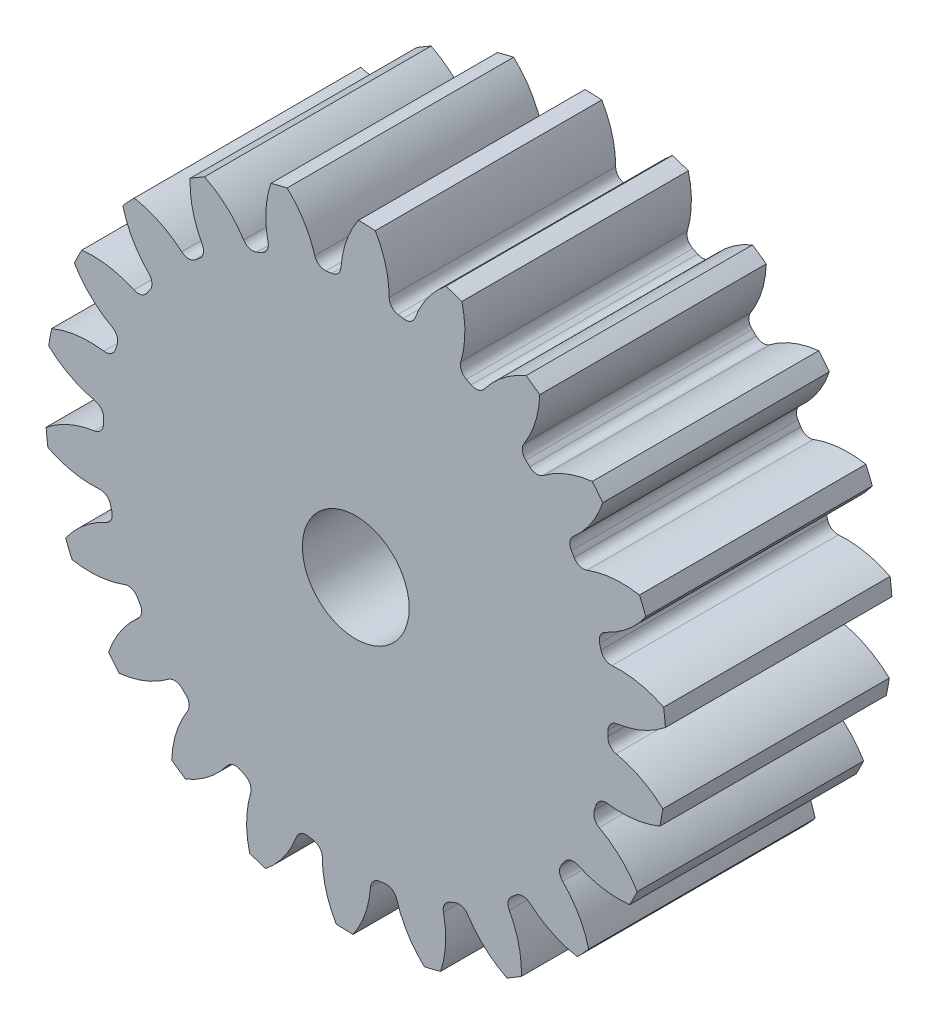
ISO-10303-21;
HEADER;
FILE_DESCRIPTION(('STEP AP214'),'2;1');
FILE_NAME('part.step','',(''),(''),'','','');
FILE_SCHEMA(('AUTOMOTIVE_DESIGN { 1 0 10303 214 1 1 1 1 }'));
ENDSEC;
DATA;
#1=APPLICATION_CONTEXT('core data for automotive mechanical design processes');
#2=APPLICATION_PROTOCOL_DEFINITION('international standard','automotive_design',2000,#1);
#3=PRODUCT_CONTEXT('',#1,'mechanical');
#4=PRODUCT('Part','Part','',(#3));
#5=PRODUCT_RELATED_PRODUCT_CATEGORY('part','',(#4));
#6=PRODUCT_DEFINITION_FORMATION('','',#4);
#7=PRODUCT_DEFINITION_CONTEXT('part definition',#1,'design');
#8=PRODUCT_DEFINITION('design','',#6,#7);
#9=PRODUCT_DEFINITION_SHAPE('','',#8);
#10=(LENGTH_UNIT() NAMED_UNIT(*) SI_UNIT(.MILLI.,.METRE.));
#11=(NAMED_UNIT(*) PLANE_ANGLE_UNIT() SI_UNIT($,.RADIAN.));
#12=(NAMED_UNIT(*) SI_UNIT($,.STERADIAN.) SOLID_ANGLE_UNIT());
#13=UNCERTAINTY_MEASURE_WITH_UNIT(LENGTH_MEASURE(1.E-05),#10,'distance_accuracy_value','');
#14=(GEOMETRIC_REPRESENTATION_CONTEXT(3) GLOBAL_UNCERTAINTY_ASSIGNED_CONTEXT((#13)) GLOBAL_UNIT_ASSIGNED_CONTEXT((#10,
#11,#12)) REPRESENTATION_CONTEXT('',''));
#15=CARTESIAN_POINT('',(0.,0.,0.));
#16=DIRECTION('',(0.,0.,1.));
#17=DIRECTION('',(1.,0.,0.));
#18=AXIS2_PLACEMENT_3D('',#15,#16,#17);
#19=CARTESIAN_POINT('',(0.,0.,88.9));
#20=DIRECTION('',(0.,0.,-1.));
#21=DIRECTION('',(-1.,0.,0.));
#22=AXIS2_PLACEMENT_3D('',#19,#20,#21);
#23=CYLINDRICAL_SURFACE('',#22,121.92);
#24=DIRECTION('',(0.,0.,-1.));
#25=VECTOR('',#24,1.);
#26=CARTESIAN_POINT('',(120.827076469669,16.2881549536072,44.45));
#27=LINE('',#26,#25);
#28=CARTESIAN_POINT('',(120.827076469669,16.2881549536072,88.9));
#29=VERTEX_POINT('',#28);
#30=CARTESIAN_POINT('',(120.827076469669,16.2881549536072,0.));
#31=VERTEX_POINT('',#30);
#32=EDGE_CURVE('E887',#29,#31,#27,.T.);
#33=ORIENTED_EDGE('',*,*,#32,.F.);
#34=CARTESIAN_POINT('',(0.,0.,88.9));
#35=DIRECTION('',(0.,0.,1.));
#36=DIRECTION('',(1.,0.,0.));
#37=AXIS2_PLACEMENT_3D('',#34,#35,#36);
#38=CIRCLE('',#37,121.92);
#39=CARTESIAN_POINT('',(121.531124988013,9.72995679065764,88.9));
#40=VERTEX_POINT('',#39);
#41=EDGE_CURVE('E1684',#40,#29,#38,.T.);
#42=ORIENTED_EDGE('',*,*,#41,.F.);
#43=DIRECTION('',(0.,0.,-1.));
#44=VECTOR('',#43,1.);
#45=CARTESIAN_POINT('',(121.531124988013,9.72995679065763,44.45));
#46=LINE('',#45,#44);
#47=CARTESIAN_POINT('',(121.531124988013,9.72995679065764,0.));
#48=VERTEX_POINT('',#47);
#49=EDGE_CURVE('E1678',#48,#40,#46,.F.);
#50=ORIENTED_EDGE('',*,*,#49,.F.);
#51=CARTESIAN_POINT('',(0.,0.,0.));
#52=DIRECTION('',(0.,0.,1.));
#53=DIRECTION('',(1.,0.,0.));
#54=AXIS2_PLACEMENT_3D('',#51,#52,#53);
#55=CIRCLE('',#54,121.92);
#56=EDGE_CURVE('E1689',#48,#31,#55,.T.);
#57=ORIENTED_EDGE('',*,*,#56,.T.);
#58=EDGE_LOOP('',(#33,#42,#50,#57));
#59=FACE_BOUND('',#58,.T.);
#60=ADVANCED_FACE('F32',(#59),#23,.T.);
#61=DIRECTION('',(0.,0.,-1.));
#62=VECTOR('',#61,1.);
#63=CARTESIAN_POINT('',(113.867014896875,43.5750997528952,44.45));
#64=LINE('',#63,#62);
#65=CARTESIAN_POINT('',(113.867014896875,43.5750997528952,0.));
#66=VERTEX_POINT('',#65);
#67=CARTESIAN_POINT('',(113.867014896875,43.5750997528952,88.9));
#68=VERTEX_POINT('',#67);
#69=EDGE_CURVE('E858',#66,#68,#64,.F.);
#70=ORIENTED_EDGE('',*,*,#69,.F.);
#71=CARTESIAN_POINT('',(111.34382735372,49.6692914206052,0.));
#72=VERTEX_POINT('',#71);
#73=EDGE_CURVE('E1692',#66,#72,#55,.T.);
#74=ORIENTED_EDGE('',*,*,#73,.T.);
#75=DIRECTION('',(0.,0.,-1.));
#76=VECTOR('',#75,1.);
#77=CARTESIAN_POINT('',(111.34382735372,49.6692914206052,44.45));
#78=LINE('',#77,#76);
#79=CARTESIAN_POINT('',(111.34382735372,49.6692914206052,88.9));
#80=VERTEX_POINT('',#79);
#81=EDGE_CURVE('E920',#80,#72,#78,.T.);
#82=ORIENTED_EDGE('',*,*,#81,.F.);
#83=EDGE_CURVE('E1687',#68,#80,#38,.T.);
#84=ORIENTED_EDGE('',*,*,#83,.F.);
#85=EDGE_LOOP('',(#70,#74,#82,#84));
#86=FACE_BOUND('',#85,.T.);
#87=ADVANCED_FACE('F1940',(#86),#23,.T.);
#88=CARTESIAN_POINT('',(0.,0.,88.9));
#89=DIRECTION('',(0.,0.,1.));
#90=DIRECTION('',(1.,0.,0.));
#91=AXIS2_PLACEMENT_3D('',#88,#89,#90);
#92=PLANE('',#91);
#93=CARTESIAN_POINT('',(0.,0.,88.9000000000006));
#94=DIRECTION('',(0.,0.,1.));
#95=DIRECTION('',(1.,0.,0.));
#96=AXIS2_PLACEMENT_3D('',#93,#94,#95);
#97=CIRCLE('',#96,20.955);
#98=CARTESIAN_POINT('',(20.955,0.,88.9000000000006));
#99=VERTEX_POINT('',#98);
#100=EDGE_CURVE('E875',#99,#99,#97,.T.);
#101=ORIENTED_EDGE('',*,*,#100,.F.);
#102=EDGE_LOOP('',(#101));
#103=FACE_BOUND('',#102,.T.);
#104=ORIENTED_EDGE('',*,*,#41,.T.);
#105=CARTESIAN_POINT('',(103.345605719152,-18.6787610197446,88.9));
#106=DIRECTION('',(0.,0.,-1.));
#107=DIRECTION('',(0.959492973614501,0.281732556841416,0.));
#108=AXIS2_PLACEMENT_3D('',#105,#106,#107);
#109=CIRCLE('',#108,39.0933118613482);
#110=CARTESIAN_POINT('',(100.554631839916,20.3147961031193,88.9));
#111=VERTEX_POINT('',#110);
#112=EDGE_CURVE('E867',#111,#29,#109,.T.);
#113=ORIENTED_EDGE('',*,*,#112,.F.);
#114=CARTESIAN_POINT('',(100.259414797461,24.439364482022,88.9));
#115=DIRECTION('',(0.,0.,1.));
#116=DIRECTION('',(-0.959492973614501,-0.281732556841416,0.));
#117=AXIS2_PLACEMENT_3D('',#114,#115,#116);
#118=CIRCLE('',#117,4.13512000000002);
#119=CARTESIAN_POINT('',(96.2419311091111,23.460057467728,88.9));
#120=VERTEX_POINT('',#119);
#121=EDGE_CURVE('E865',#120,#111,#118,.T.);
#122=ORIENTED_EDGE('',*,*,#121,.F.);
#123=CARTESIAN_POINT('',(0.,0.,88.9));
#124=DIRECTION('',(0.,0.,-1.));
#125=DIRECTION('',(0.959492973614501,0.281732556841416,0.));
#126=AXIS2_PLACEMENT_3D('',#123,#124,#125);
#127=CIRCLE('',#126,99.06);
#128=CARTESIAN_POINT('',(95.7206596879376,25.5037038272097,88.9));
#129=VERTEX_POINT('',#128);
#130=EDGE_CURVE('E850',#129,#120,#127,.T.);
#131=ORIENTED_EDGE('',*,*,#130,.F.);
#132=CARTESIAN_POINT('',(99.7163836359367,26.5683199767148,88.9));
#133=DIRECTION('',(0.,0.,1.));
#134=DIRECTION('',(-0.959492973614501,-0.281732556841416,0.));
#135=AXIS2_PLACEMENT_3D('',#132,#133,#134);
#136=CIRCLE('',#135,4.13512000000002);
#137=CARTESIAN_POINT('',(97.9999632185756,30.3303830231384,88.9));
#138=VERTEX_POINT('',#137);
#139=EDGE_CURVE('E842',#138,#129,#136,.T.);
#140=ORIENTED_EDGE('',*,*,#139,.F.);
#141=CARTESIAN_POINT('',(81.7729713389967,65.8968246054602,88.9));
#142=DIRECTION('',(0.,0.,-1.));
#143=DIRECTION('',(-0.959492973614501,-0.281732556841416,0.));
#144=AXIS2_PLACEMENT_3D('',#141,#142,#143);
#145=CIRCLE('',#144,39.0933118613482);
#146=EDGE_CURVE('E872',#68,#138,#145,.T.);
#147=ORIENTED_EDGE('',*,*,#146,.F.);
#148=ORIENTED_EDGE('',*,*,#83,.T.);
#149=CARTESIAN_POINT('',(104.421797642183,11.1936817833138,88.9));
#150=DIRECTION('',(0.,0.,-1.));
#151=DIRECTION('',(0.841253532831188,0.540640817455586,0.));
#152=AXIS2_PLACEMENT_3D('',#149,#150,#151);
#153=CIRCLE('',#152,39.0933118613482);
#154=CARTESIAN_POINT('',(90.7581232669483,47.8214176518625,88.9));
#155=VERTEX_POINT('',#154);
#156=EDGE_CURVE('E896',#155,#80,#153,.T.);
#157=ORIENTED_EDGE('',*,*,#156,.F.);
#158=CARTESIAN_POINT('',(89.3128393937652,51.6957397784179,88.9));
#159=DIRECTION('',(0.,0.,1.));
#160=DIRECTION('',(-0.841253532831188,-0.540640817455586,0.));
#161=AXIS2_PLACEMENT_3D('',#158,#159,#160);
#162=CIRCLE('',#161,4.13512000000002);
#163=CARTESIAN_POINT('',(85.7339946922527,49.6242456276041,88.9));
#164=VERTEX_POINT('',#163);
#165=EDGE_CURVE('E894',#164,#155,#162,.T.);
#166=ORIENTED_EDGE('',*,*,#165,.F.);
#167=CARTESIAN_POINT('',(0.,0.,88.9));
#168=DIRECTION('',(0.,0.,-1.));
#169=DIRECTION('',(0.841253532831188,0.540640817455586,0.));
#170=AXIS2_PLACEMENT_3D('',#167,#168,#169);
#171=CIRCLE('',#170,99.06);
#172=CARTESIAN_POINT('',(84.6580767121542,51.438250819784,88.9));
#173=VERTEX_POINT('',#172);
#174=EDGE_CURVE('E891',#173,#164,#171,.T.);
#175=ORIENTED_EDGE('',*,*,#174,.F.);
#176=CARTESIAN_POINT('',(88.1920087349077,53.5854680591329,88.9));
#177=DIRECTION('',(0.,0.,1.));
#178=DIRECTION('',(-0.841253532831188,-0.540640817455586,0.));
#179=AXIS2_PLACEMENT_3D('',#176,#177,#178);
#180=CIRCLE('',#179,4.13512000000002);
#181=CARTESIAN_POINT('',(85.4852197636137,56.7115696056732,88.9));
#182=VERTEX_POINT('',#181);
#183=EDGE_CURVE('E889',#182,#173,#180,.T.);
#184=ORIENTED_EDGE('',*,*,#183,.F.);
#185=CARTESIAN_POINT('',(59.8953105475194,86.2656484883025,88.9));
#186=DIRECTION('',(0.,0.,-1.));
#187=DIRECTION('',(-0.841253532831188,-0.540640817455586,0.));
#188=AXIS2_PLACEMENT_3D('',#185,#186,#187);
#189=CIRCLE('',#188,39.0933118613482);
#190=CARTESIAN_POINT('',(96.9780764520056,73.8900472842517,88.9));
#191=VERTEX_POINT('',#190);
#192=EDGE_CURVE('E899',#191,#182,#189,.T.);
#193=ORIENTED_EDGE('',*,*,#192,.F.);
#194=CARTESIAN_POINT('',(92.8401635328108,79.0265172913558,88.9));
#195=VERTEX_POINT('',#194);
#196=EDGE_CURVE('E1744',#191,#195,#38,.T.);
#197=ORIENTED_EDGE('',*,*,#196,.T.);
#198=CARTESIAN_POINT('',(97.0383565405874,40.1592790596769,88.9));
#199=DIRECTION('',(0.,0.,-1.));
#200=DIRECTION('',(0.654860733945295,0.75574957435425,0.));
#201=AXIS2_PLACEMENT_3D('',#198,#199,#200);
#202=CIRCLE('',#201,39.0933118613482);
#203=CARTESIAN_POINT('',(73.6089313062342,71.4538323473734,88.9));
#204=VERTEX_POINT('',#203);
#205=EDGE_CURVE('E931',#204,#195,#202,.T.);
#206=ORIENTED_EDGE('',*,*,#205,.F.);
#207=CARTESIAN_POINT('',(71.1306689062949,74.764033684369,88.9));
#208=DIRECTION('',(0.,0.,1.));
#209=DIRECTION('',(-0.654860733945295,-0.75574957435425,0.));
#210=AXIS2_PLACEMENT_3D('',#207,#208,#209);
#211=CIRCLE('',#210,4.13512000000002);
#212=CARTESIAN_POINT('',(68.280399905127,71.768172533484,88.9));
#213=VERTEX_POINT('',#212);
#214=EDGE_CURVE('E929',#213,#204,#211,.T.);
#215=ORIENTED_EDGE('',*,*,#214,.F.);
#216=CARTESIAN_POINT('',(0.,0.,88.9));
#217=DIRECTION('',(0.,0.,-1.));
#218=DIRECTION('',(0.654860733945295,0.75574957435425,0.));
#219=AXIS2_PLACEMENT_3D('',#216,#217,#218);
#220=CIRCLE('',#219,99.06);
#221=CARTESIAN_POINT('',(66.7369998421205,73.205576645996,88.9));
#222=VERTEX_POINT('',#221);
#223=EDGE_CURVE('E926',#222,#213,#220,.T.);
#224=ORIENTED_EDGE('',*,*,#223,.F.);
#225=CARTESIAN_POINT('',(69.522841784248,76.2614402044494,88.9));
#226=DIRECTION('',(0.,0.,1.));
#227=DIRECTION('',(-0.654860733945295,-0.75574957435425,0.));
#228=AXIS2_PLACEMENT_3D('',#225,#226,#227);
#229=CIRCLE('',#228,4.13512000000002);
#230=CARTESIAN_POINT('',(66.0449722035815,78.4983220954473,88.9));
#231=VERTEX_POINT('',#230);
#232=EDGE_CURVE('E924',#231,#222,#229,.T.);
#233=ORIENTED_EDGE('',*,*,#232,.F.);
#234=CARTESIAN_POINT('',(33.1652879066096,99.6457425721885,88.9));
#235=DIRECTION('',(0.,0.,-1.));
#236=DIRECTION('',(-0.654860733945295,-0.75574957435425,0.));
#237=AXIS2_PLACEMENT_3D('',#234,#235,#236);
#238=CIRCLE('',#237,39.0933118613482);
#239=CARTESIAN_POINT('',(72.2325510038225,98.2188626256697,88.9));
#240=VERTEX_POINT('',#239);
#241=EDGE_CURVE('E934',#240,#231,#238,.T.);
#242=ORIENTED_EDGE('',*,*,#241,.F.);
#243=CARTESIAN_POINT('',(66.8151418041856,101.981484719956,88.9));
#244=VERTEX_POINT('',#243);
#245=EDGE_CURVE('E1922',#240,#244,#38,.T.);
#246=ORIENTED_EDGE('',*,*,#245,.T.);
#247=CARTESIAN_POINT('',(81.7934449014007,65.8714103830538,88.9));
#248=DIRECTION('',(0.,0.,-1.));
#249=DIRECTION('',(0.415415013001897,0.909631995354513,0.));
#250=AXIS2_PLACEMENT_3D('',#247,#248,#249);
#251=CIRCLE('',#250,39.0933118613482);
#252=CARTESIAN_POINT('',(50.4963815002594,89.2974824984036,88.9));
#253=VERTEX_POINT('',#252);
#254=EDGE_CURVE('E969',#253,#244,#251,.T.);
#255=ORIENTED_EDGE('',*,*,#254,.F.);
#256=CARTESIAN_POINT('',(47.185914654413,91.7753902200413,88.9));
#257=DIRECTION('',(0.,0.,1.));
#258=DIRECTION('',(-0.415415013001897,-0.909631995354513,0.));
#259=AXIS2_PLACEMENT_3D('',#256,#257,#258);
#260=CIRCLE('',#259,4.13512000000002);
#261=CARTESIAN_POINT('',(45.295133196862,88.0978689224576,88.9));
#262=VERTEX_POINT('',#261);
#263=EDGE_CURVE('E967',#262,#253,#260,.T.);
#264=ORIENTED_EDGE('',*,*,#263,.F.);
#265=CARTESIAN_POINT('',(0.,0.,88.9));
#266=DIRECTION('',(0.,0.,-1.));
#267=DIRECTION('',(0.415415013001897,0.909631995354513,0.));
#268=AXIS2_PLACEMENT_3D('',#265,#266,#267);
#269=CIRCLE('',#268,99.06);
#270=CARTESIAN_POINT('',(43.4092881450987,89.0422220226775,88.9));
#271=VERTEX_POINT('',#270);
#272=EDGE_CURVE('E964',#271,#262,#269,.T.);
#273=ORIENTED_EDGE('',*,*,#272,.F.);
#274=CARTESIAN_POINT('',(45.221347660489,92.7591640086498,88.9));
#275=DIRECTION('',(0.,0.,1.));
#276=DIRECTION('',(-0.415415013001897,-0.909631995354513,0.));
#277=AXIS2_PLACEMENT_3D('',#274,#275,#276);
#278=CIRCLE('',#277,4.13512000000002);
#279=CARTESIAN_POINT('',(41.2541537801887,93.9256073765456,88.9));
#280=VERTEX_POINT('',#279);
#281=EDGE_CURVE('E962',#280,#271,#278,.T.);
#282=ORIENTED_EDGE('',*,*,#281,.F.);
#283=CARTESIAN_POINT('',(3.74841088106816,104.953131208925,88.9));
#284=DIRECTION('',(0.,0.,-1.));
#285=DIRECTION('',(-0.415415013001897,-0.909631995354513,0.));
#286=AXIS2_PLACEMENT_3D('',#283,#284,#285);
#287=CIRCLE('',#286,39.0933118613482);
#288=CARTESIAN_POINT('',(41.6351738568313,114.590569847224,88.9));
#289=VERTEX_POINT('',#288);
#290=EDGE_CURVE('E972',#289,#280,#287,.T.);
#291=ORIENTED_EDGE('',*,*,#290,.F.);
#292=CARTESIAN_POINT('',(35.3771546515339,116.674518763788,88.9));
#293=VERTEX_POINT('',#292);
#294=EDGE_CURVE('E1918',#289,#293,#38,.T.);
#295=ORIENTED_EDGE('',*,*,#294,.T.);
#296=CARTESIAN_POINT('',(59.9221148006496,86.2470317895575,88.9));
#297=DIRECTION('',(0.,0.,-1.));
#298=DIRECTION('',(0.142314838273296,0.989821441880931,0.));
#299=AXIS2_PLACEMENT_3D('',#296,#297,#298);
#300=CIRCLE('',#299,39.0933118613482);
#301=CARTESIAN_POINT('',(23.2929151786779,99.9067816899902,88.9));
#302=VERTEX_POINT('',#301);
#303=EDGE_CURVE('E1007',#302,#293,#300,.T.);
#304=ORIENTED_EDGE('',*,*,#303,.F.);
#305=CARTESIAN_POINT('',(19.4184382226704,101.351650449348,88.9));
#306=DIRECTION('',(0.,0.,1.));
#307=DIRECTION('',(-0.142314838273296,-0.989821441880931,0.));
#308=AXIS2_PLACEMENT_3D('',#305,#306,#307);
#309=CIRCLE('',#308,4.13512000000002);
#310=CARTESIAN_POINT('',(18.6403241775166,97.2903999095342,88.9));
#311=VERTEX_POINT('',#310);
#312=EDGE_CURVE('E1005',#311,#302,#309,.T.);
#313=ORIENTED_EDGE('',*,*,#312,.F.);
#314=CARTESIAN_POINT('',(0.,0.,88.9));
#315=DIRECTION('',(0.,0.,-1.));
#316=DIRECTION('',(0.142314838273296,0.989821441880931,0.));
#317=AXIS2_PLACEMENT_3D('',#314,#315,#316);
#318=CIRCLE('',#317,99.06);
#319=CARTESIAN_POINT('',(16.564814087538,97.6651961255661,88.9));
#320=VERTEX_POINT('',#319);
#321=EDGE_CURVE('E1002',#320,#311,#318,.T.);
#322=ORIENTED_EDGE('',*,*,#321,.F.);
#323=CARTESIAN_POINT('',(17.256288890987,101.742092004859,88.9));
#324=DIRECTION('',(0.,0.,1.));
#325=DIRECTION('',(-0.142314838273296,-0.989821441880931,0.));
#326=AXIS2_PLACEMENT_3D('',#323,#324,#325);
#327=CIRCLE('',#326,4.13512000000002);
#328=CARTESIAN_POINT('',(13.1211691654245,101.743598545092,88.9));
#329=VERTEX_POINT('',#328);
#330=EDGE_CURVE('E1000',#329,#320,#327,.T.);
#331=ORIENTED_EDGE('',*,*,#330,.F.);
#332=CARTESIAN_POINT('',(-25.9721401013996,101.75784133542,88.9));
#333=DIRECTION('',(0.,0.,-1.));
#334=DIRECTION('',(-0.142314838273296,-0.989821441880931,0.));
#335=AXIS2_PLACEMENT_3D('',#332,#333,#334);
#336=CIRCLE('',#335,39.0933118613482);
#337=CARTESIAN_POINT('',(7.66476253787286,121.678830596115,88.9));
#338=VERTEX_POINT('',#337);
#339=EDGE_CURVE('E1010',#338,#329,#336,.T.);
#340=ORIENTED_EDGE('',*,*,#339,.F.);
#341=CARTESIAN_POINT('',(1.0731208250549,121.915277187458,88.9));
#342=VERTEX_POINT('',#341);
#343=EDGE_CURVE('E1914',#338,#342,#38,.T.);
#344=ORIENTED_EDGE('',*,*,#343,.T.);
#345=CARTESIAN_POINT('',(33.1962513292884,99.6354316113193,88.9));
#346=DIRECTION('',(0.,0.,-1.));
#347=DIRECTION('',(-0.142314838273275,0.989821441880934,0.));
#348=AXIS2_PLACEMENT_3D('',#345,#346,#347);
#349=CIRCLE('',#348,39.0933118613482);
#350=CARTESIAN_POINT('',(-5.79760460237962,102.422227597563,88.9));
#351=VERTEX_POINT('',#350);
#352=EDGE_CURVE('E1045',#351,#342,#349,.T.);
#353=ORIENTED_EDGE('',*,*,#352,.F.);
#354=CARTESIAN_POINT('',(-9.92220458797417,102.717002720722,88.9));
#355=DIRECTION('',(0.,0.,1.));
#356=DIRECTION('',(0.142314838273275,-0.989821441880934,0.));
#357=AXIS2_PLACEMENT_3D('',#354,#355,#356);
#358=CIRCLE('',#357,4.13512000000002);
#359=CARTESIAN_POINT('',(-9.52461304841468,98.6010413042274,88.9));
#360=VERTEX_POINT('',#359);
#361=EDGE_CURVE('E1043',#360,#351,#358,.T.);
#362=ORIENTED_EDGE('',*,*,#361,.F.);
#363=CARTESIAN_POINT('',(0.,0.,88.9));
#364=DIRECTION('',(0.,0.,-1.));
#365=DIRECTION('',(-0.142314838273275,0.989821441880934,0.));
#366=AXIS2_PLACEMENT_3D('',#363,#364,#365);
#367=CIRCLE('',#366,99.06);
#368=CARTESIAN_POINT('',(-11.6216426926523,98.3759168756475,88.9));
#369=VERTEX_POINT('',#368);
#370=EDGE_CURVE('E1040',#369,#360,#367,.T.);
#371=ORIENTED_EDGE('',*,*,#370,.F.);
#372=CARTESIAN_POINT('',(-12.106771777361,102.482480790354,88.9));
#373=DIRECTION('',(0.,0.,1.));
#374=DIRECTION('',(0.142314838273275,-0.989821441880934,0.));
#375=AXIS2_PLACEMENT_3D('',#372,#373,#374);
#376=CIRCLE('',#375,4.13512000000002);
#377=CARTESIAN_POINT('',(-16.0748145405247,101.318928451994,88.9));
#378=VERTEX_POINT('',#377);
#379=EDGE_CURVE('E1038',#378,#369,#376,.T.);
#380=ORIENTED_EDGE('',*,*,#379,.F.);
#381=CARTESIAN_POINT('',(-53.5885827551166,90.3187363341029,88.9));
#382=DIRECTION('',(0.,0.,-1.));
#383=DIRECTION('',(0.142314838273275,-0.989821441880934,0.));
#384=AXIS2_PLACEMENT_3D('',#381,#382,#383);
#385=CIRCLE('',#384,39.0933118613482);
#386=CARTESIAN_POINT('',(-26.9266022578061,118.909396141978,88.9));
#387=VERTEX_POINT('',#386);
#388=EDGE_CURVE('E1048',#387,#378,#385,.T.);
#389=ORIENTED_EDGE('',*,*,#388,.F.);
#390=CARTESIAN_POINT('',(-33.3178508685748,117.279184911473,88.9));
#391=VERTEX_POINT('',#390);
#392=EDGE_CURVE('E1910',#387,#391,#38,.T.);
#393=ORIENTED_EDGE('',*,*,#392,.T.);
#394=CARTESIAN_POINT('',(3.7810250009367,104.95196131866,88.9));
#395=DIRECTION('',(0.,0.,-1.));
#396=DIRECTION('',(-0.415415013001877,0.909631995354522,0.));
#397=AXIS2_PLACEMENT_3D('',#394,#395,#396);
#398=CIRCLE('',#397,39.0933118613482);
#399=CARTESIAN_POINT('',(-34.4184369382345,96.6400337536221,88.9));
#400=VERTEX_POINT('',#399);
#401=EDGE_CURVE('E1083',#400,#391,#398,.T.);
#402=ORIENTED_EDGE('',*,*,#401,.F.);
#403=CARTESIAN_POINT('',(-38.4590093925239,95.7608343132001,88.9));
#404=DIRECTION('',(0.,0.,1.));
#405=DIRECTION('',(0.415415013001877,-0.909631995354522,0.));
#406=AXIS2_PLACEMENT_3D('',#403,#404,#405);
#407=CIRCLE('',#406,4.13512000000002);
#408=CARTESIAN_POINT('',(-36.9179227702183,91.9236127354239,88.9));
#409=VERTEX_POINT('',#408);
#410=EDGE_CURVE('E1081',#409,#400,#407,.T.);
#411=ORIENTED_EDGE('',*,*,#410,.F.);
#412=CARTESIAN_POINT('',(0.,0.,88.9));
#413=DIRECTION('',(0.,0.,-1.));
#414=DIRECTION('',(-0.415415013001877,0.909631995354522,0.));
#415=AXIS2_PLACEMENT_3D('',#412,#413,#414);
#416=CIRCLE('',#415,99.06);
#417=CARTESIAN_POINT('',(-38.8665830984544,91.1168059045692,88.9));
#418=VERTEX_POINT('',#417);
#419=EDGE_CURVE('E1078',#418,#409,#416,.T.);
#420=ORIENTED_EDGE('',*,*,#419,.F.);
#421=CARTESIAN_POINT('',(-40.4890137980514,94.9203484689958,88.9));
#422=DIRECTION('',(0.,0.,1.));
#423=DIRECTION('',(0.415415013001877,-0.909631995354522,0.));
#424=AXIS2_PLACEMENT_3D('',#421,#422,#423);
#425=CIRCLE('',#424,4.13512000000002);
#426=CARTESIAN_POINT('',(-43.9685123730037,92.6860013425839,88.9));
#427=VERTEX_POINT('',#426);
#428=EDGE_CURVE('E1076',#427,#418,#425,.T.);
#429=ORIENTED_EDGE('',*,*,#428,.F.);
#430=CARTESIAN_POINT('',(-76.8635971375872,71.5625444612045,88.9));
#431=DIRECTION('',(0.,0.,-1.));
#432=DIRECTION('',(0.415415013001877,-0.909631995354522,0.));
#433=AXIS2_PLACEMENT_3D('',#430,#431,#432);
#434=CIRCLE('',#433,39.0933118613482);
#435=CARTESIAN_POINT('',(-59.3365338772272,106.506629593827,88.9));
#436=VERTEX_POINT('',#435);
#437=EDGE_CURVE('E1086',#436,#427,#434,.T.);
#438=ORIENTED_EDGE('',*,*,#437,.F.);
#439=CARTESIAN_POINT('',(-65.0096084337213,103.141830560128,88.9));
#440=VERTEX_POINT('',#439);
#441=EDGE_CURVE('E1906',#436,#440,#38,.T.);
#442=ORIENTED_EDGE('',*,*,#441,.T.);
#443=CARTESIAN_POINT('',(-25.9405174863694,101.76590729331,88.9));
#444=DIRECTION('',(0.,0.,-1.));
#445=DIRECTION('',(-0.654860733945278,0.755749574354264,0.));
#446=AXIS2_PLACEMENT_3D('',#443,#444,#445);
#447=CIRCLE('',#446,39.0933118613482);
#448=CARTESIAN_POINT('',(-60.2508922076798,83.0286391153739,88.9));
#449=VERTEX_POINT('',#448);
#450=EDGE_CURVE('E1121',#449,#440,#447,.T.);
#451=ORIENTED_EDGE('',*,*,#450,.F.);
#452=CARTESIAN_POINT('',(-63.8800939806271,81.0466926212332,88.9));
#453=DIRECTION('',(0.,0.,1.));
#454=DIRECTION('',(0.654860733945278,-0.755749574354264,0.));
#455=AXIS2_PLACEMENT_3D('',#452,#453,#454);
#456=CIRCLE('',#455,4.13512000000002);
#457=CARTESIAN_POINT('',(-61.3203619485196,77.7990797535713,88.9));
#458=VERTEX_POINT('',#457);
#459=EDGE_CURVE('E1119',#458,#449,#456,.T.);
#460=ORIENTED_EDGE('',*,*,#459,.F.);
#461=CARTESIAN_POINT('',(0.,0.,88.9));
#462=DIRECTION('',(0.,0.,-1.));
#463=DIRECTION('',(-0.654860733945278,0.755749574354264,0.));
#464=AXIS2_PLACEMENT_3D('',#461,#462,#463);
#465=CIRCLE('',#464,99.06);
#466=CARTESIAN_POINT('',(-62.9627840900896,76.4759532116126,88.9));
#467=VERTEX_POINT('',#466);
#468=EDGE_CURVE('E1116',#467,#458,#465,.T.);
#469=ORIENTED_EDGE('',*,*,#468,.F.);
#470=CARTESIAN_POINT('',(-65.5910767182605,79.6683340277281,88.9));
#471=DIRECTION('',(0.,0.,1.));
#472=DIRECTION('',(0.654860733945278,-0.755749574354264,0.));
#473=AXIS2_PLACEMENT_3D('',#470,#471,#472);
#474=CIRCLE('',#473,4.13512000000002);
#475=CARTESIAN_POINT('',(-68.3001428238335,76.5442056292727,88.9));
#476=VERTEX_POINT('',#475);
#477=EDGE_CURVE('E1114',#476,#467,#474,.T.);
#478=ORIENTED_EDGE('',*,*,#477,.F.);
#479=CARTESIAN_POINT('',(-93.911580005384,47.0087808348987,88.9));
#480=DIRECTION('',(0.,0.,-1.));
#481=DIRECTION('',(0.654860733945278,-0.755749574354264,0.));
#482=AXIS2_PLACEMENT_3D('',#479,#480,#481);
#483=CIRCLE('',#482,39.0933118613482);
#484=CARTESIAN_POINT('',(-86.9393724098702,85.4753293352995,88.9));
#485=VERTEX_POINT('',#484);
#486=EDGE_CURVE('E1124',#485,#476,#483,.T.);
#487=ORIENTED_EDGE('',*,*,#486,.F.);
#488=CARTESIAN_POINT('',(-91.4346741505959,80.6485385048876,88.9));
#489=VERTEX_POINT('',#488);
#490=EDGE_CURVE('E1902',#485,#489,#38,.T.);
#491=ORIENTED_EDGE('',*,*,#490,.T.);
#492=CARTESIAN_POINT('',(-53.5605135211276,90.3353846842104,88.9));
#493=DIRECTION('',(0.,0.,-1.));
#494=DIRECTION('',(-0.841253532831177,0.540640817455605,0.));
#495=AXIS2_PLACEMENT_3D('',#492,#493,#494);
#496=CIRCLE('',#495,39.0933118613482);
#497=CARTESIAN_POINT('',(-81.2021785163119,62.690757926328,88.9));
#498=VERTEX_POINT('',#497);
#499=EDGE_CURVE('E1159',#498,#489,#496,.T.);
#500=ORIENTED_EDGE('',*,*,#499,.F.);
#501=CARTESIAN_POINT('',(-84.1259932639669,59.7666298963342,88.9));
#502=DIRECTION('',(0.,0.,1.));
#503=DIRECTION('',(0.841253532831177,-0.540640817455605,0.));
#504=AXIS2_PLACEMENT_3D('',#501,#502,#503);
#505=CIRCLE('',#504,4.13512000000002);
#506=CARTESIAN_POINT('',(-80.7549900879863,57.3717280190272,88.9));
#507=VERTEX_POINT('',#506);
#508=EDGE_CURVE('E1157',#507,#498,#505,.T.);
#509=ORIENTED_EDGE('',*,*,#508,.F.);
#510=CARTESIAN_POINT('',(0.,0.,88.9));
#511=DIRECTION('',(0.,0.,-1.));
#512=DIRECTION('',(-0.841253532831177,0.540640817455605,0.));
#513=AXIS2_PLACEMENT_3D('',#510,#511,#512);
#514=CIRCLE('',#513,99.06);
#515=CARTESIAN_POINT('',(-81.9581147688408,55.6394736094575,88.9));
#516=VERTEX_POINT('',#515);
#517=EDGE_CURVE('E1154',#516,#507,#514,.T.);
#518=ORIENTED_EDGE('',*,*,#517,.F.);
#519=CARTESIAN_POINT('',(-85.3793406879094,57.9620649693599,88.9));
#520=DIRECTION('',(0.,0.,1.));
#521=DIRECTION('',(0.841253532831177,-0.540640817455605,0.));
#522=AXIS2_PLACEMENT_3D('',#519,#520,#521);
#523=CIRCLE('',#522,4.13512000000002);
#524=CARTESIAN_POINT('',(-87.0985018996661,54.2012536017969,88.9));
#525=VERTEX_POINT('',#524);
#526=EDGE_CURVE('E1152',#525,#516,#523,.T.);
#527=ORIENTED_EDGE('',*,*,#526,.F.);
#528=CARTESIAN_POINT('',(-103.351405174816,18.6466453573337,88.9));
#529=DIRECTION('',(0.,0.,-1.));
#530=DIRECTION('',(0.841253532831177,-0.540640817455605,0.));
#531=AXIS2_PLACEMENT_3D('',#528,#529,#530);
#532=CIRCLE('',#531,39.0933118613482);
#533=CARTESIAN_POINT('',(-107.498900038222,57.5193262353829,88.9));
#534=VERTEX_POINT('',#533);
#535=EDGE_CURVE('E1162',#534,#525,#532,.T.);
#536=ORIENTED_EDGE('',*,*,#535,.F.);
#537=CARTESIAN_POINT('',(-110.452246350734,51.6215814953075,88.9));
#538=VERTEX_POINT('',#537);
#539=EDGE_CURVE('E1898',#534,#538,#38,.T.);
#540=ORIENTED_EDGE('',*,*,#539,.T.);
#541=CARTESIAN_POINT('',(-76.841355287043,71.5864264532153,88.9));
#542=DIRECTION('',(0.,0.,-1.));
#543=DIRECTION('',(-0.959492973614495,0.281732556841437,0.));
#544=AXIS2_PLACEMENT_3D('',#541,#542,#543);
#545=CIRCLE('',#544,39.0933118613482);
#546=CARTESIAN_POINT('',(-95.5749472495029,37.2740443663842,88.9));
#547=VERTEX_POINT('',#546);
#548=EDGE_CURVE('E1197',#547,#538,#545,.T.);
#549=ORIENTED_EDGE('',*,*,#548,.F.);
#550=CARTESIAN_POINT('',(-97.5565048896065,33.6446302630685,88.9));
#551=DIRECTION('',(0.,0.,1.));
#552=DIRECTION('',(0.959492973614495,-0.281732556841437,0.));
#553=AXIS2_PLACEMENT_3D('',#550,#551,#552);
#554=CIRCLE('',#553,4.13512000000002);
#555=CARTESIAN_POINT('',(-93.6473291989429,32.2964600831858,88.9));
#556=VERTEX_POINT('',#555);
#557=EDGE_CURVE('E1195',#556,#547,#554,.T.);
#558=ORIENTED_EDGE('',*,*,#557,.F.);
#559=CARTESIAN_POINT('',(0.,0.,88.9));
#560=DIRECTION('',(0.,0.,-1.));
#561=DIRECTION('',(-0.959492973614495,0.281732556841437,0.));
#562=AXIS2_PLACEMENT_3D('',#559,#560,#561);
#563=CIRCLE('',#562,99.06);
#564=CARTESIAN_POINT('',(-94.3136864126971,30.2954147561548,88.9));
#565=VERTEX_POINT('',#564);
#566=EDGE_CURVE('E1192',#565,#556,#563,.T.);
#567=ORIENTED_EDGE('',*,*,#566,.F.);
#568=CARTESIAN_POINT('',(-98.2506782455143,31.5600541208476,88.9));
#569=DIRECTION('',(0.,0.,1.));
#570=DIRECTION('',(0.959492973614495,-0.281732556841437,0.));
#571=AXIS2_PLACEMENT_3D('',#568,#569,#570);
#572=CIRCLE('',#571,4.13512000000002);
#573=CARTESIAN_POINT('',(-98.8406583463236,27.4672383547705,88.9));
#574=VERTEX_POINT('',#573);
#575=EDGE_CURVE('E1190',#574,#565,#572,.T.);
#576=ORIENTED_EDGE('',*,*,#575,.F.);
#577=CARTESIAN_POINT('',(-104.418314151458,-11.2261304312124,88.9));
#578=DIRECTION('',(0.,0.,-1.));
#579=DIRECTION('',(0.959492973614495,-0.281732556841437,0.));
#580=AXIS2_PLACEMENT_3D('',#577,#578,#579);
#581=CIRCLE('',#580,39.0933118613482);
#582=CARTESIAN_POINT('',(-119.349506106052,24.9034494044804,88.9));
#583=VERTEX_POINT('',#582);
#584=EDGE_CURVE('E1200',#583,#574,#581,.T.);
#585=ORIENTED_EDGE('',*,*,#584,.F.);
#586=CARTESIAN_POINT('',(-120.521634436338,18.4125509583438,88.9));
#587=VERTEX_POINT('',#586);
#588=EDGE_CURVE('E1894',#583,#587,#38,.T.);
#589=ORIENTED_EDGE('',*,*,#588,.T.);
#590=CARTESIAN_POINT('',(-93.8969674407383,47.0379616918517,88.9));
#591=DIRECTION('',(0.,0.,-1.));
#592=DIRECTION('',(-1.,0.,0.));
#593=AXIS2_PLACEMENT_3D('',#590,#591,#592);
#594=CIRCLE('',#593,39.0933118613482);
#595=CARTESIAN_POINT('',(-102.204802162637,8.83760940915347,88.9));
#596=VERTEX_POINT('',#595);
#597=EDGE_CURVE('E1235',#596,#587,#594,.T.);
#598=ORIENTED_EDGE('',*,*,#597,.F.);
#599=CARTESIAN_POINT('',(-103.083568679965,4.7969427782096,88.9));
#600=DIRECTION('',(0.,0.,1.));
#601=DIRECTION('',(1.,0.,0.));
#602=AXIS2_PLACEMENT_3D('',#599,#600,#601);
#603=CIRCLE('',#602,4.13512000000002);
#604=CARTESIAN_POINT('',(-98.9529186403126,4.60472502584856,88.9));
#605=VERTEX_POINT('',#604);
#606=EDGE_CURVE('E1233',#605,#596,#603,.T.);
#607=ORIENTED_EDGE('',*,*,#606,.F.);
#608=CARTESIAN_POINT('',(0.,0.,88.9));
#609=DIRECTION('',(0.,0.,-1.));
#610=DIRECTION('',(-1.,0.,0.));
#611=AXIS2_PLACEMENT_3D('',#608,#609,#610);
#612=CIRCLE('',#611,99.06);
#613=CARTESIAN_POINT('',(-99.028524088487,2.49700157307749,88.9));
#614=VERTEX_POINT('',#613);
#615=EDGE_CURVE('E1230',#614,#605,#612,.T.);
#616=ORIENTED_EDGE('',*,*,#615,.F.);
#617=CARTESIAN_POINT('',(-103.16233017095,2.6012353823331,88.9));
#618=DIRECTION('',(0.,0.,1.));
#619=DIRECTION('',(1.,0.,0.));
#620=AXIS2_PLACEMENT_3D('',#617,#618,#619);
#621=CIRCLE('',#620,4.13512000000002);
#622=CARTESIAN_POINT('',(-102.575332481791,-1.49200918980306,88.9));
#623=VERTEX_POINT('',#622);
#624=EDGE_CURVE('E1228',#623,#614,#621,.T.);
#625=ORIENTED_EDGE('',*,*,#624,.F.);
#626=CARTESIAN_POINT('',(-97.0258723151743,-40.1894318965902,88.9));
#627=DIRECTION('',(0.,0.,-1.));
#628=DIRECTION('',(1.,0.,0.));
#629=AXIS2_PLACEMENT_3D('',#626,#627,#628);
#630=CIRCLE('',#629,39.0933118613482);
#631=CARTESIAN_POINT('',(-121.531124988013,-9.72995679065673,88.9));
#632=VERTEX_POINT('',#631);
#633=EDGE_CURVE('E1238',#632,#623,#630,.T.);
#634=ORIENTED_EDGE('',*,*,#633,.F.);
#635=CARTESIAN_POINT('',(-120.827076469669,-16.2881549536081,88.9));
#636=VERTEX_POINT('',#635);
#637=EDGE_CURVE('E1890',#632,#636,#38,.T.);
#638=ORIENTED_EDGE('',*,*,#637,.T.);
#639=CARTESIAN_POINT('',(-103.345605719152,18.6787610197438,88.9));
#640=DIRECTION('',(0.,0.,-1.));
#641=DIRECTION('',(-0.959492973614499,-0.281732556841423,0.));
#642=AXIS2_PLACEMENT_3D('',#639,#640,#641);
#643=CIRCLE('',#642,39.0933118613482);
#644=CARTESIAN_POINT('',(-100.554631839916,-20.31479610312,88.9));
#645=VERTEX_POINT('',#644);
#646=EDGE_CURVE('E1273',#645,#636,#643,.T.);
#647=ORIENTED_EDGE('',*,*,#646,.F.);
#648=CARTESIAN_POINT('',(-100.259414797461,-24.4393644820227,88.9));
#649=DIRECTION('',(0.,0.,1.));
#650=DIRECTION('',(0.959492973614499,0.281732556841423,0.));
#651=AXIS2_PLACEMENT_3D('',#648,#649,#650);
#652=CIRCLE('',#651,4.13512000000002);
#653=CARTESIAN_POINT('',(-96.241931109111,-23.4600574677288,88.9));
#654=VERTEX_POINT('',#653);
#655=EDGE_CURVE('E1271',#654,#645,#652,.T.);
#656=ORIENTED_EDGE('',*,*,#655,.F.);
#657=CARTESIAN_POINT('',(0.,0.,88.9));
#658=DIRECTION('',(0.,0.,-1.));
#659=DIRECTION('',(-0.959492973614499,-0.281732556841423,0.));
#660=AXIS2_PLACEMENT_3D('',#657,#658,#659);
#661=CIRCLE('',#660,99.06);
#662=CARTESIAN_POINT('',(-95.7206596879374,-25.5037038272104,88.9));
#663=VERTEX_POINT('',#662);
#664=EDGE_CURVE('E1268',#663,#654,#661,.T.);
#665=ORIENTED_EDGE('',*,*,#664,.F.);
#666=CARTESIAN_POINT('',(-99.7163836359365,-26.5683199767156,88.9));
#667=DIRECTION('',(0.,0.,1.));
#668=DIRECTION('',(0.959492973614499,0.281732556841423,0.));
#669=AXIS2_PLACEMENT_3D('',#666,#667,#668);
#670=CIRCLE('',#669,4.13512000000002);
#671=CARTESIAN_POINT('',(-97.9999632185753,-30.3303830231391,88.9));
#672=VERTEX_POINT('',#671);
#673=EDGE_CURVE('E1266',#672,#663,#670,.T.);
#674=ORIENTED_EDGE('',*,*,#673,.F.);
#675=CARTESIAN_POINT('',(-81.7729713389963,-65.8968246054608,88.9));
#676=DIRECTION('',(0.,0.,-1.));
#677=DIRECTION('',(0.959492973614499,0.281732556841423,0.));
#678=AXIS2_PLACEMENT_3D('',#675,#676,#677);
#679=CIRCLE('',#678,39.0933118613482);
#680=CARTESIAN_POINT('',(-113.867014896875,-43.575099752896,88.9));
#681=VERTEX_POINT('',#680);
#682=EDGE_CURVE('E1276',#681,#672,#679,.T.);
#683=ORIENTED_EDGE('',*,*,#682,.F.);
#684=CARTESIAN_POINT('',(-111.34382735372,-49.669291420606,88.9));
#685=VERTEX_POINT('',#684);
#686=EDGE_CURVE('E1886',#681,#685,#38,.T.);
#687=ORIENTED_EDGE('',*,*,#686,.T.);
#688=CARTESIAN_POINT('',(-104.421797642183,-11.1936817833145,88.9));
#689=DIRECTION('',(0.,0.,-1.));
#690=DIRECTION('',(-0.841253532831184,-0.540640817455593,0.));
#691=AXIS2_PLACEMENT_3D('',#688,#689,#690);
#692=CIRCLE('',#691,39.0933118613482);
#693=CARTESIAN_POINT('',(-90.7581232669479,-47.8214176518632,88.9));
#694=VERTEX_POINT('',#693);
#695=EDGE_CURVE('E1311',#694,#685,#692,.T.);
#696=ORIENTED_EDGE('',*,*,#695,.F.);
#697=CARTESIAN_POINT('',(-89.3128393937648,-51.6957397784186,88.9));
#698=DIRECTION('',(0.,0.,1.));
#699=DIRECTION('',(0.841253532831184,0.540640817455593,0.));
#700=AXIS2_PLACEMENT_3D('',#697,#698,#699);
#701=CIRCLE('',#700,4.13512000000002);
#702=CARTESIAN_POINT('',(-85.7339946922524,-49.6242456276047,88.9));
#703=VERTEX_POINT('',#702);
#704=EDGE_CURVE('E1309',#703,#694,#701,.T.);
#705=ORIENTED_EDGE('',*,*,#704,.F.);
#706=CARTESIAN_POINT('',(0.,0.,88.9));
#707=DIRECTION('',(0.,0.,-1.));
#708=DIRECTION('',(-0.841253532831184,-0.540640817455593,0.));
#709=AXIS2_PLACEMENT_3D('',#706,#707,#708);
#710=CIRCLE('',#709,99.06);
#711=CARTESIAN_POINT('',(-84.6580767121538,-51.4382508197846,88.9));
#712=VERTEX_POINT('',#711);
#713=EDGE_CURVE('E1306',#712,#703,#710,.T.);
#714=ORIENTED_EDGE('',*,*,#713,.F.);
#715=CARTESIAN_POINT('',(-88.1920087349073,-53.5854680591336,88.9));
#716=DIRECTION('',(0.,0.,1.));
#717=DIRECTION('',(0.841253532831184,0.540640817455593,0.));
#718=AXIS2_PLACEMENT_3D('',#715,#716,#717);
#719=CIRCLE('',#718,4.13512000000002);
#720=CARTESIAN_POINT('',(-85.4852197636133,-56.7115696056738,88.9));
#721=VERTEX_POINT('',#720);
#722=EDGE_CURVE('E1304',#721,#712,#719,.T.);
#723=ORIENTED_EDGE('',*,*,#722,.F.);
#724=CARTESIAN_POINT('',(-59.8953105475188,-86.265648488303,88.9));
#725=DIRECTION('',(0.,0.,-1.));
#726=DIRECTION('',(0.841253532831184,0.540640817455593,0.));
#727=AXIS2_PLACEMENT_3D('',#724,#725,#726);
#728=CIRCLE('',#727,39.0933118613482);
#729=CARTESIAN_POINT('',(-96.9780764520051,-73.8900472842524,88.9));
#730=VERTEX_POINT('',#729);
#731=EDGE_CURVE('E1314',#730,#721,#728,.T.);
#732=ORIENTED_EDGE('',*,*,#731,.F.);
#733=CARTESIAN_POINT('',(-92.8401635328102,-79.0265172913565,88.9));
#734=VERTEX_POINT('',#733);
#735=EDGE_CURVE('E1882',#730,#734,#38,.T.);
#736=ORIENTED_EDGE('',*,*,#735,.T.);
#737=CARTESIAN_POINT('',(-97.0383565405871,-40.1592790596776,88.9));
#738=DIRECTION('',(0.,0.,-1.));
#739=DIRECTION('',(-0.654860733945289,-0.755749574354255,0.));
#740=AXIS2_PLACEMENT_3D('',#737,#738,#739);
#741=CIRCLE('',#740,39.0933118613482);
#742=CARTESIAN_POINT('',(-73.6089313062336,-71.4538323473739,88.9));
#743=VERTEX_POINT('',#742);
#744=EDGE_CURVE('E1349',#743,#734,#741,.T.);
#745=ORIENTED_EDGE('',*,*,#744,.F.);
#746=CARTESIAN_POINT('',(-71.1306689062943,-74.7640336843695,88.9));
#747=DIRECTION('',(0.,0.,1.));
#748=DIRECTION('',(0.654860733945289,0.755749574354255,0.));
#749=AXIS2_PLACEMENT_3D('',#746,#747,#748);
#750=CIRCLE('',#749,4.13512000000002);
#751=CARTESIAN_POINT('',(-68.2803999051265,-71.7681725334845,88.9));
#752=VERTEX_POINT('',#751);
#753=EDGE_CURVE('E1347',#752,#743,#750,.T.);
#754=ORIENTED_EDGE('',*,*,#753,.F.);
#755=CARTESIAN_POINT('',(0.,0.,88.9));
#756=DIRECTION('',(0.,0.,-1.));
#757=DIRECTION('',(-0.654860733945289,-0.755749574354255,0.));
#758=AXIS2_PLACEMENT_3D('',#755,#756,#757);
#759=CIRCLE('',#758,99.06);
#760=CARTESIAN_POINT('',(-66.73699984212,-73.2055766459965,88.9));
#761=VERTEX_POINT('',#760);
#762=EDGE_CURVE('E1344',#761,#752,#759,.T.);
#763=ORIENTED_EDGE('',*,*,#762,.F.);
#764=CARTESIAN_POINT('',(-69.5228417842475,-76.26144020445,88.9));
#765=DIRECTION('',(0.,0.,1.));
#766=DIRECTION('',(0.654860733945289,0.755749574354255,0.));
#767=AXIS2_PLACEMENT_3D('',#764,#765,#766);
#768=CIRCLE('',#767,4.13512000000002);
#769=CARTESIAN_POINT('',(-66.0449722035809,-78.4983220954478,88.9));
#770=VERTEX_POINT('',#769);
#771=EDGE_CURVE('E1342',#770,#761,#768,.T.);
#772=ORIENTED_EDGE('',*,*,#771,.F.);
#773=CARTESIAN_POINT('',(-33.1652879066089,-99.6457425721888,88.9));
#774=DIRECTION('',(0.,0.,-1.));
#775=DIRECTION('',(0.654860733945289,0.755749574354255,0.));
#776=AXIS2_PLACEMENT_3D('',#773,#774,#775);
#777=CIRCLE('',#776,39.0933118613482);
#778=CARTESIAN_POINT('',(-72.2325510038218,-98.2188626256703,88.9));
#779=VERTEX_POINT('',#778);
#780=EDGE_CURVE('E1352',#779,#770,#777,.T.);
#781=ORIENTED_EDGE('',*,*,#780,.F.);
#782=CARTESIAN_POINT('',(-66.8151418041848,-101.981484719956,88.9));
#783=VERTEX_POINT('',#782);
#784=EDGE_CURVE('E1878',#779,#783,#38,.T.);
#785=ORIENTED_EDGE('',*,*,#784,.T.);
#786=CARTESIAN_POINT('',(-81.7934449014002,-65.8714103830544,88.9));
#787=DIRECTION('',(0.,0.,-1.));
#788=DIRECTION('',(-0.415415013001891,-0.909631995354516,0.));
#789=AXIS2_PLACEMENT_3D('',#786,#787,#788);
#790=CIRCLE('',#789,39.0933118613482);
#791=CARTESIAN_POINT('',(-50.4963815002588,-89.297482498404,88.9));
#792=VERTEX_POINT('',#791);
#793=EDGE_CURVE('E1387',#792,#783,#790,.T.);
#794=ORIENTED_EDGE('',*,*,#793,.F.);
#795=CARTESIAN_POINT('',(-47.1859146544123,-91.7753902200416,88.9));
#796=DIRECTION('',(0.,0.,1.));
#797=DIRECTION('',(0.415415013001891,0.909631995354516,0.));
#798=AXIS2_PLACEMENT_3D('',#795,#796,#797);
#799=CIRCLE('',#798,4.13512000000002);
#800=CARTESIAN_POINT('',(-45.2951331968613,-88.097868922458,88.9));
#801=VERTEX_POINT('',#800);
#802=EDGE_CURVE('E1385',#801,#792,#799,.T.);
#803=ORIENTED_EDGE('',*,*,#802,.F.);
#804=CARTESIAN_POINT('',(0.,0.,88.9));
#805=DIRECTION('',(0.,0.,-1.));
#806=DIRECTION('',(-0.415415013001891,-0.909631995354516,0.));
#807=AXIS2_PLACEMENT_3D('',#804,#805,#806);
#808=CIRCLE('',#807,99.06);
#809=CARTESIAN_POINT('',(-43.409288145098,-89.0422220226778,88.9));
#810=VERTEX_POINT('',#809);
#811=EDGE_CURVE('E1382',#810,#801,#808,.T.);
#812=ORIENTED_EDGE('',*,*,#811,.F.);
#813=CARTESIAN_POINT('',(-45.2213476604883,-92.7591640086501,88.9));
#814=DIRECTION('',(0.,0.,1.));
#815=DIRECTION('',(0.415415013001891,0.909631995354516,0.));
#816=AXIS2_PLACEMENT_3D('',#813,#814,#815);
#817=CIRCLE('',#816,4.13512000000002);
#818=CARTESIAN_POINT('',(-41.254153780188,-93.9256073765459,88.9));
#819=VERTEX_POINT('',#818);
#820=EDGE_CURVE('E1380',#819,#810,#817,.T.);
#821=ORIENTED_EDGE('',*,*,#820,.F.);
#822=CARTESIAN_POINT('',(-3.74841088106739,-104.953131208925,88.9));
#823=DIRECTION('',(0.,0.,-1.));
#824=DIRECTION('',(0.415415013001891,0.909631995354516,0.));
#825=AXIS2_PLACEMENT_3D('',#822,#823,#824);
#826=CIRCLE('',#825,39.0933118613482);
#827=CARTESIAN_POINT('',(-41.6351738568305,-114.590569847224,88.9));
#828=VERTEX_POINT('',#827);
#829=EDGE_CURVE('E1390',#828,#819,#826,.T.);
#830=ORIENTED_EDGE('',*,*,#829,.F.);
#831=CARTESIAN_POINT('',(-35.3771546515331,-116.674518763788,88.9));
#832=VERTEX_POINT('',#831);
#833=EDGE_CURVE('E1874',#828,#832,#38,.T.);
#834=ORIENTED_EDGE('',*,*,#833,.T.);
#835=CARTESIAN_POINT('',(-59.922114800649,-86.2470317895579,88.9));
#836=DIRECTION('',(0.,0.,-1.));
#837=DIRECTION('',(-0.142314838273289,-0.989821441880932,0.));
#838=AXIS2_PLACEMENT_3D('',#835,#836,#837);
#839=CIRCLE('',#838,39.0933118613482);
#840=CARTESIAN_POINT('',(-23.2929151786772,-99.9067816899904,88.9));
#841=VERTEX_POINT('',#840);
#842=EDGE_CURVE('E1425',#841,#832,#839,.T.);
#843=ORIENTED_EDGE('',*,*,#842,.F.);
#844=CARTESIAN_POINT('',(-19.4184382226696,-101.351650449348,88.9));
#845=DIRECTION('',(0.,0.,1.));
#846=DIRECTION('',(0.142314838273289,0.989821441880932,0.));
#847=AXIS2_PLACEMENT_3D('',#844,#845,#846);
#848=CIRCLE('',#847,4.13512000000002);
#849=CARTESIAN_POINT('',(-18.6403241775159,-97.2903999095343,88.9));
#850=VERTEX_POINT('',#849);
#851=EDGE_CURVE('E1423',#850,#841,#848,.T.);
#852=ORIENTED_EDGE('',*,*,#851,.F.);
#853=CARTESIAN_POINT('',(0.,0.,88.9));
#854=DIRECTION('',(0.,0.,-1.));
#855=DIRECTION('',(-0.142314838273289,-0.989821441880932,0.));
#856=AXIS2_PLACEMENT_3D('',#853,#854,#855);
#857=CIRCLE('',#856,99.06);
#858=CARTESIAN_POINT('',(-16.5648140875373,-97.6651961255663,88.9));
#859=VERTEX_POINT('',#858);
#860=EDGE_CURVE('E1420',#859,#850,#857,.T.);
#861=ORIENTED_EDGE('',*,*,#860,.F.);
#862=CARTESIAN_POINT('',(-17.2562888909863,-101.742092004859,88.9));
#863=DIRECTION('',(0.,0.,1.));
#864=DIRECTION('',(0.142314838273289,0.989821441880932,0.));
#865=AXIS2_PLACEMENT_3D('',#862,#863,#864);
#866=CIRCLE('',#865,4.13512000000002);
#867=CARTESIAN_POINT('',(-13.1211691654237,-101.743598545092,88.9));
#868=VERTEX_POINT('',#867);
#869=EDGE_CURVE('E1418',#868,#859,#866,.T.);
#870=ORIENTED_EDGE('',*,*,#869,.F.);
#871=CARTESIAN_POINT('',(25.9721401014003,-101.757841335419,88.9));
#872=DIRECTION('',(0.,0.,-1.));
#873=DIRECTION('',(0.142314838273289,0.989821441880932,0.));
#874=AXIS2_PLACEMENT_3D('',#871,#872,#873);
#875=CIRCLE('',#874,39.0933118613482);
#876=CARTESIAN_POINT('',(-7.66476253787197,-121.678830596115,88.9));
#877=VERTEX_POINT('',#876);
#878=EDGE_CURVE('E1428',#877,#868,#875,.T.);
#879=ORIENTED_EDGE('',*,*,#878,.F.);
#880=CARTESIAN_POINT('',(-1.07312082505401,-121.915277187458,88.9));
#881=VERTEX_POINT('',#880);
#882=EDGE_CURVE('E1870',#877,#881,#38,.T.);
#883=ORIENTED_EDGE('',*,*,#882,.T.);
#884=CARTESIAN_POINT('',(-33.1962513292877,-99.6354316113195,88.9));
#885=DIRECTION('',(0.,0.,-1.));
#886=DIRECTION('',(0.142314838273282,-0.989821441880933,0.));
#887=AXIS2_PLACEMENT_3D('',#884,#885,#886);
#888=CIRCLE('',#887,39.0933118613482);
#889=CARTESIAN_POINT('',(5.79760460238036,-102.422227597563,88.9));
#890=VERTEX_POINT('',#889);
#891=EDGE_CURVE('E1463',#890,#881,#888,.T.);
#892=ORIENTED_EDGE('',*,*,#891,.F.);
#893=CARTESIAN_POINT('',(9.92220458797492,-102.717002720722,88.9));
#894=DIRECTION('',(0.,0.,1.));
#895=DIRECTION('',(-0.142314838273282,0.989821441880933,0.));
#896=AXIS2_PLACEMENT_3D('',#893,#894,#895);
#897=CIRCLE('',#896,4.13512000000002);
#898=CARTESIAN_POINT('',(9.52461304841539,-98.6010413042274,88.9));
#899=VERTEX_POINT('',#898);
#900=EDGE_CURVE('E1461',#899,#890,#897,.T.);
#901=ORIENTED_EDGE('',*,*,#900,.F.);
#902=CARTESIAN_POINT('',(0.,0.,88.9));
#903=DIRECTION('',(0.,0.,-1.));
#904=DIRECTION('',(0.142314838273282,-0.989821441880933,0.));
#905=AXIS2_PLACEMENT_3D('',#902,#903,#904);
#906=CIRCLE('',#905,99.06);
#907=CARTESIAN_POINT('',(11.621642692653,-98.3759168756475,88.9));
#908=VERTEX_POINT('',#907);
#909=EDGE_CURVE('E1458',#908,#899,#906,.T.);
#910=ORIENTED_EDGE('',*,*,#909,.F.);
#911=CARTESIAN_POINT('',(12.1067717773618,-102.482480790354,88.9));
#912=DIRECTION('',(0.,0.,1.));
#913=DIRECTION('',(-0.142314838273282,0.989821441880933,0.));
#914=AXIS2_PLACEMENT_3D('',#911,#912,#913);
#915=CIRCLE('',#914,4.13512000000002);
#916=CARTESIAN_POINT('',(16.0748145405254,-101.318928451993,88.9));
#917=VERTEX_POINT('',#916);
#918=EDGE_CURVE('E1456',#917,#908,#915,.T.);
#919=ORIENTED_EDGE('',*,*,#918,.F.);
#920=CARTESIAN_POINT('',(53.5885827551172,-90.3187363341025,88.9));
#921=DIRECTION('',(0.,0.,-1.));
#922=DIRECTION('',(-0.142314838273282,0.989821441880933,0.));
#923=AXIS2_PLACEMENT_3D('',#920,#921,#922);
#924=CIRCLE('',#923,39.0933118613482);
#925=CARTESIAN_POINT('',(26.9266022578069,-118.909396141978,88.9));
#926=VERTEX_POINT('',#925);
#927=EDGE_CURVE('E1466',#926,#917,#924,.T.);
#928=ORIENTED_EDGE('',*,*,#927,.F.);
#929=CARTESIAN_POINT('',(33.3178508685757,-117.279184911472,88.9));
#930=VERTEX_POINT('',#929);
#931=EDGE_CURVE('E1866',#926,#930,#38,.T.);
#932=ORIENTED_EDGE('',*,*,#931,.T.);
#933=CARTESIAN_POINT('',(-3.78102500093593,-104.95196131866,88.9));
#934=DIRECTION('',(0.,0.,-1.));
#935=DIRECTION('',(0.415415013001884,-0.909631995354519,0.));
#936=AXIS2_PLACEMENT_3D('',#933,#934,#935);
#937=CIRCLE('',#936,39.0933118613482);
#938=CARTESIAN_POINT('',(34.4184369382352,-96.6400337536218,88.9));
#939=VERTEX_POINT('',#938);
#940=EDGE_CURVE('E1501',#939,#930,#937,.T.);
#941=ORIENTED_EDGE('',*,*,#940,.F.);
#942=CARTESIAN_POINT('',(38.4590093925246,-95.7608343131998,88.9));
#943=DIRECTION('',(0.,0.,1.));
#944=DIRECTION('',(-0.415415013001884,0.909631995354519,0.));
#945=AXIS2_PLACEMENT_3D('',#942,#943,#944);
#946=CIRCLE('',#945,4.13512000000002);
#947=CARTESIAN_POINT('',(36.917922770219,-91.9236127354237,88.9));
#948=VERTEX_POINT('',#947);
#949=EDGE_CURVE('E1499',#948,#939,#946,.T.);
#950=ORIENTED_EDGE('',*,*,#949,.F.);
#951=CARTESIAN_POINT('',(0.,0.,88.9));
#952=DIRECTION('',(0.,0.,-1.));
#953=DIRECTION('',(0.415415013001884,-0.909631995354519,0.));
#954=AXIS2_PLACEMENT_3D('',#951,#952,#953);
#955=CIRCLE('',#954,99.06);
#956=CARTESIAN_POINT('',(38.866583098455,-91.1168059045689,88.9));
#957=VERTEX_POINT('',#956);
#958=EDGE_CURVE('E1496',#957,#948,#955,.T.);
#959=ORIENTED_EDGE('',*,*,#958,.F.);
#960=CARTESIAN_POINT('',(40.4890137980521,-94.9203484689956,88.9));
#961=DIRECTION('',(0.,0.,1.));
#962=DIRECTION('',(-0.415415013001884,0.909631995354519,0.));
#963=AXIS2_PLACEMENT_3D('',#960,#961,#962);
#964=CIRCLE('',#963,4.13512000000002);
#965=CARTESIAN_POINT('',(43.9685123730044,-92.6860013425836,88.9));
#966=VERTEX_POINT('',#965);
#967=EDGE_CURVE('E1494',#966,#957,#964,.T.);
#968=ORIENTED_EDGE('',*,*,#967,.F.);
#969=CARTESIAN_POINT('',(76.8635971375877,-71.5625444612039,88.9));
#970=DIRECTION('',(0.,0.,-1.));
#971=DIRECTION('',(-0.415415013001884,0.909631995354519,0.));
#972=AXIS2_PLACEMENT_3D('',#969,#970,#971);
#973=CIRCLE('',#972,39.0933118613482);
#974=CARTESIAN_POINT('',(59.336533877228,-106.506629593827,88.9));
#975=VERTEX_POINT('',#974);
#976=EDGE_CURVE('E1504',#975,#966,#973,.T.);
#977=ORIENTED_EDGE('',*,*,#976,.F.);
#978=CARTESIAN_POINT('',(65.0096084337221,-103.141830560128,88.9));
#979=VERTEX_POINT('',#978);
#980=EDGE_CURVE('E1862',#975,#979,#38,.T.);
#981=ORIENTED_EDGE('',*,*,#980,.T.);
#982=CARTESIAN_POINT('',(25.9405174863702,-101.76590729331,88.9));
#983=DIRECTION('',(0.,0.,-1.));
#984=DIRECTION('',(0.654860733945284,-0.755749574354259,0.));
#985=AXIS2_PLACEMENT_3D('',#982,#983,#984);
#986=CIRCLE('',#985,39.0933118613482);
#987=CARTESIAN_POINT('',(60.2508922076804,-83.0286391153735,88.9));
#988=VERTEX_POINT('',#987);
#989=EDGE_CURVE('E1539',#988,#979,#986,.T.);
#990=ORIENTED_EDGE('',*,*,#989,.F.);
#991=CARTESIAN_POINT('',(63.8800939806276,-81.0466926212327,88.9));
#992=DIRECTION('',(0.,0.,1.));
#993=DIRECTION('',(-0.654860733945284,0.755749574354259,0.));
#994=AXIS2_PLACEMENT_3D('',#991,#992,#993);
#995=CIRCLE('',#994,4.13512000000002);
#996=CARTESIAN_POINT('',(61.3203619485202,-77.7990797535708,88.9));
#997=VERTEX_POINT('',#996);
#998=EDGE_CURVE('E1537',#997,#988,#995,.T.);
#999=ORIENTED_EDGE('',*,*,#998,.F.);
#1000=CARTESIAN_POINT('',(0.,0.,88.9));
#1001=DIRECTION('',(0.,0.,-1.));
#1002=DIRECTION('',(0.654860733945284,-0.755749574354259,0.));
#1003=AXIS2_PLACEMENT_3D('',#1000,#1001,#1002);
#1004=CIRCLE('',#1003,99.06);
#1005=CARTESIAN_POINT('',(62.9627840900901,-76.4759532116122,88.9));
#1006=VERTEX_POINT('',#1005);
#1007=EDGE_CURVE('E1534',#1006,#997,#1004,.T.);
#1008=ORIENTED_EDGE('',*,*,#1007,.F.);
#1009=CARTESIAN_POINT('',(65.5910767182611,-79.6683340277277,88.9));
#1010=DIRECTION('',(0.,0.,1.));
#1011=DIRECTION('',(-0.654860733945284,0.755749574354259,0.));
#1012=AXIS2_PLACEMENT_3D('',#1009,#1010,#1011);
#1013=CIRCLE('',#1012,4.13512000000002);
#1014=CARTESIAN_POINT('',(68.3001428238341,-76.5442056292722,88.9));
#1015=VERTEX_POINT('',#1014);
#1016=EDGE_CURVE('E1532',#1015,#1006,#1013,.T.);
#1017=ORIENTED_EDGE('',*,*,#1016,.F.);
#1018=CARTESIAN_POINT('',(93.9115800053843,-47.008780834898,88.9));
#1019=DIRECTION('',(0.,0.,-1.));
#1020=DIRECTION('',(-0.654860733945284,0.755749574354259,0.));
#1021=AXIS2_PLACEMENT_3D('',#1018,#1019,#1020);
#1022=CIRCLE('',#1021,39.0933118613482);
#1023=CARTESIAN_POINT('',(86.9393724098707,-85.4753293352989,88.9));
#1024=VERTEX_POINT('',#1023);
#1025=EDGE_CURVE('E1542',#1024,#1015,#1022,.T.);
#1026=ORIENTED_EDGE('',*,*,#1025,.F.);
#1027=CARTESIAN_POINT('',(91.4346741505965,-80.648538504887,88.9));
#1028=VERTEX_POINT('',#1027);
#1029=EDGE_CURVE('E1858',#1024,#1028,#38,.T.);
#1030=ORIENTED_EDGE('',*,*,#1029,.T.);
#1031=CARTESIAN_POINT('',(53.5605135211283,-90.33538468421,88.9));
#1032=DIRECTION('',(0.,0.,-1.));
#1033=DIRECTION('',(0.841253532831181,-0.540640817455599,0.));
#1034=AXIS2_PLACEMENT_3D('',#1031,#1032,#1033);
#1035=CIRCLE('',#1034,39.0933118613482);
#1036=CARTESIAN_POINT('',(81.2021785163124,-62.6907579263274,88.9));
#1037=VERTEX_POINT('',#1036);
#1038=EDGE_CURVE('E1577',#1037,#1028,#1035,.T.);
#1039=ORIENTED_EDGE('',*,*,#1038,.F.);
#1040=CARTESIAN_POINT('',(84.1259932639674,-59.7666298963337,88.9));
#1041=DIRECTION('',(0.,0.,1.));
#1042=DIRECTION('',(-0.841253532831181,0.540640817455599,0.));
#1043=AXIS2_PLACEMENT_3D('',#1040,#1041,#1042);
#1044=CIRCLE('',#1043,4.13512000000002);
#1045=CARTESIAN_POINT('',(80.7549900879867,-57.3717280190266,88.9));
#1046=VERTEX_POINT('',#1045);
#1047=EDGE_CURVE('E1575',#1046,#1037,#1044,.T.);
#1048=ORIENTED_EDGE('',*,*,#1047,.F.);
#1049=CARTESIAN_POINT('',(0.,0.,88.9));
#1050=DIRECTION('',(0.,0.,-1.));
#1051=DIRECTION('',(0.841253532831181,-0.540640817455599,0.));
#1052=AXIS2_PLACEMENT_3D('',#1049,#1050,#1051);
#1053=CIRCLE('',#1052,99.06);
#1054=CARTESIAN_POINT('',(81.9581147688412,-55.6394736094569,88.9));
#1055=VERTEX_POINT('',#1054);
#1056=EDGE_CURVE('E1572',#1055,#1046,#1053,.T.);
#1057=ORIENTED_EDGE('',*,*,#1056,.F.);
#1058=CARTESIAN_POINT('',(85.3793406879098,-57.9620649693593,88.9));
#1059=DIRECTION('',(0.,0.,1.));
#1060=DIRECTION('',(-0.841253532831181,0.540640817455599,0.));
#1061=AXIS2_PLACEMENT_3D('',#1058,#1059,#1060);
#1062=CIRCLE('',#1061,4.13512000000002);
#1063=CARTESIAN_POINT('',(87.0985018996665,-54.2012536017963,88.9));
#1064=VERTEX_POINT('',#1063);
#1065=EDGE_CURVE('E1570',#1064,#1055,#1062,.T.);
#1066=ORIENTED_EDGE('',*,*,#1065,.F.);
#1067=CARTESIAN_POINT('',(103.351405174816,-18.646645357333,88.9));
#1068=DIRECTION('',(0.,0.,-1.));
#1069=DIRECTION('',(-0.841253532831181,0.540640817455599,0.));
#1070=AXIS2_PLACEMENT_3D('',#1067,#1068,#1069);
#1071=CIRCLE('',#1070,39.0933118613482);
#1072=CARTESIAN_POINT('',(107.498900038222,-57.5193262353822,88.9));
#1073=VERTEX_POINT('',#1072);
#1074=EDGE_CURVE('E1580',#1073,#1064,#1071,.T.);
#1075=ORIENTED_EDGE('',*,*,#1074,.F.);
#1076=CARTESIAN_POINT('',(110.452246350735,-51.6215814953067,88.9));
#1077=VERTEX_POINT('',#1076);
#1078=EDGE_CURVE('E1857',#1073,#1077,#38,.T.);
#1079=ORIENTED_EDGE('',*,*,#1078,.T.);
#1080=CARTESIAN_POINT('',(76.8413552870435,-71.5864264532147,88.9));
#1081=DIRECTION('',(0.,0.,-1.));
#1082=DIRECTION('',(0.959492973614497,-0.28173255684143,0.));
#1083=AXIS2_PLACEMENT_3D('',#1080,#1081,#1082);
#1084=CIRCLE('',#1083,39.0933118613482);
#1085=CARTESIAN_POINT('',(95.5749472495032,-37.2740443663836,88.9));
#1086=VERTEX_POINT('',#1085);
#1087=EDGE_CURVE('E1615',#1086,#1077,#1084,.T.);
#1088=ORIENTED_EDGE('',*,*,#1087,.F.);
#1089=CARTESIAN_POINT('',(97.5565048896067,-33.6446302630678,88.9));
#1090=DIRECTION('',(0.,0.,1.));
#1091=DIRECTION('',(-0.959492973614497,0.28173255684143,0.));
#1092=AXIS2_PLACEMENT_3D('',#1089,#1090,#1091);
#1093=CIRCLE('',#1092,4.13512000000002);
#1094=CARTESIAN_POINT('',(93.6473291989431,-32.2964600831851,88.9));
#1095=VERTEX_POINT('',#1094);
#1096=EDGE_CURVE('E1613',#1095,#1086,#1093,.T.);
#1097=ORIENTED_EDGE('',*,*,#1096,.F.);
#1098=CARTESIAN_POINT('',(0.,0.,88.9));
#1099=DIRECTION('',(0.,0.,-1.));
#1100=DIRECTION('',(0.959492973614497,-0.28173255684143,0.));
#1101=AXIS2_PLACEMENT_3D('',#1098,#1099,#1100);
#1102=CIRCLE('',#1101,99.06);
#1103=CARTESIAN_POINT('',(94.3136864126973,-30.2954147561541,88.9));
#1104=VERTEX_POINT('',#1103);
#1105=EDGE_CURVE('E1610',#1104,#1095,#1102,.T.);
#1106=ORIENTED_EDGE('',*,*,#1105,.F.);
#1107=CARTESIAN_POINT('',(98.2506782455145,-31.5600541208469,88.9));
#1108=DIRECTION('',(0.,0.,1.));
#1109=DIRECTION('',(-0.959492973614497,0.28173255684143,0.));
#1110=AXIS2_PLACEMENT_3D('',#1107,#1108,#1109);
#1111=CIRCLE('',#1110,4.13512000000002);
#1112=CARTESIAN_POINT('',(98.8406583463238,-27.4672383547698,88.9));
#1113=VERTEX_POINT('',#1112);
#1114=EDGE_CURVE('E1608',#1113,#1104,#1111,.T.);
#1115=ORIENTED_EDGE('',*,*,#1114,.F.);
#1116=CARTESIAN_POINT('',(104.418314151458,11.2261304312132,88.9));
#1117=DIRECTION('',(0.,0.,-1.));
#1118=DIRECTION('',(-0.959492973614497,0.28173255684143,0.));
#1119=AXIS2_PLACEMENT_3D('',#1116,#1117,#1118);
#1120=CIRCLE('',#1119,39.0933118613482);
#1121=CARTESIAN_POINT('',(119.349506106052,-24.9034494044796,88.9));
#1122=VERTEX_POINT('',#1121);
#1123=EDGE_CURVE('E1618',#1122,#1113,#1120,.T.);
#1124=ORIENTED_EDGE('',*,*,#1123,.F.);
#1125=CARTESIAN_POINT('',(120.521634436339,-18.4125509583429,88.9));
#1126=VERTEX_POINT('',#1125);
#1127=EDGE_CURVE('E1688',#1122,#1126,#38,.T.);
#1128=ORIENTED_EDGE('',*,*,#1127,.T.);
#1129=CARTESIAN_POINT('',(93.8969674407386,-47.037961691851,88.9));
#1130=DIRECTION('',(0.,0.,-1.));
#1131=DIRECTION('',(1.,0.,0.));
#1132=AXIS2_PLACEMENT_3D('',#1129,#1130,#1131);
#1133=CIRCLE('',#1132,39.0933118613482);
#1134=CARTESIAN_POINT('',(102.204802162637,-8.83760940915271,88.9));
#1135=VERTEX_POINT('',#1134);
#1136=EDGE_CURVE('E1653',#1135,#1126,#1133,.T.);
#1137=ORIENTED_EDGE('',*,*,#1136,.F.);
#1138=CARTESIAN_POINT('',(103.083568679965,-4.79694277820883,88.9));
#1139=DIRECTION('',(0.,0.,1.));
#1140=DIRECTION('',(-1.,0.,0.));
#1141=AXIS2_PLACEMENT_3D('',#1138,#1139,#1140);
#1142=CIRCLE('',#1141,4.13512000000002);
#1143=CARTESIAN_POINT('',(98.9529186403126,-4.60472502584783,88.9));
#1144=VERTEX_POINT('',#1143);
#1145=EDGE_CURVE('E1651',#1144,#1135,#1142,.T.);
#1146=ORIENTED_EDGE('',*,*,#1145,.F.);
#1147=CARTESIAN_POINT('',(0.,0.,88.9));
#1148=DIRECTION('',(0.,0.,-1.));
#1149=DIRECTION('',(1.,0.,0.));
#1150=AXIS2_PLACEMENT_3D('',#1147,#1148,#1149);
#1151=CIRCLE('',#1150,99.06);
#1152=CARTESIAN_POINT('',(99.028524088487,-2.49700157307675,88.9));
#1153=VERTEX_POINT('',#1152);
#1154=EDGE_CURVE('E1648',#1153,#1144,#1151,.T.);
#1155=ORIENTED_EDGE('',*,*,#1154,.F.);
#1156=CARTESIAN_POINT('',(103.16233017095,-2.60123538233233,88.9));
#1157=DIRECTION('',(0.,0.,1.));
#1158=DIRECTION('',(-1.,0.,0.));
#1159=AXIS2_PLACEMENT_3D('',#1156,#1157,#1158);
#1160=CIRCLE('',#1159,4.13512000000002);
#1161=CARTESIAN_POINT('',(102.575332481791,1.49200918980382,88.9));
#1162=VERTEX_POINT('',#1161);
#1163=EDGE_CURVE('E1646',#1162,#1153,#1160,.T.);
#1164=ORIENTED_EDGE('',*,*,#1163,.F.);
#1165=CARTESIAN_POINT('',(97.025872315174,40.1894318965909,88.9));
#1166=DIRECTION('',(0.,0.,-1.));
#1167=DIRECTION('',(-1.,0.,0.));
#1168=AXIS2_PLACEMENT_3D('',#1165,#1166,#1167);
#1169=CIRCLE('',#1168,39.0933118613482);
#1170=EDGE_CURVE('E1656',#40,#1162,#1169,.T.);
#1171=ORIENTED_EDGE('',*,*,#1170,.F.);
#1172=EDGE_LOOP('',(#104,#113,#122,#131,#140,#147,#148,#157,#166,#175,#184,#193,#197,#206,#215,
#224,#233,#242,#246,#255,#264,#273,#282,#291,#295,#304,#313,#322,#331,#340,#344,#353,#362,#371,
#380,#389,#393,#402,#411,#420,#429,#438,#442,#451,#460,#469,#478,#487,#491,#500,#509,#518,#527,
#536,#540,#549,#558,#567,#576,#585,#589,#598,#607,#616,#625,#634,#638,#647,#656,#665,#674,#683,
#687,#696,#705,#714,#723,#732,#736,#745,#754,#763,#772,#781,#785,#794,#803,#812,#821,#830,#834,
#843,#852,#861,#870,#879,#883,#892,#901,#910,#919,#928,#932,#941,#950,#959,#968,#977,#981,#990,
#999,#1008,#1017,#1026,#1030,#1039,#1048,#1057,#1066,#1075,#1079,#1088,#1097,#1106,#1115,#1124,
#1128,#1137,#1146,#1155,#1164,#1171));
#1173=FACE_BOUND('',#1172,.T.);
#1174=ADVANCED_FACE('F863',(#103,#1173),#92,.T.);
#1175=CARTESIAN_POINT('',(0.,0.,0.));
#1176=DIRECTION('',(0.,0.,1.));
#1177=DIRECTION('',(1.,0.,0.));
#1178=AXIS2_PLACEMENT_3D('',#1175,#1176,#1177);
#1179=PLANE('',#1178);
#1180=CARTESIAN_POINT('',(0.,0.,0.));
#1181=DIRECTION('',(0.,0.,1.));
#1182=DIRECTION('',(1.,0.,0.));
#1183=AXIS2_PLACEMENT_3D('',#1180,#1181,#1182);
#1184=CIRCLE('',#1183,20.955);
#1185=CARTESIAN_POINT('',(20.955,0.,-1.77635683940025E-12));
#1186=VERTEX_POINT('',#1185);
#1187=EDGE_CURVE('E35',#1186,#1186,#1184,.T.);
#1188=ORIENTED_EDGE('',*,*,#1187,.T.);
#1189=EDGE_LOOP('',(#1188));
#1190=FACE_BOUND('',#1189,.T.);
#1191=CARTESIAN_POINT('',(103.345605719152,-18.6787610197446,0.));
#1192=DIRECTION('',(0.,0.,-1.));
#1193=DIRECTION('',(0.959492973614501,0.281732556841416,0.));
#1194=AXIS2_PLACEMENT_3D('',#1191,#1192,#1193);
#1195=CIRCLE('',#1194,39.0933118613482);
#1196=CARTESIAN_POINT('',(100.554631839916,20.3147961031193,0.));
#1197=VERTEX_POINT('',#1196);
#1198=EDGE_CURVE('E851',#1197,#31,#1195,.T.);
#1199=ORIENTED_EDGE('',*,*,#1198,.T.);
#1200=ORIENTED_EDGE('',*,*,#56,.F.);
#1201=CARTESIAN_POINT('',(97.025872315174,40.1894318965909,0.));
#1202=DIRECTION('',(0.,0.,1.));
#1203=DIRECTION('',(1.,0.,0.));
#1204=AXIS2_PLACEMENT_3D('',#1201,#1202,#1203);
#1205=CIRCLE('',#1204,39.0933118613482);
#1206=CARTESIAN_POINT('',(102.575332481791,1.49200918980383,0.));
#1207=VERTEX_POINT('',#1206);
#1208=EDGE_CURVE('E1686',#1207,#48,#1205,.T.);
#1209=ORIENTED_EDGE('',*,*,#1208,.F.);
#1210=CARTESIAN_POINT('',(103.16233017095,-2.60123538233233,0.));
#1211=DIRECTION('',(0.,0.,1.));
#1212=DIRECTION('',(-1.,0.,0.));
#1213=AXIS2_PLACEMENT_3D('',#1210,#1211,#1212);
#1214=CIRCLE('',#1213,4.13512000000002);
#1215=CARTESIAN_POINT('',(99.028524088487,-2.49700157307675,0.));
#1216=VERTEX_POINT('',#1215);
#1217=EDGE_CURVE('E1645',#1207,#1216,#1214,.T.);
#1218=ORIENTED_EDGE('',*,*,#1217,.T.);
#1219=CARTESIAN_POINT('',(0.,0.,0.));
#1220=DIRECTION('',(0.,0.,-1.));
#1221=DIRECTION('',(1.,0.,0.));
#1222=AXIS2_PLACEMENT_3D('',#1219,#1220,#1221);
#1223=CIRCLE('',#1222,99.06);
#1224=CARTESIAN_POINT('',(98.9529186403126,-4.60472502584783,0.));
#1225=VERTEX_POINT('',#1224);
#1226=EDGE_CURVE('E1661',#1216,#1225,#1223,.T.);
#1227=ORIENTED_EDGE('',*,*,#1226,.T.);
#1228=CARTESIAN_POINT('',(103.083568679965,-4.79694277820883,0.));
#1229=DIRECTION('',(0.,0.,1.));
#1230=DIRECTION('',(-1.,0.,0.));
#1231=AXIS2_PLACEMENT_3D('',#1228,#1229,#1230);
#1232=CIRCLE('',#1231,4.13512000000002);
#1233=CARTESIAN_POINT('',(102.204802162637,-8.83760940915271,0.));
#1234=VERTEX_POINT('',#1233);
#1235=EDGE_CURVE('E1664',#1225,#1234,#1232,.T.);
#1236=ORIENTED_EDGE('',*,*,#1235,.T.);
#1237=CARTESIAN_POINT('',(93.8969674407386,-47.037961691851,0.));
#1238=DIRECTION('',(0.,0.,-1.));
#1239=DIRECTION('',(1.,0.,0.));
#1240=AXIS2_PLACEMENT_3D('',#1237,#1238,#1239);
#1241=CIRCLE('',#1240,39.0933118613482);
#1242=CARTESIAN_POINT('',(120.521634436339,-18.4125509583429,0.));
#1243=VERTEX_POINT('',#1242);
#1244=EDGE_CURVE('E1649',#1234,#1243,#1241,.T.);
#1245=ORIENTED_EDGE('',*,*,#1244,.T.);
#1246=CARTESIAN_POINT('',(119.349506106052,-24.9034494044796,0.));
#1247=VERTEX_POINT('',#1246);
#1248=EDGE_CURVE('E1683',#1247,#1243,#55,.T.);
#1249=ORIENTED_EDGE('',*,*,#1248,.F.);
#1250=CARTESIAN_POINT('',(104.418314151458,11.2261304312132,0.));
#1251=DIRECTION('',(0.,0.,1.));
#1252=DIRECTION('',(1.,0.,0.));
#1253=AXIS2_PLACEMENT_3D('',#1250,#1251,#1252);
#1254=CIRCLE('',#1253,39.0933118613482);
#1255=CARTESIAN_POINT('',(98.8406583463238,-27.4672383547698,0.));
#1256=VERTEX_POINT('',#1255);
#1257=EDGE_CURVE('E1694',#1256,#1247,#1254,.T.);
#1258=ORIENTED_EDGE('',*,*,#1257,.F.);
#1259=CARTESIAN_POINT('',(98.2506782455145,-31.5600541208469,0.));
#1260=DIRECTION('',(0.,0.,1.));
#1261=DIRECTION('',(-0.959492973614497,0.28173255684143,0.));
#1262=AXIS2_PLACEMENT_3D('',#1259,#1260,#1261);
#1263=CIRCLE('',#1262,4.13512000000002);
#1264=CARTESIAN_POINT('',(94.3136864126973,-30.2954147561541,0.));
#1265=VERTEX_POINT('',#1264);
#1266=EDGE_CURVE('E1607',#1256,#1265,#1263,.T.);
#1267=ORIENTED_EDGE('',*,*,#1266,.T.);
#1268=CARTESIAN_POINT('',(0.,0.,0.));
#1269=DIRECTION('',(0.,0.,-1.));
#1270=DIRECTION('',(0.959492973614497,-0.28173255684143,0.));
#1271=AXIS2_PLACEMENT_3D('',#1268,#1269,#1270);
#1272=CIRCLE('',#1271,99.06);
#1273=CARTESIAN_POINT('',(93.6473291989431,-32.2964600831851,0.));
#1274=VERTEX_POINT('',#1273);
#1275=EDGE_CURVE('E1623',#1265,#1274,#1272,.T.);
#1276=ORIENTED_EDGE('',*,*,#1275,.T.);
#1277=CARTESIAN_POINT('',(97.5565048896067,-33.6446302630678,0.));
#1278=DIRECTION('',(0.,0.,1.));
#1279=DIRECTION('',(-0.959492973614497,0.28173255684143,0.));
#1280=AXIS2_PLACEMENT_3D('',#1277,#1278,#1279);
#1281=CIRCLE('',#1280,4.13512000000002);
#1282=CARTESIAN_POINT('',(95.5749472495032,-37.2740443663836,0.));
#1283=VERTEX_POINT('',#1282);
#1284=EDGE_CURVE('E1626',#1274,#1283,#1281,.T.);
#1285=ORIENTED_EDGE('',*,*,#1284,.T.);
#1286=CARTESIAN_POINT('',(76.8413552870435,-71.5864264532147,0.));
#1287=DIRECTION('',(0.,0.,-1.));
#1288=DIRECTION('',(0.959492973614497,-0.28173255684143,0.));
#1289=AXIS2_PLACEMENT_3D('',#1286,#1287,#1288);
#1290=CIRCLE('',#1289,39.0933118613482);
#1291=CARTESIAN_POINT('',(110.452246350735,-51.6215814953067,0.));
#1292=VERTEX_POINT('',#1291);
#1293=EDGE_CURVE('E1611',#1283,#1292,#1290,.T.);
#1294=ORIENTED_EDGE('',*,*,#1293,.T.);
#1295=CARTESIAN_POINT('',(107.498900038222,-57.5193262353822,0.));
#1296=VERTEX_POINT('',#1295);
#1297=EDGE_CURVE('E1828',#1296,#1292,#55,.T.);
#1298=ORIENTED_EDGE('',*,*,#1297,.F.);
#1299=CARTESIAN_POINT('',(103.351405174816,-18.646645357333,0.));
#1300=DIRECTION('',(0.,0.,1.));
#1301=DIRECTION('',(1.,0.,0.));
#1302=AXIS2_PLACEMENT_3D('',#1299,#1300,#1301);
#1303=CIRCLE('',#1302,39.0933118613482);
#1304=CARTESIAN_POINT('',(87.0985018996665,-54.2012536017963,0.));
#1305=VERTEX_POINT('',#1304);
#1306=EDGE_CURVE('E1696',#1305,#1296,#1303,.T.);
#1307=ORIENTED_EDGE('',*,*,#1306,.F.);
#1308=CARTESIAN_POINT('',(85.3793406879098,-57.9620649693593,0.));
#1309=DIRECTION('',(0.,0.,1.));
#1310=DIRECTION('',(-0.841253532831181,0.540640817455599,0.));
#1311=AXIS2_PLACEMENT_3D('',#1308,#1309,#1310);
#1312=CIRCLE('',#1311,4.13512000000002);
#1313=CARTESIAN_POINT('',(81.9581147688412,-55.6394736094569,0.));
#1314=VERTEX_POINT('',#1313);
#1315=EDGE_CURVE('E1569',#1305,#1314,#1312,.T.);
#1316=ORIENTED_EDGE('',*,*,#1315,.T.);
#1317=CARTESIAN_POINT('',(0.,0.,0.));
#1318=DIRECTION('',(0.,0.,-1.));
#1319=DIRECTION('',(0.841253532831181,-0.540640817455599,0.));
#1320=AXIS2_PLACEMENT_3D('',#1317,#1318,#1319);
#1321=CIRCLE('',#1320,99.06);
#1322=CARTESIAN_POINT('',(80.7549900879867,-57.3717280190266,0.));
#1323=VERTEX_POINT('',#1322);
#1324=EDGE_CURVE('E1585',#1314,#1323,#1321,.T.);
#1325=ORIENTED_EDGE('',*,*,#1324,.T.);
#1326=CARTESIAN_POINT('',(84.1259932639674,-59.7666298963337,0.));
#1327=DIRECTION('',(0.,0.,1.));
#1328=DIRECTION('',(-0.841253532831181,0.540640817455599,0.));
#1329=AXIS2_PLACEMENT_3D('',#1326,#1327,#1328);
#1330=CIRCLE('',#1329,4.13512000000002);
#1331=CARTESIAN_POINT('',(81.2021785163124,-62.6907579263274,0.));
#1332=VERTEX_POINT('',#1331);
#1333=EDGE_CURVE('E1588',#1323,#1332,#1330,.T.);
#1334=ORIENTED_EDGE('',*,*,#1333,.T.);
#1335=CARTESIAN_POINT('',(53.5605135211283,-90.33538468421,0.));
#1336=DIRECTION('',(0.,0.,-1.));
#1337=DIRECTION('',(0.841253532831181,-0.540640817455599,0.));
#1338=AXIS2_PLACEMENT_3D('',#1335,#1336,#1337);
#1339=CIRCLE('',#1338,39.0933118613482);
#1340=CARTESIAN_POINT('',(91.4346741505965,-80.648538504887,0.));
#1341=VERTEX_POINT('',#1340);
#1342=EDGE_CURVE('E1573',#1332,#1341,#1339,.T.);
#1343=ORIENTED_EDGE('',*,*,#1342,.T.);
#1344=CARTESIAN_POINT('',(86.9393724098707,-85.4753293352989,0.));
#1345=VERTEX_POINT('',#1344);
#1346=EDGE_CURVE('E1823',#1345,#1341,#55,.T.);
#1347=ORIENTED_EDGE('',*,*,#1346,.F.);
#1348=CARTESIAN_POINT('',(93.9115800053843,-47.008780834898,0.));
#1349=DIRECTION('',(0.,0.,1.));
#1350=DIRECTION('',(1.,0.,0.));
#1351=AXIS2_PLACEMENT_3D('',#1348,#1349,#1350);
#1352=CIRCLE('',#1351,39.0933118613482);
#1353=CARTESIAN_POINT('',(68.3001428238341,-76.5442056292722,0.));
#1354=VERTEX_POINT('',#1353);
#1355=EDGE_CURVE('E1698',#1354,#1345,#1352,.T.);
#1356=ORIENTED_EDGE('',*,*,#1355,.F.);
#1357=CARTESIAN_POINT('',(65.5910767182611,-79.6683340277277,0.));
#1358=DIRECTION('',(0.,0.,1.));
#1359=DIRECTION('',(-0.654860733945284,0.755749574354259,0.));
#1360=AXIS2_PLACEMENT_3D('',#1357,#1358,#1359);
#1361=CIRCLE('',#1360,4.13512000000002);
#1362=CARTESIAN_POINT('',(62.9627840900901,-76.4759532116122,0.));
#1363=VERTEX_POINT('',#1362);
#1364=EDGE_CURVE('E1531',#1354,#1363,#1361,.T.);
#1365=ORIENTED_EDGE('',*,*,#1364,.T.);
#1366=CARTESIAN_POINT('',(0.,0.,0.));
#1367=DIRECTION('',(0.,0.,-1.));
#1368=DIRECTION('',(0.654860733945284,-0.755749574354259,0.));
#1369=AXIS2_PLACEMENT_3D('',#1366,#1367,#1368);
#1370=CIRCLE('',#1369,99.06);
#1371=CARTESIAN_POINT('',(61.3203619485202,-77.7990797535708,0.));
#1372=VERTEX_POINT('',#1371);
#1373=EDGE_CURVE('E1547',#1363,#1372,#1370,.T.);
#1374=ORIENTED_EDGE('',*,*,#1373,.T.);
#1375=CARTESIAN_POINT('',(63.8800939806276,-81.0466926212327,0.));
#1376=DIRECTION('',(0.,0.,1.));
#1377=DIRECTION('',(-0.654860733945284,0.755749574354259,0.));
#1378=AXIS2_PLACEMENT_3D('',#1375,#1376,#1377);
#1379=CIRCLE('',#1378,4.13512000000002);
#1380=CARTESIAN_POINT('',(60.2508922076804,-83.0286391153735,0.));
#1381=VERTEX_POINT('',#1380);
#1382=EDGE_CURVE('E1550',#1372,#1381,#1379,.T.);
#1383=ORIENTED_EDGE('',*,*,#1382,.T.);
#1384=CARTESIAN_POINT('',(25.9405174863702,-101.76590729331,0.));
#1385=DIRECTION('',(0.,0.,-1.));
#1386=DIRECTION('',(0.654860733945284,-0.755749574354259,0.));
#1387=AXIS2_PLACEMENT_3D('',#1384,#1385,#1386);
#1388=CIRCLE('',#1387,39.0933118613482);
#1389=CARTESIAN_POINT('',(65.0096084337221,-103.141830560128,0.));
#1390=VERTEX_POINT('',#1389);
#1391=EDGE_CURVE('E1535',#1381,#1390,#1388,.T.);
#1392=ORIENTED_EDGE('',*,*,#1391,.T.);
#1393=CARTESIAN_POINT('',(59.336533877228,-106.506629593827,0.));
#1394=VERTEX_POINT('',#1393);
#1395=EDGE_CURVE('E1818',#1394,#1390,#55,.T.);
#1396=ORIENTED_EDGE('',*,*,#1395,.F.);
#1397=CARTESIAN_POINT('',(76.8635971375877,-71.5625444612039,0.));
#1398=DIRECTION('',(0.,0.,1.));
#1399=DIRECTION('',(1.,0.,0.));
#1400=AXIS2_PLACEMENT_3D('',#1397,#1398,#1399);
#1401=CIRCLE('',#1400,39.0933118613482);
#1402=CARTESIAN_POINT('',(43.9685123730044,-92.6860013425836,0.));
#1403=VERTEX_POINT('',#1402);
#1404=EDGE_CURVE('E1700',#1403,#1394,#1401,.T.);
#1405=ORIENTED_EDGE('',*,*,#1404,.F.);
#1406=CARTESIAN_POINT('',(40.4890137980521,-94.9203484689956,0.));
#1407=DIRECTION('',(0.,0.,1.));
#1408=DIRECTION('',(-0.415415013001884,0.909631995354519,0.));
#1409=AXIS2_PLACEMENT_3D('',#1406,#1407,#1408);
#1410=CIRCLE('',#1409,4.13512000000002);
#1411=CARTESIAN_POINT('',(38.866583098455,-91.1168059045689,0.));
#1412=VERTEX_POINT('',#1411);
#1413=EDGE_CURVE('E1493',#1403,#1412,#1410,.T.);
#1414=ORIENTED_EDGE('',*,*,#1413,.T.);
#1415=CARTESIAN_POINT('',(0.,0.,0.));
#1416=DIRECTION('',(0.,0.,-1.));
#1417=DIRECTION('',(0.415415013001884,-0.909631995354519,0.));
#1418=AXIS2_PLACEMENT_3D('',#1415,#1416,#1417);
#1419=CIRCLE('',#1418,99.06);
#1420=CARTESIAN_POINT('',(36.917922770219,-91.9236127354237,0.));
#1421=VERTEX_POINT('',#1420);
#1422=EDGE_CURVE('E1509',#1412,#1421,#1419,.T.);
#1423=ORIENTED_EDGE('',*,*,#1422,.T.);
#1424=CARTESIAN_POINT('',(38.4590093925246,-95.7608343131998,0.));
#1425=DIRECTION('',(0.,0.,1.));
#1426=DIRECTION('',(-0.415415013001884,0.909631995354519,0.));
#1427=AXIS2_PLACEMENT_3D('',#1424,#1425,#1426);
#1428=CIRCLE('',#1427,4.13512000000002);
#1429=CARTESIAN_POINT('',(34.4184369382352,-96.6400337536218,0.));
#1430=VERTEX_POINT('',#1429);
#1431=EDGE_CURVE('E1512',#1421,#1430,#1428,.T.);
#1432=ORIENTED_EDGE('',*,*,#1431,.T.);
#1433=CARTESIAN_POINT('',(-3.78102500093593,-104.95196131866,0.));
#1434=DIRECTION('',(0.,0.,-1.));
#1435=DIRECTION('',(0.415415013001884,-0.909631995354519,0.));
#1436=AXIS2_PLACEMENT_3D('',#1433,#1434,#1435);
#1437=CIRCLE('',#1436,39.0933118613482);
#1438=CARTESIAN_POINT('',(33.3178508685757,-117.279184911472,0.));
#1439=VERTEX_POINT('',#1438);
#1440=EDGE_CURVE('E1497',#1430,#1439,#1437,.T.);
#1441=ORIENTED_EDGE('',*,*,#1440,.T.);
#1442=CARTESIAN_POINT('',(26.9266022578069,-118.909396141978,0.));
#1443=VERTEX_POINT('',#1442);
#1444=EDGE_CURVE('E1813',#1443,#1439,#55,.T.);
#1445=ORIENTED_EDGE('',*,*,#1444,.F.);
#1446=CARTESIAN_POINT('',(53.5885827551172,-90.3187363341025,0.));
#1447=DIRECTION('',(0.,0.,1.));
#1448=DIRECTION('',(1.,0.,0.));
#1449=AXIS2_PLACEMENT_3D('',#1446,#1447,#1448);
#1450=CIRCLE('',#1449,39.0933118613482);
#1451=CARTESIAN_POINT('',(16.0748145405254,-101.318928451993,0.));
#1452=VERTEX_POINT('',#1451);
#1453=EDGE_CURVE('E1702',#1452,#1443,#1450,.T.);
#1454=ORIENTED_EDGE('',*,*,#1453,.F.);
#1455=CARTESIAN_POINT('',(12.1067717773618,-102.482480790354,0.));
#1456=DIRECTION('',(0.,0.,1.));
#1457=DIRECTION('',(-0.142314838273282,0.989821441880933,0.));
#1458=AXIS2_PLACEMENT_3D('',#1455,#1456,#1457);
#1459=CIRCLE('',#1458,4.13512000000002);
#1460=CARTESIAN_POINT('',(11.621642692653,-98.3759168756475,0.));
#1461=VERTEX_POINT('',#1460);
#1462=EDGE_CURVE('E1455',#1452,#1461,#1459,.T.);
#1463=ORIENTED_EDGE('',*,*,#1462,.T.);
#1464=CARTESIAN_POINT('',(0.,0.,0.));
#1465=DIRECTION('',(0.,0.,-1.));
#1466=DIRECTION('',(0.142314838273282,-0.989821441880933,0.));
#1467=AXIS2_PLACEMENT_3D('',#1464,#1465,#1466);
#1468=CIRCLE('',#1467,99.06);
#1469=CARTESIAN_POINT('',(9.52461304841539,-98.6010413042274,0.));
#1470=VERTEX_POINT('',#1469);
#1471=EDGE_CURVE('E1471',#1461,#1470,#1468,.T.);
#1472=ORIENTED_EDGE('',*,*,#1471,.T.);
#1473=CARTESIAN_POINT('',(9.92220458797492,-102.717002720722,0.));
#1474=DIRECTION('',(0.,0.,1.));
#1475=DIRECTION('',(-0.142314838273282,0.989821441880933,0.));
#1476=AXIS2_PLACEMENT_3D('',#1473,#1474,#1475);
#1477=CIRCLE('',#1476,4.13512000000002);
#1478=CARTESIAN_POINT('',(5.79760460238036,-102.422227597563,0.));
#1479=VERTEX_POINT('',#1478);
#1480=EDGE_CURVE('E1474',#1470,#1479,#1477,.T.);
#1481=ORIENTED_EDGE('',*,*,#1480,.T.);
#1482=CARTESIAN_POINT('',(-33.1962513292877,-99.6354316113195,0.));
#1483=DIRECTION('',(0.,0.,-1.));
#1484=DIRECTION('',(0.142314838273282,-0.989821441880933,0.));
#1485=AXIS2_PLACEMENT_3D('',#1482,#1483,#1484);
#1486=CIRCLE('',#1485,39.0933118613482);
#1487=CARTESIAN_POINT('',(-1.07312082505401,-121.915277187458,0.));
#1488=VERTEX_POINT('',#1487);
#1489=EDGE_CURVE('E1459',#1479,#1488,#1486,.T.);
#1490=ORIENTED_EDGE('',*,*,#1489,.T.);
#1491=CARTESIAN_POINT('',(-7.66476253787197,-121.678830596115,0.));
#1492=VERTEX_POINT('',#1491);
#1493=EDGE_CURVE('E1808',#1492,#1488,#55,.T.);
#1494=ORIENTED_EDGE('',*,*,#1493,.F.);
#1495=CARTESIAN_POINT('',(25.9721401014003,-101.757841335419,0.));
#1496=DIRECTION('',(0.,0.,1.));
#1497=DIRECTION('',(1.,0.,0.));
#1498=AXIS2_PLACEMENT_3D('',#1495,#1496,#1497);
#1499=CIRCLE('',#1498,39.0933118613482);
#1500=CARTESIAN_POINT('',(-13.1211691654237,-101.743598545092,0.));
#1501=VERTEX_POINT('',#1500);
#1502=EDGE_CURVE('E1704',#1501,#1492,#1499,.T.);
#1503=ORIENTED_EDGE('',*,*,#1502,.F.);
#1504=CARTESIAN_POINT('',(-17.2562888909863,-101.742092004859,0.));
#1505=DIRECTION('',(0.,0.,1.));
#1506=DIRECTION('',(0.142314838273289,0.989821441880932,0.));
#1507=AXIS2_PLACEMENT_3D('',#1504,#1505,#1506);
#1508=CIRCLE('',#1507,4.13512000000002);
#1509=CARTESIAN_POINT('',(-16.5648140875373,-97.6651961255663,0.));
#1510=VERTEX_POINT('',#1509);
#1511=EDGE_CURVE('E1417',#1501,#1510,#1508,.T.);
#1512=ORIENTED_EDGE('',*,*,#1511,.T.);
#1513=CARTESIAN_POINT('',(0.,0.,0.));
#1514=DIRECTION('',(0.,0.,-1.));
#1515=DIRECTION('',(-0.142314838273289,-0.989821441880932,0.));
#1516=AXIS2_PLACEMENT_3D('',#1513,#1514,#1515);
#1517=CIRCLE('',#1516,99.06);
#1518=CARTESIAN_POINT('',(-18.6403241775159,-97.2903999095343,0.));
#1519=VERTEX_POINT('',#1518);
#1520=EDGE_CURVE('E1433',#1510,#1519,#1517,.T.);
#1521=ORIENTED_EDGE('',*,*,#1520,.T.);
#1522=CARTESIAN_POINT('',(-19.4184382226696,-101.351650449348,0.));
#1523=DIRECTION('',(0.,0.,1.));
#1524=DIRECTION('',(0.142314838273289,0.989821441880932,0.));
#1525=AXIS2_PLACEMENT_3D('',#1522,#1523,#1524);
#1526=CIRCLE('',#1525,4.13512000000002);
#1527=CARTESIAN_POINT('',(-23.2929151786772,-99.9067816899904,0.));
#1528=VERTEX_POINT('',#1527);
#1529=EDGE_CURVE('E1436',#1519,#1528,#1526,.T.);
#1530=ORIENTED_EDGE('',*,*,#1529,.T.);
#1531=CARTESIAN_POINT('',(-59.922114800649,-86.2470317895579,0.));
#1532=DIRECTION('',(0.,0.,-1.));
#1533=DIRECTION('',(-0.142314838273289,-0.989821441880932,0.));
#1534=AXIS2_PLACEMENT_3D('',#1531,#1532,#1533);
#1535=CIRCLE('',#1534,39.0933118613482);
#1536=CARTESIAN_POINT('',(-35.3771546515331,-116.674518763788,0.));
#1537=VERTEX_POINT('',#1536);
#1538=EDGE_CURVE('E1421',#1528,#1537,#1535,.T.);
#1539=ORIENTED_EDGE('',*,*,#1538,.T.);
#1540=CARTESIAN_POINT('',(-41.6351738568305,-114.590569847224,0.));
#1541=VERTEX_POINT('',#1540);
#1542=EDGE_CURVE('E1803',#1541,#1537,#55,.T.);
#1543=ORIENTED_EDGE('',*,*,#1542,.F.);
#1544=CARTESIAN_POINT('',(-3.74841088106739,-104.953131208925,0.));
#1545=DIRECTION('',(0.,0.,1.));
#1546=DIRECTION('',(1.,0.,0.));
#1547=AXIS2_PLACEMENT_3D('',#1544,#1545,#1546);
#1548=CIRCLE('',#1547,39.0933118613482);
#1549=CARTESIAN_POINT('',(-41.254153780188,-93.9256073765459,0.));
#1550=VERTEX_POINT('',#1549);
#1551=EDGE_CURVE('E1706',#1550,#1541,#1548,.T.);
#1552=ORIENTED_EDGE('',*,*,#1551,.F.);
#1553=CARTESIAN_POINT('',(-45.2213476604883,-92.7591640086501,0.));
#1554=DIRECTION('',(0.,0.,1.));
#1555=DIRECTION('',(0.415415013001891,0.909631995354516,0.));
#1556=AXIS2_PLACEMENT_3D('',#1553,#1554,#1555);
#1557=CIRCLE('',#1556,4.13512000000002);
#1558=CARTESIAN_POINT('',(-43.409288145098,-89.0422220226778,0.));
#1559=VERTEX_POINT('',#1558);
#1560=EDGE_CURVE('E1379',#1550,#1559,#1557,.T.);
#1561=ORIENTED_EDGE('',*,*,#1560,.T.);
#1562=CARTESIAN_POINT('',(0.,0.,0.));
#1563=DIRECTION('',(0.,0.,-1.));
#1564=DIRECTION('',(-0.415415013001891,-0.909631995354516,0.));
#1565=AXIS2_PLACEMENT_3D('',#1562,#1563,#1564);
#1566=CIRCLE('',#1565,99.06);
#1567=CARTESIAN_POINT('',(-45.2951331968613,-88.097868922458,0.));
#1568=VERTEX_POINT('',#1567);
#1569=EDGE_CURVE('E1395',#1559,#1568,#1566,.T.);
#1570=ORIENTED_EDGE('',*,*,#1569,.T.);
#1571=CARTESIAN_POINT('',(-47.1859146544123,-91.7753902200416,0.));
#1572=DIRECTION('',(0.,0.,1.));
#1573=DIRECTION('',(0.415415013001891,0.909631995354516,0.));
#1574=AXIS2_PLACEMENT_3D('',#1571,#1572,#1573);
#1575=CIRCLE('',#1574,4.13512000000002);
#1576=CARTESIAN_POINT('',(-50.4963815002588,-89.297482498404,0.));
#1577=VERTEX_POINT('',#1576);
#1578=EDGE_CURVE('E1398',#1568,#1577,#1575,.T.);
#1579=ORIENTED_EDGE('',*,*,#1578,.T.);
#1580=CARTESIAN_POINT('',(-81.7934449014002,-65.8714103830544,0.));
#1581=DIRECTION('',(0.,0.,-1.));
#1582=DIRECTION('',(-0.415415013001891,-0.909631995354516,0.));
#1583=AXIS2_PLACEMENT_3D('',#1580,#1581,#1582);
#1584=CIRCLE('',#1583,39.0933118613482);
#1585=CARTESIAN_POINT('',(-66.8151418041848,-101.981484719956,0.));
#1586=VERTEX_POINT('',#1585);
#1587=EDGE_CURVE('E1383',#1577,#1586,#1584,.T.);
#1588=ORIENTED_EDGE('',*,*,#1587,.T.);
#1589=CARTESIAN_POINT('',(-72.2325510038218,-98.2188626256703,0.));
#1590=VERTEX_POINT('',#1589);
#1591=EDGE_CURVE('E1798',#1590,#1586,#55,.T.);
#1592=ORIENTED_EDGE('',*,*,#1591,.F.);
#1593=CARTESIAN_POINT('',(-33.1652879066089,-99.6457425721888,0.));
#1594=DIRECTION('',(0.,0.,1.));
#1595=DIRECTION('',(1.,0.,0.));
#1596=AXIS2_PLACEMENT_3D('',#1593,#1594,#1595);
#1597=CIRCLE('',#1596,39.0933118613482);
#1598=CARTESIAN_POINT('',(-66.0449722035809,-78.4983220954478,0.));
#1599=VERTEX_POINT('',#1598);
#1600=EDGE_CURVE('E1708',#1599,#1590,#1597,.T.);
#1601=ORIENTED_EDGE('',*,*,#1600,.F.);
#1602=CARTESIAN_POINT('',(-69.5228417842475,-76.26144020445,0.));
#1603=DIRECTION('',(0.,0.,1.));
#1604=DIRECTION('',(0.654860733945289,0.755749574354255,0.));
#1605=AXIS2_PLACEMENT_3D('',#1602,#1603,#1604);
#1606=CIRCLE('',#1605,4.13512000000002);
#1607=CARTESIAN_POINT('',(-66.73699984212,-73.2055766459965,0.));
#1608=VERTEX_POINT('',#1607);
#1609=EDGE_CURVE('E1341',#1599,#1608,#1606,.T.);
#1610=ORIENTED_EDGE('',*,*,#1609,.T.);
#1611=CARTESIAN_POINT('',(0.,0.,0.));
#1612=DIRECTION('',(0.,0.,-1.));
#1613=DIRECTION('',(-0.654860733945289,-0.755749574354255,0.));
#1614=AXIS2_PLACEMENT_3D('',#1611,#1612,#1613);
#1615=CIRCLE('',#1614,99.06);
#1616=CARTESIAN_POINT('',(-68.2803999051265,-71.7681725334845,0.));
#1617=VERTEX_POINT('',#1616);
#1618=EDGE_CURVE('E1357',#1608,#1617,#1615,.T.);
#1619=ORIENTED_EDGE('',*,*,#1618,.T.);
#1620=CARTESIAN_POINT('',(-71.1306689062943,-74.7640336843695,0.));
#1621=DIRECTION('',(0.,0.,1.));
#1622=DIRECTION('',(0.654860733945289,0.755749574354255,0.));
#1623=AXIS2_PLACEMENT_3D('',#1620,#1621,#1622);
#1624=CIRCLE('',#1623,4.13512000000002);
#1625=CARTESIAN_POINT('',(-73.6089313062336,-71.4538323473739,0.));
#1626=VERTEX_POINT('',#1625);
#1627=EDGE_CURVE('E1360',#1617,#1626,#1624,.T.);
#1628=ORIENTED_EDGE('',*,*,#1627,.T.);
#1629=CARTESIAN_POINT('',(-97.0383565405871,-40.1592790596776,0.));
#1630=DIRECTION('',(0.,0.,-1.));
#1631=DIRECTION('',(-0.654860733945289,-0.755749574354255,0.));
#1632=AXIS2_PLACEMENT_3D('',#1629,#1630,#1631);
#1633=CIRCLE('',#1632,39.0933118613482);
#1634=CARTESIAN_POINT('',(-92.8401635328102,-79.0265172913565,0.));
#1635=VERTEX_POINT('',#1634);
#1636=EDGE_CURVE('E1345',#1626,#1635,#1633,.T.);
#1637=ORIENTED_EDGE('',*,*,#1636,.T.);
#1638=CARTESIAN_POINT('',(-96.9780764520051,-73.8900472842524,0.));
#1639=VERTEX_POINT('',#1638);
#1640=EDGE_CURVE('E1793',#1639,#1635,#55,.T.);
#1641=ORIENTED_EDGE('',*,*,#1640,.F.);
#1642=CARTESIAN_POINT('',(-59.8953105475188,-86.265648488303,0.));
#1643=DIRECTION('',(0.,0.,1.));
#1644=DIRECTION('',(1.,0.,0.));
#1645=AXIS2_PLACEMENT_3D('',#1642,#1643,#1644);
#1646=CIRCLE('',#1645,39.0933118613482);
#1647=CARTESIAN_POINT('',(-85.4852197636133,-56.7115696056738,0.));
#1648=VERTEX_POINT('',#1647);
#1649=EDGE_CURVE('E1710',#1648,#1639,#1646,.T.);
#1650=ORIENTED_EDGE('',*,*,#1649,.F.);
#1651=CARTESIAN_POINT('',(-88.1920087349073,-53.5854680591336,0.));
#1652=DIRECTION('',(0.,0.,1.));
#1653=DIRECTION('',(0.841253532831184,0.540640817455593,0.));
#1654=AXIS2_PLACEMENT_3D('',#1651,#1652,#1653);
#1655=CIRCLE('',#1654,4.13512000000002);
#1656=CARTESIAN_POINT('',(-84.6580767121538,-51.4382508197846,0.));
#1657=VERTEX_POINT('',#1656);
#1658=EDGE_CURVE('E1303',#1648,#1657,#1655,.T.);
#1659=ORIENTED_EDGE('',*,*,#1658,.T.);
#1660=CARTESIAN_POINT('',(0.,0.,0.));
#1661=DIRECTION('',(0.,0.,-1.));
#1662=DIRECTION('',(-0.841253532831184,-0.540640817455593,0.));
#1663=AXIS2_PLACEMENT_3D('',#1660,#1661,#1662);
#1664=CIRCLE('',#1663,99.06);
#1665=CARTESIAN_POINT('',(-85.7339946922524,-49.6242456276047,0.));
#1666=VERTEX_POINT('',#1665);
#1667=EDGE_CURVE('E1319',#1657,#1666,#1664,.T.);
#1668=ORIENTED_EDGE('',*,*,#1667,.T.);
#1669=CARTESIAN_POINT('',(-89.3128393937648,-51.6957397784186,0.));
#1670=DIRECTION('',(0.,0.,1.));
#1671=DIRECTION('',(0.841253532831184,0.540640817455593,0.));
#1672=AXIS2_PLACEMENT_3D('',#1669,#1670,#1671);
#1673=CIRCLE('',#1672,4.13512000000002);
#1674=CARTESIAN_POINT('',(-90.7581232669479,-47.8214176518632,0.));
#1675=VERTEX_POINT('',#1674);
#1676=EDGE_CURVE('E1322',#1666,#1675,#1673,.T.);
#1677=ORIENTED_EDGE('',*,*,#1676,.T.);
#1678=CARTESIAN_POINT('',(-104.421797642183,-11.1936817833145,0.));
#1679=DIRECTION('',(0.,0.,-1.));
#1680=DIRECTION('',(-0.841253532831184,-0.540640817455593,0.));
#1681=AXIS2_PLACEMENT_3D('',#1678,#1679,#1680);
#1682=CIRCLE('',#1681,39.0933118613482);
#1683=CARTESIAN_POINT('',(-111.34382735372,-49.669291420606,0.));
#1684=VERTEX_POINT('',#1683);
#1685=EDGE_CURVE('E1307',#1675,#1684,#1682,.T.);
#1686=ORIENTED_EDGE('',*,*,#1685,.T.);
#1687=CARTESIAN_POINT('',(-113.867014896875,-43.575099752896,0.));
#1688=VERTEX_POINT('',#1687);
#1689=EDGE_CURVE('E1788',#1688,#1684,#55,.T.);
#1690=ORIENTED_EDGE('',*,*,#1689,.F.);
#1691=CARTESIAN_POINT('',(-81.7729713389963,-65.8968246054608,0.));
#1692=DIRECTION('',(0.,0.,1.));
#1693=DIRECTION('',(1.,0.,0.));
#1694=AXIS2_PLACEMENT_3D('',#1691,#1692,#1693);
#1695=CIRCLE('',#1694,39.0933118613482);
#1696=CARTESIAN_POINT('',(-97.9999632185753,-30.3303830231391,0.));
#1697=VERTEX_POINT('',#1696);
#1698=EDGE_CURVE('E1712',#1697,#1688,#1695,.T.);
#1699=ORIENTED_EDGE('',*,*,#1698,.F.);
#1700=CARTESIAN_POINT('',(-99.7163836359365,-26.5683199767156,0.));
#1701=DIRECTION('',(0.,0.,1.));
#1702=DIRECTION('',(0.959492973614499,0.281732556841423,0.));
#1703=AXIS2_PLACEMENT_3D('',#1700,#1701,#1702);
#1704=CIRCLE('',#1703,4.13512000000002);
#1705=CARTESIAN_POINT('',(-95.7206596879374,-25.5037038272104,0.));
#1706=VERTEX_POINT('',#1705);
#1707=EDGE_CURVE('E1265',#1697,#1706,#1704,.T.);
#1708=ORIENTED_EDGE('',*,*,#1707,.T.);
#1709=CARTESIAN_POINT('',(0.,0.,0.));
#1710=DIRECTION('',(0.,0.,-1.));
#1711=DIRECTION('',(-0.959492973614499,-0.281732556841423,0.));
#1712=AXIS2_PLACEMENT_3D('',#1709,#1710,#1711);
#1713=CIRCLE('',#1712,99.06);
#1714=CARTESIAN_POINT('',(-96.241931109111,-23.4600574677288,0.));
#1715=VERTEX_POINT('',#1714);
#1716=EDGE_CURVE('E1281',#1706,#1715,#1713,.T.);
#1717=ORIENTED_EDGE('',*,*,#1716,.T.);
#1718=CARTESIAN_POINT('',(-100.259414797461,-24.4393644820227,0.));
#1719=DIRECTION('',(0.,0.,1.));
#1720=DIRECTION('',(0.959492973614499,0.281732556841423,0.));
#1721=AXIS2_PLACEMENT_3D('',#1718,#1719,#1720);
#1722=CIRCLE('',#1721,4.13512000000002);
#1723=CARTESIAN_POINT('',(-100.554631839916,-20.31479610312,0.));
#1724=VERTEX_POINT('',#1723);
#1725=EDGE_CURVE('E1284',#1715,#1724,#1722,.T.);
#1726=ORIENTED_EDGE('',*,*,#1725,.T.);
#1727=CARTESIAN_POINT('',(-103.345605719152,18.6787610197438,0.));
#1728=DIRECTION('',(0.,0.,-1.));
#1729=DIRECTION('',(-0.959492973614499,-0.281732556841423,0.));
#1730=AXIS2_PLACEMENT_3D('',#1727,#1728,#1729);
#1731=CIRCLE('',#1730,39.0933118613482);
#1732=CARTESIAN_POINT('',(-120.827076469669,-16.2881549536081,0.));
#1733=VERTEX_POINT('',#1732);
#1734=EDGE_CURVE('E1269',#1724,#1733,#1731,.T.);
#1735=ORIENTED_EDGE('',*,*,#1734,.T.);
#1736=CARTESIAN_POINT('',(-121.531124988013,-9.72995679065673,0.));
#1737=VERTEX_POINT('',#1736);
#1738=EDGE_CURVE('E1783',#1737,#1733,#55,.T.);
#1739=ORIENTED_EDGE('',*,*,#1738,.F.);
#1740=CARTESIAN_POINT('',(-97.0258723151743,-40.1894318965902,0.));
#1741=DIRECTION('',(0.,0.,1.));
#1742=DIRECTION('',(1.,0.,0.));
#1743=AXIS2_PLACEMENT_3D('',#1740,#1741,#1742);
#1744=CIRCLE('',#1743,39.0933118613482);
#1745=CARTESIAN_POINT('',(-102.575332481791,-1.49200918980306,0.));
#1746=VERTEX_POINT('',#1745);
#1747=EDGE_CURVE('E1714',#1746,#1737,#1744,.T.);
#1748=ORIENTED_EDGE('',*,*,#1747,.F.);
#1749=CARTESIAN_POINT('',(-103.16233017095,2.6012353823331,0.));
#1750=DIRECTION('',(0.,0.,1.));
#1751=DIRECTION('',(1.,0.,0.));
#1752=AXIS2_PLACEMENT_3D('',#1749,#1750,#1751);
#1753=CIRCLE('',#1752,4.13512000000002);
#1754=CARTESIAN_POINT('',(-99.028524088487,2.49700157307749,0.));
#1755=VERTEX_POINT('',#1754);
#1756=EDGE_CURVE('E1227',#1746,#1755,#1753,.T.);
#1757=ORIENTED_EDGE('',*,*,#1756,.T.);
#1758=CARTESIAN_POINT('',(0.,0.,0.));
#1759=DIRECTION('',(0.,0.,-1.));
#1760=DIRECTION('',(-1.,0.,0.));
#1761=AXIS2_PLACEMENT_3D('',#1758,#1759,#1760);
#1762=CIRCLE('',#1761,99.06);
#1763=CARTESIAN_POINT('',(-98.9529186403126,4.60472502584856,0.));
#1764=VERTEX_POINT('',#1763);
#1765=EDGE_CURVE('E1243',#1755,#1764,#1762,.T.);
#1766=ORIENTED_EDGE('',*,*,#1765,.T.);
#1767=CARTESIAN_POINT('',(-103.083568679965,4.7969427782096,0.));
#1768=DIRECTION('',(0.,0.,1.));
#1769=DIRECTION('',(1.,0.,0.));
#1770=AXIS2_PLACEMENT_3D('',#1767,#1768,#1769);
#1771=CIRCLE('',#1770,4.13512000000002);
#1772=CARTESIAN_POINT('',(-102.204802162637,8.83760940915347,0.));
#1773=VERTEX_POINT('',#1772);
#1774=EDGE_CURVE('E1246',#1764,#1773,#1771,.T.);
#1775=ORIENTED_EDGE('',*,*,#1774,.T.);
#1776=CARTESIAN_POINT('',(-93.8969674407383,47.0379616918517,0.));
#1777=DIRECTION('',(0.,0.,-1.));
#1778=DIRECTION('',(-1.,0.,0.));
#1779=AXIS2_PLACEMENT_3D('',#1776,#1777,#1778);
#1780=CIRCLE('',#1779,39.0933118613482);
#1781=CARTESIAN_POINT('',(-120.521634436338,18.4125509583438,0.));
#1782=VERTEX_POINT('',#1781);
#1783=EDGE_CURVE('E1231',#1773,#1782,#1780,.T.);
#1784=ORIENTED_EDGE('',*,*,#1783,.T.);
#1785=CARTESIAN_POINT('',(-119.349506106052,24.9034494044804,0.));
#1786=VERTEX_POINT('',#1785);
#1787=EDGE_CURVE('E1778',#1786,#1782,#55,.T.);
#1788=ORIENTED_EDGE('',*,*,#1787,.F.);
#1789=CARTESIAN_POINT('',(-104.418314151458,-11.2261304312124,0.));
#1790=DIRECTION('',(0.,0.,1.));
#1791=DIRECTION('',(1.,0.,0.));
#1792=AXIS2_PLACEMENT_3D('',#1789,#1790,#1791);
#1793=CIRCLE('',#1792,39.0933118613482);
#1794=CARTESIAN_POINT('',(-98.8406583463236,27.4672383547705,0.));
#1795=VERTEX_POINT('',#1794);
#1796=EDGE_CURVE('E1716',#1795,#1786,#1793,.T.);
#1797=ORIENTED_EDGE('',*,*,#1796,.F.);
#1798=CARTESIAN_POINT('',(-98.2506782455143,31.5600541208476,0.));
#1799=DIRECTION('',(0.,0.,1.));
#1800=DIRECTION('',(0.959492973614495,-0.281732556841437,0.));
#1801=AXIS2_PLACEMENT_3D('',#1798,#1799,#1800);
#1802=CIRCLE('',#1801,4.13512000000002);
#1803=CARTESIAN_POINT('',(-94.3136864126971,30.2954147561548,0.));
#1804=VERTEX_POINT('',#1803);
#1805=EDGE_CURVE('E1189',#1795,#1804,#1802,.T.);
#1806=ORIENTED_EDGE('',*,*,#1805,.T.);
#1807=CARTESIAN_POINT('',(0.,0.,0.));
#1808=DIRECTION('',(0.,0.,-1.));
#1809=DIRECTION('',(-0.959492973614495,0.281732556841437,0.));
#1810=AXIS2_PLACEMENT_3D('',#1807,#1808,#1809);
#1811=CIRCLE('',#1810,99.06);
#1812=CARTESIAN_POINT('',(-93.6473291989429,32.2964600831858,0.));
#1813=VERTEX_POINT('',#1812);
#1814=EDGE_CURVE('E1205',#1804,#1813,#1811,.T.);
#1815=ORIENTED_EDGE('',*,*,#1814,.T.);
#1816=CARTESIAN_POINT('',(-97.5565048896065,33.6446302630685,0.));
#1817=DIRECTION('',(0.,0.,1.));
#1818=DIRECTION('',(0.959492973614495,-0.281732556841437,0.));
#1819=AXIS2_PLACEMENT_3D('',#1816,#1817,#1818);
#1820=CIRCLE('',#1819,4.13512000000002);
#1821=CARTESIAN_POINT('',(-95.5749472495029,37.2740443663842,0.));
#1822=VERTEX_POINT('',#1821);
#1823=EDGE_CURVE('E1208',#1813,#1822,#1820,.T.);
#1824=ORIENTED_EDGE('',*,*,#1823,.T.);
#1825=CARTESIAN_POINT('',(-76.841355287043,71.5864264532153,0.));
#1826=DIRECTION('',(0.,0.,-1.));
#1827=DIRECTION('',(-0.959492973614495,0.281732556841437,0.));
#1828=AXIS2_PLACEMENT_3D('',#1825,#1826,#1827);
#1829=CIRCLE('',#1828,39.0933118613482);
#1830=CARTESIAN_POINT('',(-110.452246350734,51.6215814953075,0.));
#1831=VERTEX_POINT('',#1830);
#1832=EDGE_CURVE('E1193',#1822,#1831,#1829,.T.);
#1833=ORIENTED_EDGE('',*,*,#1832,.T.);
#1834=CARTESIAN_POINT('',(-107.498900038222,57.5193262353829,0.));
#1835=VERTEX_POINT('',#1834);
#1836=EDGE_CURVE('E1773',#1835,#1831,#55,.T.);
#1837=ORIENTED_EDGE('',*,*,#1836,.F.);
#1838=CARTESIAN_POINT('',(-103.351405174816,18.6466453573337,0.));
#1839=DIRECTION('',(0.,0.,1.));
#1840=DIRECTION('',(1.,0.,0.));
#1841=AXIS2_PLACEMENT_3D('',#1838,#1839,#1840);
#1842=CIRCLE('',#1841,39.0933118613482);
#1843=CARTESIAN_POINT('',(-87.0985018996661,54.2012536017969,0.));
#1844=VERTEX_POINT('',#1843);
#1845=EDGE_CURVE('E1718',#1844,#1835,#1842,.T.);
#1846=ORIENTED_EDGE('',*,*,#1845,.F.);
#1847=CARTESIAN_POINT('',(-85.3793406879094,57.9620649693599,0.));
#1848=DIRECTION('',(0.,0.,1.));
#1849=DIRECTION('',(0.841253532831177,-0.540640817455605,0.));
#1850=AXIS2_PLACEMENT_3D('',#1847,#1848,#1849);
#1851=CIRCLE('',#1850,4.13512000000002);
#1852=CARTESIAN_POINT('',(-81.9581147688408,55.6394736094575,0.));
#1853=VERTEX_POINT('',#1852);
#1854=EDGE_CURVE('E1151',#1844,#1853,#1851,.T.);
#1855=ORIENTED_EDGE('',*,*,#1854,.T.);
#1856=CARTESIAN_POINT('',(0.,0.,0.));
#1857=DIRECTION('',(0.,0.,-1.));
#1858=DIRECTION('',(-0.841253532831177,0.540640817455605,0.));
#1859=AXIS2_PLACEMENT_3D('',#1856,#1857,#1858);
#1860=CIRCLE('',#1859,99.06);
#1861=CARTESIAN_POINT('',(-80.7549900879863,57.3717280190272,0.));
#1862=VERTEX_POINT('',#1861);
#1863=EDGE_CURVE('E1167',#1853,#1862,#1860,.T.);
#1864=ORIENTED_EDGE('',*,*,#1863,.T.);
#1865=CARTESIAN_POINT('',(-84.1259932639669,59.7666298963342,0.));
#1866=DIRECTION('',(0.,0.,1.));
#1867=DIRECTION('',(0.841253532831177,-0.540640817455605,0.));
#1868=AXIS2_PLACEMENT_3D('',#1865,#1866,#1867);
#1869=CIRCLE('',#1868,4.13512000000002);
#1870=CARTESIAN_POINT('',(-81.2021785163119,62.690757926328,0.));
#1871=VERTEX_POINT('',#1870);
#1872=EDGE_CURVE('E1170',#1862,#1871,#1869,.T.);
#1873=ORIENTED_EDGE('',*,*,#1872,.T.);
#1874=CARTESIAN_POINT('',(-53.5605135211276,90.3353846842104,0.));
#1875=DIRECTION('',(0.,0.,-1.));
#1876=DIRECTION('',(-0.841253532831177,0.540640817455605,0.));
#1877=AXIS2_PLACEMENT_3D('',#1874,#1875,#1876);
#1878=CIRCLE('',#1877,39.0933118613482);
#1879=CARTESIAN_POINT('',(-91.4346741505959,80.6485385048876,0.));
#1880=VERTEX_POINT('',#1879);
#1881=EDGE_CURVE('E1155',#1871,#1880,#1878,.T.);
#1882=ORIENTED_EDGE('',*,*,#1881,.T.);
#1883=CARTESIAN_POINT('',(-86.9393724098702,85.4753293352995,0.));
#1884=VERTEX_POINT('',#1883);
#1885=EDGE_CURVE('E1768',#1884,#1880,#55,.T.);
#1886=ORIENTED_EDGE('',*,*,#1885,.F.);
#1887=CARTESIAN_POINT('',(-93.911580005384,47.0087808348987,0.));
#1888=DIRECTION('',(0.,0.,1.));
#1889=DIRECTION('',(1.,0.,0.));
#1890=AXIS2_PLACEMENT_3D('',#1887,#1888,#1889);
#1891=CIRCLE('',#1890,39.0933118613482);
#1892=CARTESIAN_POINT('',(-68.3001428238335,76.5442056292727,0.));
#1893=VERTEX_POINT('',#1892);
#1894=EDGE_CURVE('E1720',#1893,#1884,#1891,.T.);
#1895=ORIENTED_EDGE('',*,*,#1894,.F.);
#1896=CARTESIAN_POINT('',(-65.5910767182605,79.6683340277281,0.));
#1897=DIRECTION('',(0.,0.,1.));
#1898=DIRECTION('',(0.654860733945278,-0.755749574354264,0.));
#1899=AXIS2_PLACEMENT_3D('',#1896,#1897,#1898);
#1900=CIRCLE('',#1899,4.13512000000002);
#1901=CARTESIAN_POINT('',(-62.9627840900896,76.4759532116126,0.));
#1902=VERTEX_POINT('',#1901);
#1903=EDGE_CURVE('E1113',#1893,#1902,#1900,.T.);
#1904=ORIENTED_EDGE('',*,*,#1903,.T.);
#1905=CARTESIAN_POINT('',(0.,0.,0.));
#1906=DIRECTION('',(0.,0.,-1.));
#1907=DIRECTION('',(-0.654860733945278,0.755749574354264,0.));
#1908=AXIS2_PLACEMENT_3D('',#1905,#1906,#1907);
#1909=CIRCLE('',#1908,99.06);
#1910=CARTESIAN_POINT('',(-61.3203619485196,77.7990797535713,0.));
#1911=VERTEX_POINT('',#1910);
#1912=EDGE_CURVE('E1129',#1902,#1911,#1909,.T.);
#1913=ORIENTED_EDGE('',*,*,#1912,.T.);
#1914=CARTESIAN_POINT('',(-63.8800939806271,81.0466926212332,0.));
#1915=DIRECTION('',(0.,0.,1.));
#1916=DIRECTION('',(0.654860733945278,-0.755749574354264,0.));
#1917=AXIS2_PLACEMENT_3D('',#1914,#1915,#1916);
#1918=CIRCLE('',#1917,4.13512000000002);
#1919=CARTESIAN_POINT('',(-60.2508922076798,83.0286391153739,0.));
#1920=VERTEX_POINT('',#1919);
#1921=EDGE_CURVE('E1132',#1911,#1920,#1918,.T.);
#1922=ORIENTED_EDGE('',*,*,#1921,.T.);
#1923=CARTESIAN_POINT('',(-25.9405174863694,101.76590729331,0.));
#1924=DIRECTION('',(0.,0.,-1.));
#1925=DIRECTION('',(-0.654860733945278,0.755749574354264,0.));
#1926=AXIS2_PLACEMENT_3D('',#1923,#1924,#1925);
#1927=CIRCLE('',#1926,39.0933118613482);
#1928=CARTESIAN_POINT('',(-65.0096084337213,103.141830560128,0.));
#1929=VERTEX_POINT('',#1928);
#1930=EDGE_CURVE('E1117',#1920,#1929,#1927,.T.);
#1931=ORIENTED_EDGE('',*,*,#1930,.T.);
#1932=CARTESIAN_POINT('',(-59.3365338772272,106.506629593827,0.));
#1933=VERTEX_POINT('',#1932);
#1934=EDGE_CURVE('E1763',#1933,#1929,#55,.T.);
#1935=ORIENTED_EDGE('',*,*,#1934,.F.);
#1936=CARTESIAN_POINT('',(-76.8635971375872,71.5625444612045,0.));
#1937=DIRECTION('',(0.,0.,1.));
#1938=DIRECTION('',(1.,0.,0.));
#1939=AXIS2_PLACEMENT_3D('',#1936,#1937,#1938);
#1940=CIRCLE('',#1939,39.0933118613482);
#1941=CARTESIAN_POINT('',(-43.9685123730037,92.6860013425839,0.));
#1942=VERTEX_POINT('',#1941);
#1943=EDGE_CURVE('E1722',#1942,#1933,#1940,.T.);
#1944=ORIENTED_EDGE('',*,*,#1943,.F.);
#1945=CARTESIAN_POINT('',(-40.4890137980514,94.9203484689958,0.));
#1946=DIRECTION('',(0.,0.,1.));
#1947=DIRECTION('',(0.415415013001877,-0.909631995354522,0.));
#1948=AXIS2_PLACEMENT_3D('',#1945,#1946,#1947);
#1949=CIRCLE('',#1948,4.13512000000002);
#1950=CARTESIAN_POINT('',(-38.8665830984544,91.1168059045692,0.));
#1951=VERTEX_POINT('',#1950);
#1952=EDGE_CURVE('E1075',#1942,#1951,#1949,.T.);
#1953=ORIENTED_EDGE('',*,*,#1952,.T.);
#1954=CARTESIAN_POINT('',(0.,0.,0.));
#1955=DIRECTION('',(0.,0.,-1.));
#1956=DIRECTION('',(-0.415415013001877,0.909631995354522,0.));
#1957=AXIS2_PLACEMENT_3D('',#1954,#1955,#1956);
#1958=CIRCLE('',#1957,99.06);
#1959=CARTESIAN_POINT('',(-36.9179227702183,91.9236127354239,0.));
#1960=VERTEX_POINT('',#1959);
#1961=EDGE_CURVE('E1091',#1951,#1960,#1958,.T.);
#1962=ORIENTED_EDGE('',*,*,#1961,.T.);
#1963=CARTESIAN_POINT('',(-38.4590093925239,95.7608343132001,0.));
#1964=DIRECTION('',(0.,0.,1.));
#1965=DIRECTION('',(0.415415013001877,-0.909631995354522,0.));
#1966=AXIS2_PLACEMENT_3D('',#1963,#1964,#1965);
#1967=CIRCLE('',#1966,4.13512000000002);
#1968=CARTESIAN_POINT('',(-34.4184369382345,96.6400337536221,0.));
#1969=VERTEX_POINT('',#1968);
#1970=EDGE_CURVE('E1094',#1960,#1969,#1967,.T.);
#1971=ORIENTED_EDGE('',*,*,#1970,.T.);
#1972=CARTESIAN_POINT('',(3.7810250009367,104.95196131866,0.));
#1973=DIRECTION('',(0.,0.,-1.));
#1974=DIRECTION('',(-0.415415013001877,0.909631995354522,0.));
#1975=AXIS2_PLACEMENT_3D('',#1972,#1973,#1974);
#1976=CIRCLE('',#1975,39.0933118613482);
#1977=CARTESIAN_POINT('',(-33.3178508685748,117.279184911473,0.));
#1978=VERTEX_POINT('',#1977);
#1979=EDGE_CURVE('E1079',#1969,#1978,#1976,.T.);
#1980=ORIENTED_EDGE('',*,*,#1979,.T.);
#1981=CARTESIAN_POINT('',(-26.9266022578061,118.909396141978,0.));
#1982=VERTEX_POINT('',#1981);
#1983=EDGE_CURVE('E1758',#1982,#1978,#55,.T.);
#1984=ORIENTED_EDGE('',*,*,#1983,.F.);
#1985=CARTESIAN_POINT('',(-53.5885827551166,90.3187363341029,0.));
#1986=DIRECTION('',(0.,0.,1.));
#1987=DIRECTION('',(1.,0.,0.));
#1988=AXIS2_PLACEMENT_3D('',#1985,#1986,#1987);
#1989=CIRCLE('',#1988,39.0933118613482);
#1990=CARTESIAN_POINT('',(-16.0748145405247,101.318928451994,0.));
#1991=VERTEX_POINT('',#1990);
#1992=EDGE_CURVE('E1724',#1991,#1982,#1989,.T.);
#1993=ORIENTED_EDGE('',*,*,#1992,.F.);
#1994=CARTESIAN_POINT('',(-12.106771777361,102.482480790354,0.));
#1995=DIRECTION('',(0.,0.,1.));
#1996=DIRECTION('',(0.142314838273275,-0.989821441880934,0.));
#1997=AXIS2_PLACEMENT_3D('',#1994,#1995,#1996);
#1998=CIRCLE('',#1997,4.13512000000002);
#1999=CARTESIAN_POINT('',(-11.6216426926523,98.3759168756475,0.));
#2000=VERTEX_POINT('',#1999);
#2001=EDGE_CURVE('E1037',#1991,#2000,#1998,.T.);
#2002=ORIENTED_EDGE('',*,*,#2001,.T.);
#2003=CARTESIAN_POINT('',(0.,0.,0.));
#2004=DIRECTION('',(0.,0.,-1.));
#2005=DIRECTION('',(-0.142314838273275,0.989821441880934,0.));
#2006=AXIS2_PLACEMENT_3D('',#2003,#2004,#2005);
#2007=CIRCLE('',#2006,99.06);
#2008=CARTESIAN_POINT('',(-9.52461304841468,98.6010413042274,0.));
#2009=VERTEX_POINT('',#2008);
#2010=EDGE_CURVE('E1053',#2000,#2009,#2007,.T.);
#2011=ORIENTED_EDGE('',*,*,#2010,.T.);
#2012=CARTESIAN_POINT('',(-9.92220458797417,102.717002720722,0.));
#2013=DIRECTION('',(0.,0.,1.));
#2014=DIRECTION('',(0.142314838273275,-0.989821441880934,0.));
#2015=AXIS2_PLACEMENT_3D('',#2012,#2013,#2014);
#2016=CIRCLE('',#2015,4.13512000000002);
#2017=CARTESIAN_POINT('',(-5.79760460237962,102.422227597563,0.));
#2018=VERTEX_POINT('',#2017);
#2019=EDGE_CURVE('E1056',#2009,#2018,#2016,.T.);
#2020=ORIENTED_EDGE('',*,*,#2019,.T.);
#2021=CARTESIAN_POINT('',(33.1962513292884,99.6354316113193,0.));
#2022=DIRECTION('',(0.,0.,-1.));
#2023=DIRECTION('',(-0.142314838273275,0.989821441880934,0.));
#2024=AXIS2_PLACEMENT_3D('',#2021,#2022,#2023);
#2025=CIRCLE('',#2024,39.0933118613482);
#2026=CARTESIAN_POINT('',(1.0731208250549,121.915277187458,0.));
#2027=VERTEX_POINT('',#2026);
#2028=EDGE_CURVE('E1041',#2018,#2027,#2025,.T.);
#2029=ORIENTED_EDGE('',*,*,#2028,.T.);
#2030=CARTESIAN_POINT('',(7.66476253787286,121.678830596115,0.));
#2031=VERTEX_POINT('',#2030);
#2032=EDGE_CURVE('E1753',#2031,#2027,#55,.T.);
#2033=ORIENTED_EDGE('',*,*,#2032,.F.);
#2034=CARTESIAN_POINT('',(-25.9721401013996,101.75784133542,0.));
#2035=DIRECTION('',(0.,0.,1.));
#2036=DIRECTION('',(1.,0.,0.));
#2037=AXIS2_PLACEMENT_3D('',#2034,#2035,#2036);
#2038=CIRCLE('',#2037,39.0933118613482);
#2039=CARTESIAN_POINT('',(13.1211691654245,101.743598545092,0.));
#2040=VERTEX_POINT('',#2039);
#2041=EDGE_CURVE('E1726',#2040,#2031,#2038,.T.);
#2042=ORIENTED_EDGE('',*,*,#2041,.F.);
#2043=CARTESIAN_POINT('',(17.256288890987,101.742092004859,0.));
#2044=DIRECTION('',(0.,0.,1.));
#2045=DIRECTION('',(-0.142314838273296,-0.989821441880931,0.));
#2046=AXIS2_PLACEMENT_3D('',#2043,#2044,#2045);
#2047=CIRCLE('',#2046,4.13512000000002);
#2048=CARTESIAN_POINT('',(16.564814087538,97.6651961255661,0.));
#2049=VERTEX_POINT('',#2048);
#2050=EDGE_CURVE('E999',#2040,#2049,#2047,.T.);
#2051=ORIENTED_EDGE('',*,*,#2050,.T.);
#2052=CARTESIAN_POINT('',(0.,0.,0.));
#2053=DIRECTION('',(0.,0.,-1.));
#2054=DIRECTION('',(0.142314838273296,0.989821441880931,0.));
#2055=AXIS2_PLACEMENT_3D('',#2052,#2053,#2054);
#2056=CIRCLE('',#2055,99.06);
#2057=CARTESIAN_POINT('',(18.6403241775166,97.2903999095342,0.));
#2058=VERTEX_POINT('',#2057);
#2059=EDGE_CURVE('E1015',#2049,#2058,#2056,.T.);
#2060=ORIENTED_EDGE('',*,*,#2059,.T.);
#2061=CARTESIAN_POINT('',(19.4184382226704,101.351650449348,0.));
#2062=DIRECTION('',(0.,0.,1.));
#2063=DIRECTION('',(-0.142314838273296,-0.989821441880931,0.));
#2064=AXIS2_PLACEMENT_3D('',#2061,#2062,#2063);
#2065=CIRCLE('',#2064,4.13512000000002);
#2066=CARTESIAN_POINT('',(23.2929151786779,99.9067816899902,0.));
#2067=VERTEX_POINT('',#2066);
#2068=EDGE_CURVE('E1018',#2058,#2067,#2065,.T.);
#2069=ORIENTED_EDGE('',*,*,#2068,.T.);
#2070=CARTESIAN_POINT('',(59.9221148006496,86.2470317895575,0.));
#2071=DIRECTION('',(0.,0.,-1.));
#2072=DIRECTION('',(0.142314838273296,0.989821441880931,0.));
#2073=AXIS2_PLACEMENT_3D('',#2070,#2071,#2072);
#2074=CIRCLE('',#2073,39.0933118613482);
#2075=CARTESIAN_POINT('',(35.3771546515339,116.674518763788,0.));
#2076=VERTEX_POINT('',#2075);
#2077=EDGE_CURVE('E1003',#2067,#2076,#2074,.T.);
#2078=ORIENTED_EDGE('',*,*,#2077,.T.);
#2079=CARTESIAN_POINT('',(41.6351738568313,114.590569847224,0.));
#2080=VERTEX_POINT('',#2079);
#2081=EDGE_CURVE('E1748',#2080,#2076,#55,.T.);
#2082=ORIENTED_EDGE('',*,*,#2081,.F.);
#2083=CARTESIAN_POINT('',(3.74841088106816,104.953131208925,0.));
#2084=DIRECTION('',(0.,0.,1.));
#2085=DIRECTION('',(1.,0.,0.));
#2086=AXIS2_PLACEMENT_3D('',#2083,#2084,#2085);
#2087=CIRCLE('',#2086,39.0933118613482);
#2088=CARTESIAN_POINT('',(41.2541537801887,93.9256073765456,0.));
#2089=VERTEX_POINT('',#2088);
#2090=EDGE_CURVE('E1728',#2089,#2080,#2087,.T.);
#2091=ORIENTED_EDGE('',*,*,#2090,.F.);
#2092=CARTESIAN_POINT('',(45.221347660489,92.7591640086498,0.));
#2093=DIRECTION('',(0.,0.,1.));
#2094=DIRECTION('',(-0.415415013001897,-0.909631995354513,0.));
#2095=AXIS2_PLACEMENT_3D('',#2092,#2093,#2094);
#2096=CIRCLE('',#2095,4.13512000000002);
#2097=CARTESIAN_POINT('',(43.4092881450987,89.0422220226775,0.));
#2098=VERTEX_POINT('',#2097);
#2099=EDGE_CURVE('E961',#2089,#2098,#2096,.T.);
#2100=ORIENTED_EDGE('',*,*,#2099,.T.);
#2101=CARTESIAN_POINT('',(0.,0.,0.));
#2102=DIRECTION('',(0.,0.,-1.));
#2103=DIRECTION('',(0.415415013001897,0.909631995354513,0.));
#2104=AXIS2_PLACEMENT_3D('',#2101,#2102,#2103);
#2105=CIRCLE('',#2104,99.06);
#2106=CARTESIAN_POINT('',(45.295133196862,88.0978689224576,0.));
#2107=VERTEX_POINT('',#2106);
#2108=EDGE_CURVE('E977',#2098,#2107,#2105,.T.);
#2109=ORIENTED_EDGE('',*,*,#2108,.T.);
#2110=CARTESIAN_POINT('',(47.185914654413,91.7753902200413,0.));
#2111=DIRECTION('',(0.,0.,1.));
#2112=DIRECTION('',(-0.415415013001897,-0.909631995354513,0.));
#2113=AXIS2_PLACEMENT_3D('',#2110,#2111,#2112);
#2114=CIRCLE('',#2113,4.13512000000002);
#2115=CARTESIAN_POINT('',(50.4963815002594,89.2974824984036,0.));
#2116=VERTEX_POINT('',#2115);
#2117=EDGE_CURVE('E980',#2107,#2116,#2114,.T.);
#2118=ORIENTED_EDGE('',*,*,#2117,.T.);
#2119=CARTESIAN_POINT('',(81.7934449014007,65.8714103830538,0.));
#2120=DIRECTION('',(0.,0.,-1.));
#2121=DIRECTION('',(0.415415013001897,0.909631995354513,0.));
#2122=AXIS2_PLACEMENT_3D('',#2119,#2120,#2121);
#2123=CIRCLE('',#2122,39.0933118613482);
#2124=CARTESIAN_POINT('',(66.8151418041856,101.981484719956,0.));
#2125=VERTEX_POINT('',#2124);
#2126=EDGE_CURVE('E965',#2116,#2125,#2123,.T.);
#2127=ORIENTED_EDGE('',*,*,#2126,.T.);
#2128=CARTESIAN_POINT('',(72.2325510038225,98.2188626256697,0.));
#2129=VERTEX_POINT('',#2128);
#2130=EDGE_CURVE('E1747',#2129,#2125,#55,.T.);
#2131=ORIENTED_EDGE('',*,*,#2130,.F.);
#2132=CARTESIAN_POINT('',(33.1652879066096,99.6457425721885,0.));
#2133=DIRECTION('',(0.,0.,1.));
#2134=DIRECTION('',(1.,0.,0.));
#2135=AXIS2_PLACEMENT_3D('',#2132,#2133,#2134);
#2136=CIRCLE('',#2135,39.0933118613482);
#2137=CARTESIAN_POINT('',(66.0449722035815,78.4983220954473,0.));
#2138=VERTEX_POINT('',#2137);
#2139=EDGE_CURVE('E1730',#2138,#2129,#2136,.T.);
#2140=ORIENTED_EDGE('',*,*,#2139,.F.);
#2141=CARTESIAN_POINT('',(69.522841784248,76.2614402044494,0.));
#2142=DIRECTION('',(0.,0.,1.));
#2143=DIRECTION('',(-0.654860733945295,-0.75574957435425,0.));
#2144=AXIS2_PLACEMENT_3D('',#2141,#2142,#2143);
#2145=CIRCLE('',#2144,4.13512000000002);
#2146=CARTESIAN_POINT('',(66.7369998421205,73.205576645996,0.));
#2147=VERTEX_POINT('',#2146);
#2148=EDGE_CURVE('E923',#2138,#2147,#2145,.T.);
#2149=ORIENTED_EDGE('',*,*,#2148,.T.);
#2150=CARTESIAN_POINT('',(0.,0.,0.));
#2151=DIRECTION('',(0.,0.,-1.));
#2152=DIRECTION('',(0.654860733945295,0.75574957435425,0.));
#2153=AXIS2_PLACEMENT_3D('',#2150,#2151,#2152);
#2154=CIRCLE('',#2153,99.06);
#2155=CARTESIAN_POINT('',(68.280399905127,71.768172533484,0.));
#2156=VERTEX_POINT('',#2155);
#2157=EDGE_CURVE('E939',#2147,#2156,#2154,.T.);
#2158=ORIENTED_EDGE('',*,*,#2157,.T.);
#2159=CARTESIAN_POINT('',(71.1306689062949,74.764033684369,0.));
#2160=DIRECTION('',(0.,0.,1.));
#2161=DIRECTION('',(-0.654860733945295,-0.75574957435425,0.));
#2162=AXIS2_PLACEMENT_3D('',#2159,#2160,#2161);
#2163=CIRCLE('',#2162,4.13512000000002);
#2164=CARTESIAN_POINT('',(73.6089313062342,71.4538323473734,0.));
#2165=VERTEX_POINT('',#2164);
#2166=EDGE_CURVE('E942',#2156,#2165,#2163,.T.);
#2167=ORIENTED_EDGE('',*,*,#2166,.T.);
#2168=CARTESIAN_POINT('',(97.0383565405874,40.1592790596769,0.));
#2169=DIRECTION('',(0.,0.,-1.));
#2170=DIRECTION('',(0.654860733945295,0.75574957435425,0.));
#2171=AXIS2_PLACEMENT_3D('',#2168,#2169,#2170);
#2172=CIRCLE('',#2171,39.0933118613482);
#2173=CARTESIAN_POINT('',(92.8401635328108,79.0265172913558,0.));
#2174=VERTEX_POINT('',#2173);
#2175=EDGE_CURVE('E927',#2165,#2174,#2172,.T.);
#2176=ORIENTED_EDGE('',*,*,#2175,.T.);
#2177=CARTESIAN_POINT('',(96.9780764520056,73.8900472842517,0.));
#2178=VERTEX_POINT('',#2177);
#2179=EDGE_CURVE('E1743',#2178,#2174,#55,.T.);
#2180=ORIENTED_EDGE('',*,*,#2179,.F.);
#2181=CARTESIAN_POINT('',(59.8953105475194,86.2656484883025,0.));
#2182=DIRECTION('',(0.,0.,1.));
#2183=DIRECTION('',(1.,0.,0.));
#2184=AXIS2_PLACEMENT_3D('',#2181,#2182,#2183);
#2185=CIRCLE('',#2184,39.0933118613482);
#2186=CARTESIAN_POINT('',(85.4852197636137,56.7115696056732,0.));
#2187=VERTEX_POINT('',#2186);
#2188=EDGE_CURVE('E40',#2187,#2178,#2185,.T.);
#2189=ORIENTED_EDGE('',*,*,#2188,.F.);
#2190=CARTESIAN_POINT('',(88.1920087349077,53.5854680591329,0.));
#2191=DIRECTION('',(0.,0.,1.));
#2192=DIRECTION('',(-0.841253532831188,-0.540640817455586,0.));
#2193=AXIS2_PLACEMENT_3D('',#2190,#2191,#2192);
#2194=CIRCLE('',#2193,4.13512000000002);
#2195=CARTESIAN_POINT('',(84.6580767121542,51.438250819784,0.));
#2196=VERTEX_POINT('',#2195);
#2197=EDGE_CURVE('E55',#2187,#2196,#2194,.T.);
#2198=ORIENTED_EDGE('',*,*,#2197,.T.);
#2199=CARTESIAN_POINT('',(0.,0.,0.));
#2200=DIRECTION('',(0.,0.,-1.));
#2201=DIRECTION('',(0.841253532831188,0.540640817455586,0.));
#2202=AXIS2_PLACEMENT_3D('',#2199,#2200,#2201);
#2203=CIRCLE('',#2202,99.06);
#2204=CARTESIAN_POINT('',(85.7339946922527,49.6242456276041,0.));
#2205=VERTEX_POINT('',#2204);
#2206=EDGE_CURVE('E903',#2196,#2205,#2203,.T.);
#2207=ORIENTED_EDGE('',*,*,#2206,.T.);
#2208=CARTESIAN_POINT('',(89.3128393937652,51.6957397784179,0.));
#2209=DIRECTION('',(0.,0.,1.));
#2210=DIRECTION('',(-0.841253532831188,-0.540640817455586,0.));
#2211=AXIS2_PLACEMENT_3D('',#2208,#2209,#2210);
#2212=CIRCLE('',#2211,4.13512000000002);
#2213=CARTESIAN_POINT('',(90.7581232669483,47.8214176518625,0.));
#2214=VERTEX_POINT('',#2213);
#2215=EDGE_CURVE('E906',#2205,#2214,#2212,.T.);
#2216=ORIENTED_EDGE('',*,*,#2215,.T.);
#2217=CARTESIAN_POINT('',(104.421797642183,11.1936817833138,0.));
#2218=DIRECTION('',(0.,0.,-1.));
#2219=DIRECTION('',(0.841253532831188,0.540640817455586,0.));
#2220=AXIS2_PLACEMENT_3D('',#2217,#2218,#2219);
#2221=CIRCLE('',#2220,39.0933118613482);
#2222=EDGE_CURVE('E892',#2214,#72,#2221,.T.);
#2223=ORIENTED_EDGE('',*,*,#2222,.T.);
#2224=ORIENTED_EDGE('',*,*,#73,.F.);
#2225=CARTESIAN_POINT('',(81.7729713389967,65.8968246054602,0.));
#2226=DIRECTION('',(0.,0.,1.));
#2227=DIRECTION('',(1.,0.,0.));
#2228=AXIS2_PLACEMENT_3D('',#2225,#2226,#2227);
#2229=CIRCLE('',#2228,39.0933118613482);
#2230=CARTESIAN_POINT('',(97.9999632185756,30.3303830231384,0.));
#2231=VERTEX_POINT('',#2230);
#2232=EDGE_CURVE('E11',#2231,#66,#2229,.T.);
#2233=ORIENTED_EDGE('',*,*,#2232,.F.);
#2234=CARTESIAN_POINT('',(99.7163836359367,26.5683199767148,0.));
#2235=DIRECTION('',(0.,0.,1.));
#2236=DIRECTION('',(-0.959492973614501,-0.281732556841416,0.));
#2237=AXIS2_PLACEMENT_3D('',#2234,#2235,#2236);
#2238=CIRCLE('',#2237,4.13512000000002);
#2239=CARTESIAN_POINT('',(95.7206596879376,25.5037038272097,0.));
#2240=VERTEX_POINT('',#2239);
#2241=EDGE_CURVE('E47',#2231,#2240,#2238,.T.);
#2242=ORIENTED_EDGE('',*,*,#2241,.T.);
#2243=CARTESIAN_POINT('',(0.,0.,0.));
#2244=DIRECTION('',(0.,0.,-1.));
#2245=DIRECTION('',(0.959492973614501,0.281732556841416,0.));
#2246=AXIS2_PLACEMENT_3D('',#2243,#2244,#2245);
#2247=CIRCLE('',#2246,99.06);
#2248=CARTESIAN_POINT('',(96.2419311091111,23.460057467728,0.));
#2249=VERTEX_POINT('',#2248);
#2250=EDGE_CURVE('E857',#2240,#2249,#2247,.T.);
#2251=ORIENTED_EDGE('',*,*,#2250,.T.);
#2252=CARTESIAN_POINT('',(100.259414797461,24.439364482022,0.));
#2253=DIRECTION('',(0.,0.,1.));
#2254=DIRECTION('',(-0.959492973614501,-0.281732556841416,0.));
#2255=AXIS2_PLACEMENT_3D('',#2252,#2253,#2254);
#2256=CIRCLE('',#2255,4.13512000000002);
#2257=EDGE_CURVE('E877',#2249,#1197,#2256,.T.);
#2258=ORIENTED_EDGE('',*,*,#2257,.T.);
#2259=EDGE_LOOP('',(#1199,#1200,#1209,#1218,#1227,#1236,#1245,#1249,#1258,#1267,#1276,#1285,
#1294,#1298,#1307,#1316,#1325,#1334,#1343,#1347,#1356,#1365,#1374,#1383,#1392,#1396,#1405,#1414,
#1423,#1432,#1441,#1445,#1454,#1463,#1472,#1481,#1490,#1494,#1503,#1512,#1521,#1530,#1539,#1543,
#1552,#1561,#1570,#1579,#1588,#1592,#1601,#1610,#1619,#1628,#1637,#1641,#1650,#1659,#1668,#1677,
#1686,#1690,#1699,#1708,#1717,#1726,#1735,#1739,#1748,#1757,#1766,#1775,#1784,#1788,#1797,#1806,
#1815,#1824,#1833,#1837,#1846,#1855,#1864,#1873,#1882,#1886,#1895,#1904,#1913,#1922,#1931,#1935,
#1944,#1953,#1962,#1971,#1980,#1984,#1993,#2002,#2011,#2020,#2029,#2033,#2042,#2051,#2060,#2069,
#2078,#2082,#2091,#2100,#2109,#2118,#2127,#2131,#2140,#2149,#2158,#2167,#2176,#2180,#2189,#2198,
#2207,#2216,#2223,#2224,#2233,#2242,#2251,#2258));
#2260=FACE_BOUND('',#2259,.T.);
#2261=ADVANCED_FACE('F1745',(#1190,#2260),#1179,.F.);
#2262=DIRECTION('',(0.,0.,-1.));
#2263=VECTOR('',#2262,1.);
#2264=CARTESIAN_POINT('',(96.9780764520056,73.8900472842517,44.45));
#2265=LINE('',#2264,#2263);
#2266=EDGE_CURVE('E918',#2178,#191,#2265,.F.);
#2267=ORIENTED_EDGE('',*,*,#2266,.F.);
#2268=ORIENTED_EDGE('',*,*,#2179,.T.);
#2269=DIRECTION('',(0.,0.,-1.));
#2270=VECTOR('',#2269,1.);
#2271=CARTESIAN_POINT('',(92.8401635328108,79.0265172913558,44.45));
#2272=LINE('',#2271,#2270);
#2273=EDGE_CURVE('E958',#195,#2174,#2272,.T.);
#2274=ORIENTED_EDGE('',*,*,#2273,.F.);
#2275=ORIENTED_EDGE('',*,*,#196,.F.);
#2276=EDGE_LOOP('',(#2267,#2268,#2274,#2275));
#2277=FACE_BOUND('',#2276,.T.);
#2278=ADVANCED_FACE('F1741',(#2277),#23,.T.);
#2279=DIRECTION('',(0.,0.,-1.));
#2280=VECTOR('',#2279,1.);
#2281=CARTESIAN_POINT('',(72.2325510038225,98.2188626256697,44.45));
#2282=LINE('',#2281,#2280);
#2283=EDGE_CURVE('E956',#2129,#240,#2282,.F.);
#2284=ORIENTED_EDGE('',*,*,#2283,.F.);
#2285=ORIENTED_EDGE('',*,*,#2130,.T.);
#2286=DIRECTION('',(0.,0.,-1.));
#2287=VECTOR('',#2286,1.);
#2288=CARTESIAN_POINT('',(66.8151418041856,101.981484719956,44.45));
#2289=LINE('',#2288,#2287);
#2290=EDGE_CURVE('E996',#244,#2125,#2289,.T.);
#2291=ORIENTED_EDGE('',*,*,#2290,.F.);
#2292=ORIENTED_EDGE('',*,*,#245,.F.);
#2293=EDGE_LOOP('',(#2284,#2285,#2291,#2292));
#2294=FACE_BOUND('',#2293,.T.);
#2295=ADVANCED_FACE('F2038',(#2294),#23,.T.);
#2296=DIRECTION('',(0.,0.,-1.));
#2297=VECTOR('',#2296,1.);
#2298=CARTESIAN_POINT('',(41.6351738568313,114.590569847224,44.45));
#2299=LINE('',#2298,#2297);
#2300=EDGE_CURVE('E994',#2080,#289,#2299,.F.);
#2301=ORIENTED_EDGE('',*,*,#2300,.F.);
#2302=ORIENTED_EDGE('',*,*,#2081,.T.);
#2303=DIRECTION('',(0.,0.,-1.));
#2304=VECTOR('',#2303,1.);
#2305=CARTESIAN_POINT('',(35.3771546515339,116.674518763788,44.45));
#2306=LINE('',#2305,#2304);
#2307=EDGE_CURVE('E1034',#293,#2076,#2306,.T.);
#2308=ORIENTED_EDGE('',*,*,#2307,.F.);
#2309=ORIENTED_EDGE('',*,*,#294,.F.);
#2310=EDGE_LOOP('',(#2301,#2302,#2308,#2309));
#2311=FACE_BOUND('',#2310,.T.);
#2312=ADVANCED_FACE('F2126',(#2311),#23,.T.);
#2313=DIRECTION('',(0.,0.,-1.));
#2314=VECTOR('',#2313,1.);
#2315=CARTESIAN_POINT('',(7.66476253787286,121.678830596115,44.45));
#2316=LINE('',#2315,#2314);
#2317=EDGE_CURVE('E1032',#2031,#338,#2316,.F.);
#2318=ORIENTED_EDGE('',*,*,#2317,.F.);
#2319=ORIENTED_EDGE('',*,*,#2032,.T.);
#2320=DIRECTION('',(0.,0.,-1.));
#2321=VECTOR('',#2320,1.);
#2322=CARTESIAN_POINT('',(1.0731208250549,121.915277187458,44.45));
#2323=LINE('',#2322,#2321);
#2324=EDGE_CURVE('E1072',#342,#2027,#2323,.T.);
#2325=ORIENTED_EDGE('',*,*,#2324,.F.);
#2326=ORIENTED_EDGE('',*,*,#343,.F.);
#2327=EDGE_LOOP('',(#2318,#2319,#2325,#2326));
#2328=FACE_BOUND('',#2327,.T.);
#2329=ADVANCED_FACE('F2133',(#2328),#23,.T.);
#2330=DIRECTION('',(0.,0.,-1.));
#2331=VECTOR('',#2330,1.);
#2332=CARTESIAN_POINT('',(-26.9266022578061,118.909396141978,44.45));
#2333=LINE('',#2332,#2331);
#2334=EDGE_CURVE('E1070',#1982,#387,#2333,.F.);
#2335=ORIENTED_EDGE('',*,*,#2334,.F.);
#2336=ORIENTED_EDGE('',*,*,#1983,.T.);
#2337=DIRECTION('',(0.,0.,-1.));
#2338=VECTOR('',#2337,1.);
#2339=CARTESIAN_POINT('',(-33.3178508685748,117.279184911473,44.45));
#2340=LINE('',#2339,#2338);
#2341=EDGE_CURVE('E1110',#391,#1978,#2340,.T.);
#2342=ORIENTED_EDGE('',*,*,#2341,.F.);
#2343=ORIENTED_EDGE('',*,*,#392,.F.);
#2344=EDGE_LOOP('',(#2335,#2336,#2342,#2343));
#2345=FACE_BOUND('',#2344,.T.);
#2346=ADVANCED_FACE('F2140',(#2345),#23,.T.);
#2347=DIRECTION('',(0.,0.,-1.));
#2348=VECTOR('',#2347,1.);
#2349=CARTESIAN_POINT('',(-59.3365338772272,106.506629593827,44.45));
#2350=LINE('',#2349,#2348);
#2351=EDGE_CURVE('E1108',#1933,#436,#2350,.F.);
#2352=ORIENTED_EDGE('',*,*,#2351,.F.);
#2353=ORIENTED_EDGE('',*,*,#1934,.T.);
#2354=DIRECTION('',(0.,0.,-1.));
#2355=VECTOR('',#2354,1.);
#2356=CARTESIAN_POINT('',(-65.0096084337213,103.141830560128,44.45));
#2357=LINE('',#2356,#2355);
#2358=EDGE_CURVE('E1148',#440,#1929,#2357,.T.);
#2359=ORIENTED_EDGE('',*,*,#2358,.F.);
#2360=ORIENTED_EDGE('',*,*,#441,.F.);
#2361=EDGE_LOOP('',(#2352,#2353,#2359,#2360));
#2362=FACE_BOUND('',#2361,.T.);
#2363=ADVANCED_FACE('F2147',(#2362),#23,.T.);
#2364=DIRECTION('',(0.,0.,-1.));
#2365=VECTOR('',#2364,1.);
#2366=CARTESIAN_POINT('',(-86.9393724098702,85.4753293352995,44.45));
#2367=LINE('',#2366,#2365);
#2368=EDGE_CURVE('E1146',#1884,#485,#2367,.F.);
#2369=ORIENTED_EDGE('',*,*,#2368,.F.);
#2370=ORIENTED_EDGE('',*,*,#1885,.T.);
#2371=DIRECTION('',(0.,0.,-1.));
#2372=VECTOR('',#2371,1.);
#2373=CARTESIAN_POINT('',(-91.4346741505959,80.6485385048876,44.45));
#2374=LINE('',#2373,#2372);
#2375=EDGE_CURVE('E1186',#489,#1880,#2374,.T.);
#2376=ORIENTED_EDGE('',*,*,#2375,.F.);
#2377=ORIENTED_EDGE('',*,*,#490,.F.);
#2378=EDGE_LOOP('',(#2369,#2370,#2376,#2377));
#2379=FACE_BOUND('',#2378,.T.);
#2380=ADVANCED_FACE('F2154',(#2379),#23,.T.);
#2381=DIRECTION('',(0.,0.,-1.));
#2382=VECTOR('',#2381,1.);
#2383=CARTESIAN_POINT('',(-107.498900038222,57.5193262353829,44.45));
#2384=LINE('',#2383,#2382);
#2385=EDGE_CURVE('E1184',#1835,#534,#2384,.F.);
#2386=ORIENTED_EDGE('',*,*,#2385,.F.);
#2387=ORIENTED_EDGE('',*,*,#1836,.T.);
#2388=DIRECTION('',(0.,0.,-1.));
#2389=VECTOR('',#2388,1.);
#2390=CARTESIAN_POINT('',(-110.452246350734,51.6215814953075,44.45));
#2391=LINE('',#2390,#2389);
#2392=EDGE_CURVE('E1224',#538,#1831,#2391,.T.);
#2393=ORIENTED_EDGE('',*,*,#2392,.F.);
#2394=ORIENTED_EDGE('',*,*,#539,.F.);
#2395=EDGE_LOOP('',(#2386,#2387,#2393,#2394));
#2396=FACE_BOUND('',#2395,.T.);
#2397=ADVANCED_FACE('F2161',(#2396),#23,.T.);
#2398=DIRECTION('',(0.,0.,-1.));
#2399=VECTOR('',#2398,1.);
#2400=CARTESIAN_POINT('',(-119.349506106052,24.9034494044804,44.45));
#2401=LINE('',#2400,#2399);
#2402=EDGE_CURVE('E1222',#1786,#583,#2401,.F.);
#2403=ORIENTED_EDGE('',*,*,#2402,.F.);
#2404=ORIENTED_EDGE('',*,*,#1787,.T.);
#2405=DIRECTION('',(0.,0.,-1.));
#2406=VECTOR('',#2405,1.);
#2407=CARTESIAN_POINT('',(-120.521634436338,18.4125509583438,44.45));
#2408=LINE('',#2407,#2406);
#2409=EDGE_CURVE('E1262',#587,#1782,#2408,.T.);
#2410=ORIENTED_EDGE('',*,*,#2409,.F.);
#2411=ORIENTED_EDGE('',*,*,#588,.F.);
#2412=EDGE_LOOP('',(#2403,#2404,#2410,#2411));
#2413=FACE_BOUND('',#2412,.T.);
#2414=ADVANCED_FACE('F2168',(#2413),#23,.T.);
#2415=DIRECTION('',(0.,0.,-1.));
#2416=VECTOR('',#2415,1.);
#2417=CARTESIAN_POINT('',(-121.531124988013,-9.72995679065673,44.45));
#2418=LINE('',#2417,#2416);
#2419=EDGE_CURVE('E1260',#1737,#632,#2418,.F.);
#2420=ORIENTED_EDGE('',*,*,#2419,.F.);
#2421=ORIENTED_EDGE('',*,*,#1738,.T.);
#2422=DIRECTION('',(0.,0.,-1.));
#2423=VECTOR('',#2422,1.);
#2424=CARTESIAN_POINT('',(-120.827076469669,-16.2881549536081,44.45));
#2425=LINE('',#2424,#2423);
#2426=EDGE_CURVE('E1300',#636,#1733,#2425,.T.);
#2427=ORIENTED_EDGE('',*,*,#2426,.F.);
#2428=ORIENTED_EDGE('',*,*,#637,.F.);
#2429=EDGE_LOOP('',(#2420,#2421,#2427,#2428));
#2430=FACE_BOUND('',#2429,.T.);
#2431=ADVANCED_FACE('F2175',(#2430),#23,.T.);
#2432=DIRECTION('',(0.,0.,-1.));
#2433=VECTOR('',#2432,1.);
#2434=CARTESIAN_POINT('',(-113.867014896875,-43.575099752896,44.45));
#2435=LINE('',#2434,#2433);
#2436=EDGE_CURVE('E1298',#1688,#681,#2435,.F.);
#2437=ORIENTED_EDGE('',*,*,#2436,.F.);
#2438=ORIENTED_EDGE('',*,*,#1689,.T.);
#2439=DIRECTION('',(0.,0.,-1.));
#2440=VECTOR('',#2439,1.);
#2441=CARTESIAN_POINT('',(-111.34382735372,-49.669291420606,44.45));
#2442=LINE('',#2441,#2440);
#2443=EDGE_CURVE('E1338',#685,#1684,#2442,.T.);
#2444=ORIENTED_EDGE('',*,*,#2443,.F.);
#2445=ORIENTED_EDGE('',*,*,#686,.F.);
#2446=EDGE_LOOP('',(#2437,#2438,#2444,#2445));
#2447=FACE_BOUND('',#2446,.T.);
#2448=ADVANCED_FACE('F2182',(#2447),#23,.T.);
#2449=DIRECTION('',(0.,0.,-1.));
#2450=VECTOR('',#2449,1.);
#2451=CARTESIAN_POINT('',(-96.9780764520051,-73.8900472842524,44.45));
#2452=LINE('',#2451,#2450);
#2453=EDGE_CURVE('E1336',#1639,#730,#2452,.F.);
#2454=ORIENTED_EDGE('',*,*,#2453,.F.);
#2455=ORIENTED_EDGE('',*,*,#1640,.T.);
#2456=DIRECTION('',(0.,0.,-1.));
#2457=VECTOR('',#2456,1.);
#2458=CARTESIAN_POINT('',(-92.8401635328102,-79.0265172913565,44.45));
#2459=LINE('',#2458,#2457);
#2460=EDGE_CURVE('E1376',#734,#1635,#2459,.T.);
#2461=ORIENTED_EDGE('',*,*,#2460,.F.);
#2462=ORIENTED_EDGE('',*,*,#735,.F.);
#2463=EDGE_LOOP('',(#2454,#2455,#2461,#2462));
#2464=FACE_BOUND('',#2463,.T.);
#2465=ADVANCED_FACE('F2189',(#2464),#23,.T.);
#2466=DIRECTION('',(0.,0.,-1.));
#2467=VECTOR('',#2466,1.);
#2468=CARTESIAN_POINT('',(-72.2325510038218,-98.2188626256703,44.45));
#2469=LINE('',#2468,#2467);
#2470=EDGE_CURVE('E1374',#1590,#779,#2469,.F.);
#2471=ORIENTED_EDGE('',*,*,#2470,.F.);
#2472=ORIENTED_EDGE('',*,*,#1591,.T.);
#2473=DIRECTION('',(0.,0.,-1.));
#2474=VECTOR('',#2473,1.);
#2475=CARTESIAN_POINT('',(-66.8151418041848,-101.981484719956,44.45));
#2476=LINE('',#2475,#2474);
#2477=EDGE_CURVE('E1414',#783,#1586,#2476,.T.);
#2478=ORIENTED_EDGE('',*,*,#2477,.F.);
#2479=ORIENTED_EDGE('',*,*,#784,.F.);
#2480=EDGE_LOOP('',(#2471,#2472,#2478,#2479));
#2481=FACE_BOUND('',#2480,.T.);
#2482=ADVANCED_FACE('F2196',(#2481),#23,.T.);
#2483=DIRECTION('',(0.,0.,-1.));
#2484=VECTOR('',#2483,1.);
#2485=CARTESIAN_POINT('',(-41.6351738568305,-114.590569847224,44.45));
#2486=LINE('',#2485,#2484);
#2487=EDGE_CURVE('E1412',#1541,#828,#2486,.F.);
#2488=ORIENTED_EDGE('',*,*,#2487,.F.);
#2489=ORIENTED_EDGE('',*,*,#1542,.T.);
#2490=DIRECTION('',(0.,0.,-1.));
#2491=VECTOR('',#2490,1.);
#2492=CARTESIAN_POINT('',(-35.3771546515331,-116.674518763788,44.45));
#2493=LINE('',#2492,#2491);
#2494=EDGE_CURVE('E1452',#832,#1537,#2493,.T.);
#2495=ORIENTED_EDGE('',*,*,#2494,.F.);
#2496=ORIENTED_EDGE('',*,*,#833,.F.);
#2497=EDGE_LOOP('',(#2488,#2489,#2495,#2496));
#2498=FACE_BOUND('',#2497,.T.);
#2499=ADVANCED_FACE('F2203',(#2498),#23,.T.);
#2500=DIRECTION('',(0.,0.,-1.));
#2501=VECTOR('',#2500,1.);
#2502=CARTESIAN_POINT('',(-7.66476253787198,-121.678830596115,44.45));
#2503=LINE('',#2502,#2501);
#2504=EDGE_CURVE('E1450',#1492,#877,#2503,.F.);
#2505=ORIENTED_EDGE('',*,*,#2504,.F.);
#2506=ORIENTED_EDGE('',*,*,#1493,.T.);
#2507=DIRECTION('',(0.,0.,-1.));
#2508=VECTOR('',#2507,1.);
#2509=CARTESIAN_POINT('',(-1.07312082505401,-121.915277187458,44.45));
#2510=LINE('',#2509,#2508);
#2511=EDGE_CURVE('E1490',#881,#1488,#2510,.T.);
#2512=ORIENTED_EDGE('',*,*,#2511,.F.);
#2513=ORIENTED_EDGE('',*,*,#882,.F.);
#2514=EDGE_LOOP('',(#2505,#2506,#2512,#2513));
#2515=FACE_BOUND('',#2514,.T.);
#2516=ADVANCED_FACE('F2210',(#2515),#23,.T.);
#2517=DIRECTION('',(0.,0.,-1.));
#2518=VECTOR('',#2517,1.);
#2519=CARTESIAN_POINT('',(26.9266022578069,-118.909396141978,44.45));
#2520=LINE('',#2519,#2518);
#2521=EDGE_CURVE('E1488',#1443,#926,#2520,.F.);
#2522=ORIENTED_EDGE('',*,*,#2521,.F.);
#2523=ORIENTED_EDGE('',*,*,#1444,.T.);
#2524=DIRECTION('',(0.,0.,-1.));
#2525=VECTOR('',#2524,1.);
#2526=CARTESIAN_POINT('',(33.3178508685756,-117.279184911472,44.45));
#2527=LINE('',#2526,#2525);
#2528=EDGE_CURVE('E1528',#930,#1439,#2527,.T.);
#2529=ORIENTED_EDGE('',*,*,#2528,.F.);
#2530=ORIENTED_EDGE('',*,*,#931,.F.);
#2531=EDGE_LOOP('',(#2522,#2523,#2529,#2530));
#2532=FACE_BOUND('',#2531,.T.);
#2533=ADVANCED_FACE('F2217',(#2532),#23,.T.);
#2534=DIRECTION('',(0.,0.,-1.));
#2535=VECTOR('',#2534,1.);
#2536=CARTESIAN_POINT('',(59.336533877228,-106.506629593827,44.45));
#2537=LINE('',#2536,#2535);
#2538=EDGE_CURVE('E1526',#1394,#975,#2537,.F.);
#2539=ORIENTED_EDGE('',*,*,#2538,.F.);
#2540=ORIENTED_EDGE('',*,*,#1395,.T.);
#2541=DIRECTION('',(0.,0.,-1.));
#2542=VECTOR('',#2541,1.);
#2543=CARTESIAN_POINT('',(65.0096084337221,-103.141830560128,44.45));
#2544=LINE('',#2543,#2542);
#2545=EDGE_CURVE('E1566',#979,#1390,#2544,.T.);
#2546=ORIENTED_EDGE('',*,*,#2545,.F.);
#2547=ORIENTED_EDGE('',*,*,#980,.F.);
#2548=EDGE_LOOP('',(#2539,#2540,#2546,#2547));
#2549=FACE_BOUND('',#2548,.T.);
#2550=ADVANCED_FACE('F1980',(#2549),#23,.T.);
#2551=DIRECTION('',(0.,0.,-1.));
#2552=VECTOR('',#2551,1.);
#2553=CARTESIAN_POINT('',(86.9393724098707,-85.4753293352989,44.45));
#2554=LINE('',#2553,#2552);
#2555=EDGE_CURVE('E1564',#1345,#1024,#2554,.F.);
#2556=ORIENTED_EDGE('',*,*,#2555,.F.);
#2557=ORIENTED_EDGE('',*,*,#1346,.T.);
#2558=DIRECTION('',(0.,0.,-1.));
#2559=VECTOR('',#2558,1.);
#2560=CARTESIAN_POINT('',(91.4346741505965,-80.648538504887,44.45));
#2561=LINE('',#2560,#2559);
#2562=EDGE_CURVE('E1604',#1028,#1341,#2561,.T.);
#2563=ORIENTED_EDGE('',*,*,#2562,.F.);
#2564=ORIENTED_EDGE('',*,*,#1029,.F.);
#2565=EDGE_LOOP('',(#2556,#2557,#2563,#2564));
#2566=FACE_BOUND('',#2565,.T.);
#2567=ADVANCED_FACE('F1976',(#2566),#23,.T.);
#2568=DIRECTION('',(0.,0.,-1.));
#2569=VECTOR('',#2568,1.);
#2570=CARTESIAN_POINT('',(107.498900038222,-57.5193262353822,44.45));
#2571=LINE('',#2570,#2569);
#2572=EDGE_CURVE('E1602',#1296,#1073,#2571,.F.);
#2573=ORIENTED_EDGE('',*,*,#2572,.F.);
#2574=ORIENTED_EDGE('',*,*,#1297,.T.);
#2575=DIRECTION('',(0.,0.,-1.));
#2576=VECTOR('',#2575,1.);
#2577=CARTESIAN_POINT('',(110.452246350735,-51.6215814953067,44.45));
#2578=LINE('',#2577,#2576);
#2579=EDGE_CURVE('E1642',#1077,#1292,#2578,.T.);
#2580=ORIENTED_EDGE('',*,*,#2579,.F.);
#2581=ORIENTED_EDGE('',*,*,#1078,.F.);
#2582=EDGE_LOOP('',(#2573,#2574,#2580,#2581));
#2583=FACE_BOUND('',#2582,.T.);
#2584=ADVANCED_FACE('F1969',(#2583),#23,.T.);
#2585=DIRECTION('',(0.,0.,-1.));
#2586=VECTOR('',#2585,1.);
#2587=CARTESIAN_POINT('',(119.349506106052,-24.9034494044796,44.45));
#2588=LINE('',#2587,#2586);
#2589=EDGE_CURVE('E1640',#1247,#1122,#2588,.F.);
#2590=ORIENTED_EDGE('',*,*,#2589,.F.);
#2591=ORIENTED_EDGE('',*,*,#1248,.T.);
#2592=DIRECTION('',(0.,0.,-1.));
#2593=VECTOR('',#2592,1.);
#2594=CARTESIAN_POINT('',(120.521634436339,-18.4125509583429,44.45));
#2595=LINE('',#2594,#2593);
#2596=EDGE_CURVE('E1680',#1126,#1243,#2595,.T.);
#2597=ORIENTED_EDGE('',*,*,#2596,.F.);
#2598=ORIENTED_EDGE('',*,*,#1127,.F.);
#2599=EDGE_LOOP('',(#2590,#2591,#2597,#2598));
#2600=FACE_BOUND('',#2599,.T.);
#2601=ADVANCED_FACE('F1841',(#2600),#23,.T.);
#2602=CARTESIAN_POINT('',(93.8969674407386,-47.037961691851,88.9));
#2603=DIRECTION('',(0.,0.,-1.));
#2604=DIRECTION('',(-1.,0.,0.));
#2605=AXIS2_PLACEMENT_3D('',#2602,#2603,#2604);
#2606=CYLINDRICAL_SURFACE('',#2605,39.0933118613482);
#2607=ORIENTED_EDGE('',*,*,#2596,.T.);
#2608=ORIENTED_EDGE('',*,*,#1244,.F.);
#2609=DIRECTION('',(0.,0.,-1.));
#2610=VECTOR('',#2609,1.);
#2611=CARTESIAN_POINT('',(102.204802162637,-8.83760940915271,88.9));
#2612=LINE('',#2611,#2610);
#2613=EDGE_CURVE('E1671',#1135,#1234,#2612,.T.);
#2614=ORIENTED_EDGE('',*,*,#2613,.F.);
#2615=ORIENTED_EDGE('',*,*,#1136,.T.);
#2616=EDGE_LOOP('',(#2607,#2608,#2614,#2615));
#2617=FACE_BOUND('',#2616,.T.);
#2618=ADVANCED_FACE('F1846',(#2617),#2606,.T.);
#2619=CARTESIAN_POINT('',(97.025872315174,40.1894318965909,88.9));
#2620=DIRECTION('',(0.,0.,-1.));
#2621=DIRECTION('',(-1.,0.,0.));
#2622=AXIS2_PLACEMENT_3D('',#2619,#2620,#2621);
#2623=CYLINDRICAL_SURFACE('',#2622,39.0933118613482);
#2624=ORIENTED_EDGE('',*,*,#49,.T.);
#2625=ORIENTED_EDGE('',*,*,#1170,.T.);
#2626=DIRECTION('',(0.,0.,-1.));
#2627=VECTOR('',#2626,1.);
#2628=CARTESIAN_POINT('',(102.575332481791,1.49200918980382,88.9));
#2629=LINE('',#2628,#2627);
#2630=EDGE_CURVE('E1658',#1162,#1207,#2629,.T.);
#2631=ORIENTED_EDGE('',*,*,#2630,.T.);
#2632=ORIENTED_EDGE('',*,*,#1208,.T.);
#2633=EDGE_LOOP('',(#2624,#2625,#2631,#2632));
#2634=FACE_BOUND('',#2633,.T.);
#2635=ADVANCED_FACE('F1974',(#2634),#2623,.T.);
#2636=CARTESIAN_POINT('',(103.16233017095,-2.60123538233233,88.9));
#2637=DIRECTION('',(0.,0.,-1.));
#2638=DIRECTION('',(-1.,0.,0.));
#2639=AXIS2_PLACEMENT_3D('',#2636,#2637,#2638);
#2640=CYLINDRICAL_SURFACE('',#2639,4.13512000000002);
#2641=ORIENTED_EDGE('',*,*,#1217,.F.);
#2642=ORIENTED_EDGE('',*,*,#2630,.F.);
#2643=ORIENTED_EDGE('',*,*,#1163,.T.);
#2644=DIRECTION('',(0.,0.,-1.));
#2645=VECTOR('',#2644,1.);
#2646=CARTESIAN_POINT('',(99.028524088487,-2.49700157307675,88.9));
#2647=LINE('',#2646,#2645);
#2648=EDGE_CURVE('E1675',#1153,#1216,#2647,.T.);
#2649=ORIENTED_EDGE('',*,*,#2648,.T.);
#2650=EDGE_LOOP('',(#2641,#2642,#2643,#2649));
#2651=FACE_BOUND('',#2650,.T.);
#2652=ADVANCED_FACE('F2019',(#2651),#2640,.F.);
#2653=CARTESIAN_POINT('',(0.,0.,88.9));
#2654=DIRECTION('',(0.,0.,-1.));
#2655=DIRECTION('',(-1.,0.,0.));
#2656=AXIS2_PLACEMENT_3D('',#2653,#2654,#2655);
#2657=CYLINDRICAL_SURFACE('',#2656,99.06);
#2658=ORIENTED_EDGE('',*,*,#1226,.F.);
#2659=ORIENTED_EDGE('',*,*,#2648,.F.);
#2660=ORIENTED_EDGE('',*,*,#1154,.T.);
#2661=DIRECTION('',(0.,0.,-1.));
#2662=VECTOR('',#2661,1.);
#2663=CARTESIAN_POINT('',(98.9529186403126,-4.60472502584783,88.9));
#2664=LINE('',#2663,#2662);
#2665=EDGE_CURVE('E1673',#1144,#1225,#2664,.T.);
#2666=ORIENTED_EDGE('',*,*,#2665,.T.);
#2667=EDGE_LOOP('',(#2658,#2659,#2660,#2666));
#2668=FACE_BOUND('',#2667,.T.);
#2669=ADVANCED_FACE('F2024',(#2668),#2657,.T.);
#2670=CARTESIAN_POINT('',(103.083568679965,-4.79694277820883,88.9));
#2671=DIRECTION('',(0.,0.,-1.));
#2672=DIRECTION('',(-1.,0.,0.));
#2673=AXIS2_PLACEMENT_3D('',#2670,#2671,#2672);
#2674=CYLINDRICAL_SURFACE('',#2673,4.13512000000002);
#2675=ORIENTED_EDGE('',*,*,#1235,.F.);
#2676=ORIENTED_EDGE('',*,*,#2665,.F.);
#2677=ORIENTED_EDGE('',*,*,#1145,.T.);
#2678=ORIENTED_EDGE('',*,*,#2613,.T.);
#2679=EDGE_LOOP('',(#2675,#2676,#2677,#2678));
#2680=FACE_BOUND('',#2679,.T.);
#2681=ADVANCED_FACE('F1852',(#2680),#2674,.F.);
#2682=CARTESIAN_POINT('',(76.8413552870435,-71.5864264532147,88.9));
#2683=DIRECTION('',(0.,0.,-1.));
#2684=DIRECTION('',(-1.,0.,0.));
#2685=AXIS2_PLACEMENT_3D('',#2682,#2683,#2684);
#2686=CYLINDRICAL_SURFACE('',#2685,39.0933118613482);
#2687=ORIENTED_EDGE('',*,*,#2579,.T.);
#2688=ORIENTED_EDGE('',*,*,#1293,.F.);
#2689=DIRECTION('',(0.,0.,-1.));
#2690=VECTOR('',#2689,1.);
#2691=CARTESIAN_POINT('',(95.5749472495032,-37.2740443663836,88.9));
#2692=LINE('',#2691,#2690);
#2693=EDGE_CURVE('E1633',#1086,#1283,#2692,.T.);
#2694=ORIENTED_EDGE('',*,*,#2693,.F.);
#2695=ORIENTED_EDGE('',*,*,#1087,.T.);
#2696=EDGE_LOOP('',(#2687,#2688,#2694,#2695));
#2697=FACE_BOUND('',#2696,.T.);
#2698=ADVANCED_FACE('F1987',(#2697),#2686,.T.);
#2699=CARTESIAN_POINT('',(104.418314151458,11.2261304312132,88.9));
#2700=DIRECTION('',(0.,0.,-1.));
#2701=DIRECTION('',(-1.,0.,0.));
#2702=AXIS2_PLACEMENT_3D('',#2699,#2700,#2701);
#2703=CYLINDRICAL_SURFACE('',#2702,39.0933118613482);
#2704=ORIENTED_EDGE('',*,*,#2589,.T.);
#2705=ORIENTED_EDGE('',*,*,#1123,.T.);
#2706=DIRECTION('',(0.,0.,-1.));
#2707=VECTOR('',#2706,1.);
#2708=CARTESIAN_POINT('',(98.8406583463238,-27.4672383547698,88.9));
#2709=LINE('',#2708,#2707);
#2710=EDGE_CURVE('E1620',#1113,#1256,#2709,.T.);
#2711=ORIENTED_EDGE('',*,*,#2710,.T.);
#2712=ORIENTED_EDGE('',*,*,#1257,.T.);
#2713=EDGE_LOOP('',(#2704,#2705,#2711,#2712));
#2714=FACE_BOUND('',#2713,.T.);
#2715=ADVANCED_FACE('F2000',(#2714),#2703,.T.);
#2716=CARTESIAN_POINT('',(98.2506782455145,-31.5600541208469,88.9));
#2717=DIRECTION('',(0.,0.,-1.));
#2718=DIRECTION('',(-1.,0.,0.));
#2719=AXIS2_PLACEMENT_3D('',#2716,#2717,#2718);
#2720=CYLINDRICAL_SURFACE('',#2719,4.13512000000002);
#2721=ORIENTED_EDGE('',*,*,#1266,.F.);
#2722=ORIENTED_EDGE('',*,*,#2710,.F.);
#2723=ORIENTED_EDGE('',*,*,#1114,.T.);
#2724=DIRECTION('',(0.,0.,-1.));
#2725=VECTOR('',#2724,1.);
#2726=CARTESIAN_POINT('',(94.3136864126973,-30.2954147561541,88.9));
#2727=LINE('',#2726,#2725);
#2728=EDGE_CURVE('E1637',#1104,#1265,#2727,.T.);
#2729=ORIENTED_EDGE('',*,*,#2728,.T.);
#2730=EDGE_LOOP('',(#2721,#2722,#2723,#2729));
#2731=FACE_BOUND('',#2730,.T.);
#2732=ADVANCED_FACE('F1997',(#2731),#2720,.F.);
#2733=CARTESIAN_POINT('',(0.,0.,88.9));
#2734=DIRECTION('',(0.,0.,-1.));
#2735=DIRECTION('',(-1.,0.,0.));
#2736=AXIS2_PLACEMENT_3D('',#2733,#2734,#2735);
#2737=CYLINDRICAL_SURFACE('',#2736,99.06);
#2738=ORIENTED_EDGE('',*,*,#1275,.F.);
#2739=ORIENTED_EDGE('',*,*,#2728,.F.);
#2740=ORIENTED_EDGE('',*,*,#1105,.T.);
#2741=DIRECTION('',(0.,0.,-1.));
#2742=VECTOR('',#2741,1.);
#2743=CARTESIAN_POINT('',(93.6473291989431,-32.2964600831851,88.9));
#2744=LINE('',#2743,#2742);
#2745=EDGE_CURVE('E1635',#1095,#1274,#2744,.T.);
#2746=ORIENTED_EDGE('',*,*,#2745,.T.);
#2747=EDGE_LOOP('',(#2738,#2739,#2740,#2746));
#2748=FACE_BOUND('',#2747,.T.);
#2749=ADVANCED_FACE('F1994',(#2748),#2737,.T.);
#2750=CARTESIAN_POINT('',(97.5565048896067,-33.6446302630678,88.9));
#2751=DIRECTION('',(0.,0.,-1.));
#2752=DIRECTION('',(-1.,0.,0.));
#2753=AXIS2_PLACEMENT_3D('',#2750,#2751,#2752);
#2754=CYLINDRICAL_SURFACE('',#2753,4.13512000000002);
#2755=ORIENTED_EDGE('',*,*,#1284,.F.);
#2756=ORIENTED_EDGE('',*,*,#2745,.F.);
#2757=ORIENTED_EDGE('',*,*,#1096,.T.);
#2758=ORIENTED_EDGE('',*,*,#2693,.T.);
#2759=EDGE_LOOP('',(#2755,#2756,#2757,#2758));
#2760=FACE_BOUND('',#2759,.T.);
#2761=ADVANCED_FACE('F1992',(#2760),#2754,.F.);
#2762=CARTESIAN_POINT('',(53.5605135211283,-90.33538468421,88.9));
#2763=DIRECTION('',(0.,0.,-1.));
#2764=DIRECTION('',(-1.,0.,0.));
#2765=AXIS2_PLACEMENT_3D('',#2762,#2763,#2764);
#2766=CYLINDRICAL_SURFACE('',#2765,39.0933118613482);
#2767=ORIENTED_EDGE('',*,*,#2562,.T.);
#2768=ORIENTED_EDGE('',*,*,#1342,.F.);
#2769=DIRECTION('',(0.,0.,-1.));
#2770=VECTOR('',#2769,1.);
#2771=CARTESIAN_POINT('',(81.2021785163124,-62.6907579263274,88.9));
#2772=LINE('',#2771,#2770);
#2773=EDGE_CURVE('E1595',#1037,#1332,#2772,.T.);
#2774=ORIENTED_EDGE('',*,*,#2773,.F.);
#2775=ORIENTED_EDGE('',*,*,#1038,.T.);
#2776=EDGE_LOOP('',(#2767,#2768,#2774,#2775));
#2777=FACE_BOUND('',#2776,.T.);
#2778=ADVANCED_FACE('F2015',(#2777),#2766,.T.);
#2779=CARTESIAN_POINT('',(103.351405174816,-18.646645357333,88.9));
#2780=DIRECTION('',(0.,0.,-1.));
#2781=DIRECTION('',(-1.,0.,0.));
#2782=AXIS2_PLACEMENT_3D('',#2779,#2780,#2781);
#2783=CYLINDRICAL_SURFACE('',#2782,39.0933118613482);
#2784=ORIENTED_EDGE('',*,*,#2572,.T.);
#2785=ORIENTED_EDGE('',*,*,#1074,.T.);
#2786=DIRECTION('',(0.,0.,-1.));
#2787=VECTOR('',#2786,1.);
#2788=CARTESIAN_POINT('',(87.0985018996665,-54.2012536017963,88.9));
#2789=LINE('',#2788,#2787);
#2790=EDGE_CURVE('E1582',#1064,#1305,#2789,.T.);
#2791=ORIENTED_EDGE('',*,*,#2790,.T.);
#2792=ORIENTED_EDGE('',*,*,#1306,.T.);
#2793=EDGE_LOOP('',(#2784,#2785,#2791,#2792));
#2794=FACE_BOUND('',#2793,.T.);
#2795=ADVANCED_FACE('F2307',(#2794),#2783,.T.);
#2796=CARTESIAN_POINT('',(85.3793406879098,-57.9620649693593,88.9));
#2797=DIRECTION('',(0.,0.,-1.));
#2798=DIRECTION('',(-1.,0.,0.));
#2799=AXIS2_PLACEMENT_3D('',#2796,#2797,#2798);
#2800=CYLINDRICAL_SURFACE('',#2799,4.13512000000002);
#2801=ORIENTED_EDGE('',*,*,#1315,.F.);
#2802=ORIENTED_EDGE('',*,*,#2790,.F.);
#2803=ORIENTED_EDGE('',*,*,#1065,.T.);
#2804=DIRECTION('',(0.,0.,-1.));
#2805=VECTOR('',#2804,1.);
#2806=CARTESIAN_POINT('',(81.9581147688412,-55.6394736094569,88.9));
#2807=LINE('',#2806,#2805);
#2808=EDGE_CURVE('E1599',#1055,#1314,#2807,.T.);
#2809=ORIENTED_EDGE('',*,*,#2808,.T.);
#2810=EDGE_LOOP('',(#2801,#2802,#2803,#2809));
#2811=FACE_BOUND('',#2810,.T.);
#2812=ADVANCED_FACE('F2010',(#2811),#2800,.F.);
#2813=CARTESIAN_POINT('',(0.,0.,88.9));
#2814=DIRECTION('',(0.,0.,-1.));
#2815=DIRECTION('',(-1.,0.,0.));
#2816=AXIS2_PLACEMENT_3D('',#2813,#2814,#2815);
#2817=CYLINDRICAL_SURFACE('',#2816,99.06);
#2818=ORIENTED_EDGE('',*,*,#1324,.F.);
#2819=ORIENTED_EDGE('',*,*,#2808,.F.);
#2820=ORIENTED_EDGE('',*,*,#1056,.T.);
#2821=DIRECTION('',(0.,0.,-1.));
#2822=VECTOR('',#2821,1.);
#2823=CARTESIAN_POINT('',(80.7549900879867,-57.3717280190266,88.9));
#2824=LINE('',#2823,#2822);
#2825=EDGE_CURVE('E1597',#1046,#1323,#2824,.T.);
#2826=ORIENTED_EDGE('',*,*,#2825,.T.);
#2827=EDGE_LOOP('',(#2818,#2819,#2820,#2826));
#2828=FACE_BOUND('',#2827,.T.);
#2829=ADVANCED_FACE('F2325',(#2828),#2817,.T.);
#2830=CARTESIAN_POINT('',(84.1259932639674,-59.7666298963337,88.9));
#2831=DIRECTION('',(0.,0.,-1.));
#2832=DIRECTION('',(-1.,0.,0.));
#2833=AXIS2_PLACEMENT_3D('',#2830,#2831,#2832);
#2834=CYLINDRICAL_SURFACE('',#2833,4.13512000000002);
#2835=ORIENTED_EDGE('',*,*,#1333,.F.);
#2836=ORIENTED_EDGE('',*,*,#2825,.F.);
#2837=ORIENTED_EDGE('',*,*,#1047,.T.);
#2838=ORIENTED_EDGE('',*,*,#2773,.T.);
#2839=EDGE_LOOP('',(#2835,#2836,#2837,#2838));
#2840=FACE_BOUND('',#2839,.T.);
#2841=ADVANCED_FACE('F2334',(#2840),#2834,.F.);
#2842=CARTESIAN_POINT('',(25.9405174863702,-101.76590729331,88.9));
#2843=DIRECTION('',(0.,0.,-1.));
#2844=DIRECTION('',(-1.,0.,0.));
#2845=AXIS2_PLACEMENT_3D('',#2842,#2843,#2844);
#2846=CYLINDRICAL_SURFACE('',#2845,39.0933118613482);
#2847=ORIENTED_EDGE('',*,*,#2545,.T.);
#2848=ORIENTED_EDGE('',*,*,#1391,.F.);
#2849=DIRECTION('',(0.,0.,-1.));
#2850=VECTOR('',#2849,1.);
#2851=CARTESIAN_POINT('',(60.2508922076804,-83.0286391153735,88.9));
#2852=LINE('',#2851,#2850);
#2853=EDGE_CURVE('E1557',#988,#1381,#2852,.T.);
#2854=ORIENTED_EDGE('',*,*,#2853,.F.);
#2855=ORIENTED_EDGE('',*,*,#989,.T.);
#2856=EDGE_LOOP('',(#2847,#2848,#2854,#2855));
#2857=FACE_BOUND('',#2856,.T.);
#2858=ADVANCED_FACE('F2343',(#2857),#2846,.T.);
#2859=CARTESIAN_POINT('',(93.9115800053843,-47.008780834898,88.9));
#2860=DIRECTION('',(0.,0.,-1.));
#2861=DIRECTION('',(-1.,0.,0.));
#2862=AXIS2_PLACEMENT_3D('',#2859,#2860,#2861);
#2863=CYLINDRICAL_SURFACE('',#2862,39.0933118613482);
#2864=ORIENTED_EDGE('',*,*,#2555,.T.);
#2865=ORIENTED_EDGE('',*,*,#1025,.T.);
#2866=DIRECTION('',(0.,0.,-1.));
#2867=VECTOR('',#2866,1.);
#2868=CARTESIAN_POINT('',(68.3001428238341,-76.5442056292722,88.9));
#2869=LINE('',#2868,#2867);
#2870=EDGE_CURVE('E1544',#1015,#1354,#2869,.T.);
#2871=ORIENTED_EDGE('',*,*,#2870,.T.);
#2872=ORIENTED_EDGE('',*,*,#1355,.T.);
#2873=EDGE_LOOP('',(#2864,#2865,#2871,#2872));
#2874=FACE_BOUND('',#2873,.T.);
#2875=ADVANCED_FACE('F2353',(#2874),#2863,.T.);
#2876=CARTESIAN_POINT('',(65.5910767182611,-79.6683340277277,88.9));
#2877=DIRECTION('',(0.,0.,-1.));
#2878=DIRECTION('',(-1.,0.,0.));
#2879=AXIS2_PLACEMENT_3D('',#2876,#2877,#2878);
#2880=CYLINDRICAL_SURFACE('',#2879,4.13512000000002);
#2881=ORIENTED_EDGE('',*,*,#1364,.F.);
#2882=ORIENTED_EDGE('',*,*,#2870,.F.);
#2883=ORIENTED_EDGE('',*,*,#1016,.T.);
#2884=DIRECTION('',(0.,0.,-1.));
#2885=VECTOR('',#2884,1.);
#2886=CARTESIAN_POINT('',(62.9627840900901,-76.4759532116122,88.9));
#2887=LINE('',#2886,#2885);
#2888=EDGE_CURVE('E1561',#1006,#1363,#2887,.T.);
#2889=ORIENTED_EDGE('',*,*,#2888,.T.);
#2890=EDGE_LOOP('',(#2881,#2882,#2883,#2889));
#2891=FACE_BOUND('',#2890,.T.);
#2892=ADVANCED_FACE('F2363',(#2891),#2880,.F.);
#2893=CARTESIAN_POINT('',(0.,0.,88.9));
#2894=DIRECTION('',(0.,0.,-1.));
#2895=DIRECTION('',(-1.,0.,0.));
#2896=AXIS2_PLACEMENT_3D('',#2893,#2894,#2895);
#2897=CYLINDRICAL_SURFACE('',#2896,99.06);
#2898=ORIENTED_EDGE('',*,*,#1373,.F.);
#2899=ORIENTED_EDGE('',*,*,#2888,.F.);
#2900=ORIENTED_EDGE('',*,*,#1007,.T.);
#2901=DIRECTION('',(0.,0.,-1.));
#2902=VECTOR('',#2901,1.);
#2903=CARTESIAN_POINT('',(61.3203619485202,-77.7990797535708,88.9));
#2904=LINE('',#2903,#2902);
#2905=EDGE_CURVE('E1559',#997,#1372,#2904,.T.);
#2906=ORIENTED_EDGE('',*,*,#2905,.T.);
#2907=EDGE_LOOP('',(#2898,#2899,#2900,#2906));
#2908=FACE_BOUND('',#2907,.T.);
#2909=ADVANCED_FACE('F2373',(#2908),#2897,.T.);
#2910=CARTESIAN_POINT('',(63.8800939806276,-81.0466926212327,88.9));
#2911=DIRECTION('',(0.,0.,-1.));
#2912=DIRECTION('',(-1.,0.,0.));
#2913=AXIS2_PLACEMENT_3D('',#2910,#2911,#2912);
#2914=CYLINDRICAL_SURFACE('',#2913,4.13512000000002);
#2915=ORIENTED_EDGE('',*,*,#1382,.F.);
#2916=ORIENTED_EDGE('',*,*,#2905,.F.);
#2917=ORIENTED_EDGE('',*,*,#998,.T.);
#2918=ORIENTED_EDGE('',*,*,#2853,.T.);
#2919=EDGE_LOOP('',(#2915,#2916,#2917,#2918));
#2920=FACE_BOUND('',#2919,.T.);
#2921=ADVANCED_FACE('F2383',(#2920),#2914,.F.);
#2922=CARTESIAN_POINT('',(-3.78102500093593,-104.95196131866,88.9));
#2923=DIRECTION('',(0.,0.,-1.));
#2924=DIRECTION('',(-1.,0.,0.));
#2925=AXIS2_PLACEMENT_3D('',#2922,#2923,#2924);
#2926=CYLINDRICAL_SURFACE('',#2925,39.0933118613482);
#2927=ORIENTED_EDGE('',*,*,#2528,.T.);
#2928=ORIENTED_EDGE('',*,*,#1440,.F.);
#2929=DIRECTION('',(0.,0.,-1.));
#2930=VECTOR('',#2929,1.);
#2931=CARTESIAN_POINT('',(34.4184369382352,-96.6400337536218,88.9));
#2932=LINE('',#2931,#2930);
#2933=EDGE_CURVE('E1519',#939,#1430,#2932,.T.);
#2934=ORIENTED_EDGE('',*,*,#2933,.F.);
#2935=ORIENTED_EDGE('',*,*,#940,.T.);
#2936=EDGE_LOOP('',(#2927,#2928,#2934,#2935));
#2937=FACE_BOUND('',#2936,.T.);
#2938=ADVANCED_FACE('F2393',(#2937),#2926,.T.);
#2939=CARTESIAN_POINT('',(76.8635971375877,-71.5625444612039,88.9));
#2940=DIRECTION('',(0.,0.,-1.));
#2941=DIRECTION('',(-1.,0.,0.));
#2942=AXIS2_PLACEMENT_3D('',#2939,#2940,#2941);
#2943=CYLINDRICAL_SURFACE('',#2942,39.0933118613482);
#2944=ORIENTED_EDGE('',*,*,#2538,.T.);
#2945=ORIENTED_EDGE('',*,*,#976,.T.);
#2946=DIRECTION('',(0.,0.,-1.));
#2947=VECTOR('',#2946,1.);
#2948=CARTESIAN_POINT('',(43.9685123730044,-92.6860013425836,88.9));
#2949=LINE('',#2948,#2947);
#2950=EDGE_CURVE('E1506',#966,#1403,#2949,.T.);
#2951=ORIENTED_EDGE('',*,*,#2950,.T.);
#2952=ORIENTED_EDGE('',*,*,#1404,.T.);
#2953=EDGE_LOOP('',(#2944,#2945,#2951,#2952));
#2954=FACE_BOUND('',#2953,.T.);
#2955=ADVANCED_FACE('F2403',(#2954),#2943,.T.);
#2956=CARTESIAN_POINT('',(40.4890137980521,-94.9203484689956,88.9));
#2957=DIRECTION('',(0.,0.,-1.));
#2958=DIRECTION('',(-1.,0.,0.));
#2959=AXIS2_PLACEMENT_3D('',#2956,#2957,#2958);
#2960=CYLINDRICAL_SURFACE('',#2959,4.13512000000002);
#2961=ORIENTED_EDGE('',*,*,#1413,.F.);
#2962=ORIENTED_EDGE('',*,*,#2950,.F.);
#2963=ORIENTED_EDGE('',*,*,#967,.T.);
#2964=DIRECTION('',(0.,0.,-1.));
#2965=VECTOR('',#2964,1.);
#2966=CARTESIAN_POINT('',(38.866583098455,-91.1168059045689,88.9));
#2967=LINE('',#2966,#2965);
#2968=EDGE_CURVE('E1523',#957,#1412,#2967,.T.);
#2969=ORIENTED_EDGE('',*,*,#2968,.T.);
#2970=EDGE_LOOP('',(#2961,#2962,#2963,#2969));
#2971=FACE_BOUND('',#2970,.T.);
#2972=ADVANCED_FACE('F2413',(#2971),#2960,.F.);
#2973=CARTESIAN_POINT('',(0.,0.,88.9));
#2974=DIRECTION('',(0.,0.,-1.));
#2975=DIRECTION('',(-1.,0.,0.));
#2976=AXIS2_PLACEMENT_3D('',#2973,#2974,#2975);
#2977=CYLINDRICAL_SURFACE('',#2976,99.06);
#2978=ORIENTED_EDGE('',*,*,#1422,.F.);
#2979=ORIENTED_EDGE('',*,*,#2968,.F.);
#2980=ORIENTED_EDGE('',*,*,#958,.T.);
#2981=DIRECTION('',(0.,0.,-1.));
#2982=VECTOR('',#2981,1.);
#2983=CARTESIAN_POINT('',(36.917922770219,-91.9236127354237,88.9));
#2984=LINE('',#2983,#2982);
#2985=EDGE_CURVE('E1521',#948,#1421,#2984,.T.);
#2986=ORIENTED_EDGE('',*,*,#2985,.T.);
#2987=EDGE_LOOP('',(#2978,#2979,#2980,#2986));
#2988=FACE_BOUND('',#2987,.T.);
#2989=ADVANCED_FACE('F2423',(#2988),#2977,.T.);
#2990=CARTESIAN_POINT('',(38.4590093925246,-95.7608343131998,88.9));
#2991=DIRECTION('',(0.,0.,-1.));
#2992=DIRECTION('',(-1.,0.,0.));
#2993=AXIS2_PLACEMENT_3D('',#2990,#2991,#2992);
#2994=CYLINDRICAL_SURFACE('',#2993,4.13512000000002);
#2995=ORIENTED_EDGE('',*,*,#1431,.F.);
#2996=ORIENTED_EDGE('',*,*,#2985,.F.);
#2997=ORIENTED_EDGE('',*,*,#949,.T.);
#2998=ORIENTED_EDGE('',*,*,#2933,.T.);
#2999=EDGE_LOOP('',(#2995,#2996,#2997,#2998));
#3000=FACE_BOUND('',#2999,.T.);
#3001=ADVANCED_FACE('F2433',(#3000),#2994,.F.);
#3002=CARTESIAN_POINT('',(-33.1962513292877,-99.6354316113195,88.9));
#3003=DIRECTION('',(0.,0.,-1.));
#3004=DIRECTION('',(-1.,0.,0.));
#3005=AXIS2_PLACEMENT_3D('',#3002,#3003,#3004);
#3006=CYLINDRICAL_SURFACE('',#3005,39.0933118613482);
#3007=ORIENTED_EDGE('',*,*,#2511,.T.);
#3008=ORIENTED_EDGE('',*,*,#1489,.F.);
#3009=DIRECTION('',(0.,0.,-1.));
#3010=VECTOR('',#3009,1.);
#3011=CARTESIAN_POINT('',(5.79760460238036,-102.422227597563,88.9));
#3012=LINE('',#3011,#3010);
#3013=EDGE_CURVE('E1481',#890,#1479,#3012,.T.);
#3014=ORIENTED_EDGE('',*,*,#3013,.F.);
#3015=ORIENTED_EDGE('',*,*,#891,.T.);
#3016=EDGE_LOOP('',(#3007,#3008,#3014,#3015));
#3017=FACE_BOUND('',#3016,.T.);
#3018=ADVANCED_FACE('F2443',(#3017),#3006,.T.);
#3019=CARTESIAN_POINT('',(53.5885827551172,-90.3187363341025,88.9));
#3020=DIRECTION('',(0.,0.,-1.));
#3021=DIRECTION('',(-1.,0.,0.));
#3022=AXIS2_PLACEMENT_3D('',#3019,#3020,#3021);
#3023=CYLINDRICAL_SURFACE('',#3022,39.0933118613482);
#3024=ORIENTED_EDGE('',*,*,#2521,.T.);
#3025=ORIENTED_EDGE('',*,*,#927,.T.);
#3026=DIRECTION('',(0.,0.,-1.));
#3027=VECTOR('',#3026,1.);
#3028=CARTESIAN_POINT('',(16.0748145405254,-101.318928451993,88.9));
#3029=LINE('',#3028,#3027);
#3030=EDGE_CURVE('E1468',#917,#1452,#3029,.T.);
#3031=ORIENTED_EDGE('',*,*,#3030,.T.);
#3032=ORIENTED_EDGE('',*,*,#1453,.T.);
#3033=EDGE_LOOP('',(#3024,#3025,#3031,#3032));
#3034=FACE_BOUND('',#3033,.T.);
#3035=ADVANCED_FACE('F2453',(#3034),#3023,.T.);
#3036=CARTESIAN_POINT('',(12.1067717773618,-102.482480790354,88.9));
#3037=DIRECTION('',(0.,0.,-1.));
#3038=DIRECTION('',(-1.,0.,0.));
#3039=AXIS2_PLACEMENT_3D('',#3036,#3037,#3038);
#3040=CYLINDRICAL_SURFACE('',#3039,4.13512000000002);
#3041=ORIENTED_EDGE('',*,*,#1462,.F.);
#3042=ORIENTED_EDGE('',*,*,#3030,.F.);
#3043=ORIENTED_EDGE('',*,*,#918,.T.);
#3044=DIRECTION('',(0.,0.,-1.));
#3045=VECTOR('',#3044,1.);
#3046=CARTESIAN_POINT('',(11.621642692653,-98.3759168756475,88.9));
#3047=LINE('',#3046,#3045);
#3048=EDGE_CURVE('E1485',#908,#1461,#3047,.T.);
#3049=ORIENTED_EDGE('',*,*,#3048,.T.);
#3050=EDGE_LOOP('',(#3041,#3042,#3043,#3049));
#3051=FACE_BOUND('',#3050,.T.);
#3052=ADVANCED_FACE('F2463',(#3051),#3040,.F.);
#3053=CARTESIAN_POINT('',(0.,0.,88.9));
#3054=DIRECTION('',(0.,0.,-1.));
#3055=DIRECTION('',(-1.,0.,0.));
#3056=AXIS2_PLACEMENT_3D('',#3053,#3054,#3055);
#3057=CYLINDRICAL_SURFACE('',#3056,99.06);
#3058=ORIENTED_EDGE('',*,*,#1471,.F.);
#3059=ORIENTED_EDGE('',*,*,#3048,.F.);
#3060=ORIENTED_EDGE('',*,*,#909,.T.);
#3061=DIRECTION('',(0.,0.,-1.));
#3062=VECTOR('',#3061,1.);
#3063=CARTESIAN_POINT('',(9.52461304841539,-98.6010413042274,88.9));
#3064=LINE('',#3063,#3062);
#3065=EDGE_CURVE('E1483',#899,#1470,#3064,.T.);
#3066=ORIENTED_EDGE('',*,*,#3065,.T.);
#3067=EDGE_LOOP('',(#3058,#3059,#3060,#3066));
#3068=FACE_BOUND('',#3067,.T.);
#3069=ADVANCED_FACE('F2473',(#3068),#3057,.T.);
#3070=CARTESIAN_POINT('',(9.92220458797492,-102.717002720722,88.9));
#3071=DIRECTION('',(0.,0.,-1.));
#3072=DIRECTION('',(-1.,0.,0.));
#3073=AXIS2_PLACEMENT_3D('',#3070,#3071,#3072);
#3074=CYLINDRICAL_SURFACE('',#3073,4.13512000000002);
#3075=ORIENTED_EDGE('',*,*,#1480,.F.);
#3076=ORIENTED_EDGE('',*,*,#3065,.F.);
#3077=ORIENTED_EDGE('',*,*,#900,.T.);
#3078=ORIENTED_EDGE('',*,*,#3013,.T.);
#3079=EDGE_LOOP('',(#3075,#3076,#3077,#3078));
#3080=FACE_BOUND('',#3079,.T.);
#3081=ADVANCED_FACE('F2483',(#3080),#3074,.F.);
#3082=CARTESIAN_POINT('',(-59.922114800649,-86.2470317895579,88.9));
#3083=DIRECTION('',(0.,0.,-1.));
#3084=DIRECTION('',(-1.,0.,0.));
#3085=AXIS2_PLACEMENT_3D('',#3082,#3083,#3084);
#3086=CYLINDRICAL_SURFACE('',#3085,39.0933118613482);
#3087=ORIENTED_EDGE('',*,*,#2494,.T.);
#3088=ORIENTED_EDGE('',*,*,#1538,.F.);
#3089=DIRECTION('',(0.,0.,-1.));
#3090=VECTOR('',#3089,1.);
#3091=CARTESIAN_POINT('',(-23.2929151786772,-99.9067816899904,88.9));
#3092=LINE('',#3091,#3090);
#3093=EDGE_CURVE('E1443',#841,#1528,#3092,.T.);
#3094=ORIENTED_EDGE('',*,*,#3093,.F.);
#3095=ORIENTED_EDGE('',*,*,#842,.T.);
#3096=EDGE_LOOP('',(#3087,#3088,#3094,#3095));
#3097=FACE_BOUND('',#3096,.T.);
#3098=ADVANCED_FACE('F2493',(#3097),#3086,.T.);
#3099=CARTESIAN_POINT('',(25.9721401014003,-101.757841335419,88.9));
#3100=DIRECTION('',(0.,0.,-1.));
#3101=DIRECTION('',(-1.,0.,0.));
#3102=AXIS2_PLACEMENT_3D('',#3099,#3100,#3101);
#3103=CYLINDRICAL_SURFACE('',#3102,39.0933118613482);
#3104=ORIENTED_EDGE('',*,*,#2504,.T.);
#3105=ORIENTED_EDGE('',*,*,#878,.T.);
#3106=DIRECTION('',(0.,0.,-1.));
#3107=VECTOR('',#3106,1.);
#3108=CARTESIAN_POINT('',(-13.1211691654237,-101.743598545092,88.9));
#3109=LINE('',#3108,#3107);
#3110=EDGE_CURVE('E1430',#868,#1501,#3109,.T.);
#3111=ORIENTED_EDGE('',*,*,#3110,.T.);
#3112=ORIENTED_EDGE('',*,*,#1502,.T.);
#3113=EDGE_LOOP('',(#3104,#3105,#3111,#3112));
#3114=FACE_BOUND('',#3113,.T.);
#3115=ADVANCED_FACE('F2503',(#3114),#3103,.T.);
#3116=CARTESIAN_POINT('',(-17.2562888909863,-101.742092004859,88.9));
#3117=DIRECTION('',(0.,0.,-1.));
#3118=DIRECTION('',(-1.,0.,0.));
#3119=AXIS2_PLACEMENT_3D('',#3116,#3117,#3118);
#3120=CYLINDRICAL_SURFACE('',#3119,4.13512000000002);
#3121=ORIENTED_EDGE('',*,*,#1511,.F.);
#3122=ORIENTED_EDGE('',*,*,#3110,.F.);
#3123=ORIENTED_EDGE('',*,*,#869,.T.);
#3124=DIRECTION('',(0.,0.,-1.));
#3125=VECTOR('',#3124,1.);
#3126=CARTESIAN_POINT('',(-16.5648140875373,-97.6651961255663,88.9));
#3127=LINE('',#3126,#3125);
#3128=EDGE_CURVE('E1447',#859,#1510,#3127,.T.);
#3129=ORIENTED_EDGE('',*,*,#3128,.T.);
#3130=EDGE_LOOP('',(#3121,#3122,#3123,#3129));
#3131=FACE_BOUND('',#3130,.T.);
#3132=ADVANCED_FACE('F2513',(#3131),#3120,.F.);
#3133=CARTESIAN_POINT('',(0.,0.,88.9));
#3134=DIRECTION('',(0.,0.,-1.));
#3135=DIRECTION('',(-1.,0.,0.));
#3136=AXIS2_PLACEMENT_3D('',#3133,#3134,#3135);
#3137=CYLINDRICAL_SURFACE('',#3136,99.06);
#3138=ORIENTED_EDGE('',*,*,#1520,.F.);
#3139=ORIENTED_EDGE('',*,*,#3128,.F.);
#3140=ORIENTED_EDGE('',*,*,#860,.T.);
#3141=DIRECTION('',(0.,0.,-1.));
#3142=VECTOR('',#3141,1.);
#3143=CARTESIAN_POINT('',(-18.6403241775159,-97.2903999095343,88.9));
#3144=LINE('',#3143,#3142);
#3145=EDGE_CURVE('E1445',#850,#1519,#3144,.T.);
#3146=ORIENTED_EDGE('',*,*,#3145,.T.);
#3147=EDGE_LOOP('',(#3138,#3139,#3140,#3146));
#3148=FACE_BOUND('',#3147,.T.);
#3149=ADVANCED_FACE('F2523',(#3148),#3137,.T.);
#3150=CARTESIAN_POINT('',(-19.4184382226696,-101.351650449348,88.9));
#3151=DIRECTION('',(0.,0.,-1.));
#3152=DIRECTION('',(-1.,0.,0.));
#3153=AXIS2_PLACEMENT_3D('',#3150,#3151,#3152);
#3154=CYLINDRICAL_SURFACE('',#3153,4.13512000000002);
#3155=ORIENTED_EDGE('',*,*,#1529,.F.);
#3156=ORIENTED_EDGE('',*,*,#3145,.F.);
#3157=ORIENTED_EDGE('',*,*,#851,.T.);
#3158=ORIENTED_EDGE('',*,*,#3093,.T.);
#3159=EDGE_LOOP('',(#3155,#3156,#3157,#3158));
#3160=FACE_BOUND('',#3159,.T.);
#3161=ADVANCED_FACE('F2533',(#3160),#3154,.F.);
#3162=CARTESIAN_POINT('',(-81.7934449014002,-65.8714103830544,88.9));
#3163=DIRECTION('',(0.,0.,-1.));
#3164=DIRECTION('',(-1.,0.,0.));
#3165=AXIS2_PLACEMENT_3D('',#3162,#3163,#3164);
#3166=CYLINDRICAL_SURFACE('',#3165,39.0933118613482);
#3167=ORIENTED_EDGE('',*,*,#2477,.T.);
#3168=ORIENTED_EDGE('',*,*,#1587,.F.);
#3169=DIRECTION('',(0.,0.,-1.));
#3170=VECTOR('',#3169,1.);
#3171=CARTESIAN_POINT('',(-50.4963815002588,-89.297482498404,88.9));
#3172=LINE('',#3171,#3170);
#3173=EDGE_CURVE('E1405',#792,#1577,#3172,.T.);
#3174=ORIENTED_EDGE('',*,*,#3173,.F.);
#3175=ORIENTED_EDGE('',*,*,#793,.T.);
#3176=EDGE_LOOP('',(#3167,#3168,#3174,#3175));
#3177=FACE_BOUND('',#3176,.T.);
#3178=ADVANCED_FACE('F2543',(#3177),#3166,.T.);
#3179=CARTESIAN_POINT('',(-3.74841088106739,-104.953131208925,88.9));
#3180=DIRECTION('',(0.,0.,-1.));
#3181=DIRECTION('',(-1.,0.,0.));
#3182=AXIS2_PLACEMENT_3D('',#3179,#3180,#3181);
#3183=CYLINDRICAL_SURFACE('',#3182,39.0933118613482);
#3184=ORIENTED_EDGE('',*,*,#2487,.T.);
#3185=ORIENTED_EDGE('',*,*,#829,.T.);
#3186=DIRECTION('',(0.,0.,-1.));
#3187=VECTOR('',#3186,1.);
#3188=CARTESIAN_POINT('',(-41.254153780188,-93.9256073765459,88.9));
#3189=LINE('',#3188,#3187);
#3190=EDGE_CURVE('E1392',#819,#1550,#3189,.T.);
#3191=ORIENTED_EDGE('',*,*,#3190,.T.);
#3192=ORIENTED_EDGE('',*,*,#1551,.T.);
#3193=EDGE_LOOP('',(#3184,#3185,#3191,#3192));
#3194=FACE_BOUND('',#3193,.T.);
#3195=ADVANCED_FACE('F2553',(#3194),#3183,.T.);
#3196=CARTESIAN_POINT('',(-45.2213476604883,-92.7591640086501,88.9));
#3197=DIRECTION('',(0.,0.,-1.));
#3198=DIRECTION('',(-1.,0.,0.));
#3199=AXIS2_PLACEMENT_3D('',#3196,#3197,#3198);
#3200=CYLINDRICAL_SURFACE('',#3199,4.13512000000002);
#3201=ORIENTED_EDGE('',*,*,#1560,.F.);
#3202=ORIENTED_EDGE('',*,*,#3190,.F.);
#3203=ORIENTED_EDGE('',*,*,#820,.T.);
#3204=DIRECTION('',(0.,0.,-1.));
#3205=VECTOR('',#3204,1.);
#3206=CARTESIAN_POINT('',(-43.409288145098,-89.0422220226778,88.9));
#3207=LINE('',#3206,#3205);
#3208=EDGE_CURVE('E1409',#810,#1559,#3207,.T.);
#3209=ORIENTED_EDGE('',*,*,#3208,.T.);
#3210=EDGE_LOOP('',(#3201,#3202,#3203,#3209));
#3211=FACE_BOUND('',#3210,.T.);
#3212=ADVANCED_FACE('F2563',(#3211),#3200,.F.);
#3213=CARTESIAN_POINT('',(0.,0.,88.9));
#3214=DIRECTION('',(0.,0.,-1.));
#3215=DIRECTION('',(-1.,0.,0.));
#3216=AXIS2_PLACEMENT_3D('',#3213,#3214,#3215);
#3217=CYLINDRICAL_SURFACE('',#3216,99.06);
#3218=ORIENTED_EDGE('',*,*,#1569,.F.);
#3219=ORIENTED_EDGE('',*,*,#3208,.F.);
#3220=ORIENTED_EDGE('',*,*,#811,.T.);
#3221=DIRECTION('',(0.,0.,-1.));
#3222=VECTOR('',#3221,1.);
#3223=CARTESIAN_POINT('',(-45.2951331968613,-88.097868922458,88.9));
#3224=LINE('',#3223,#3222);
#3225=EDGE_CURVE('E1407',#801,#1568,#3224,.T.);
#3226=ORIENTED_EDGE('',*,*,#3225,.T.);
#3227=EDGE_LOOP('',(#3218,#3219,#3220,#3226));
#3228=FACE_BOUND('',#3227,.T.);
#3229=ADVANCED_FACE('F2573',(#3228),#3217,.T.);
#3230=CARTESIAN_POINT('',(-47.1859146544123,-91.7753902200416,88.9));
#3231=DIRECTION('',(0.,0.,-1.));
#3232=DIRECTION('',(-1.,0.,0.));
#3233=AXIS2_PLACEMENT_3D('',#3230,#3231,#3232);
#3234=CYLINDRICAL_SURFACE('',#3233,4.13512000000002);
#3235=ORIENTED_EDGE('',*,*,#1578,.F.);
#3236=ORIENTED_EDGE('',*,*,#3225,.F.);
#3237=ORIENTED_EDGE('',*,*,#802,.T.);
#3238=ORIENTED_EDGE('',*,*,#3173,.T.);
#3239=EDGE_LOOP('',(#3235,#3236,#3237,#3238));
#3240=FACE_BOUND('',#3239,.T.);
#3241=ADVANCED_FACE('F2583',(#3240),#3234,.F.);
#3242=CARTESIAN_POINT('',(-97.0383565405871,-40.1592790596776,88.9));
#3243=DIRECTION('',(0.,0.,-1.));
#3244=DIRECTION('',(-1.,0.,0.));
#3245=AXIS2_PLACEMENT_3D('',#3242,#3243,#3244);
#3246=CYLINDRICAL_SURFACE('',#3245,39.0933118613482);
#3247=ORIENTED_EDGE('',*,*,#2460,.T.);
#3248=ORIENTED_EDGE('',*,*,#1636,.F.);
#3249=DIRECTION('',(0.,0.,-1.));
#3250=VECTOR('',#3249,1.);
#3251=CARTESIAN_POINT('',(-73.6089313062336,-71.4538323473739,88.9));
#3252=LINE('',#3251,#3250);
#3253=EDGE_CURVE('E1367',#743,#1626,#3252,.T.);
#3254=ORIENTED_EDGE('',*,*,#3253,.F.);
#3255=ORIENTED_EDGE('',*,*,#744,.T.);
#3256=EDGE_LOOP('',(#3247,#3248,#3254,#3255));
#3257=FACE_BOUND('',#3256,.T.);
#3258=ADVANCED_FACE('F2593',(#3257),#3246,.T.);
#3259=CARTESIAN_POINT('',(-33.1652879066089,-99.6457425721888,88.9));
#3260=DIRECTION('',(0.,0.,-1.));
#3261=DIRECTION('',(-1.,0.,0.));
#3262=AXIS2_PLACEMENT_3D('',#3259,#3260,#3261);
#3263=CYLINDRICAL_SURFACE('',#3262,39.0933118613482);
#3264=ORIENTED_EDGE('',*,*,#2470,.T.);
#3265=ORIENTED_EDGE('',*,*,#780,.T.);
#3266=DIRECTION('',(0.,0.,-1.));
#3267=VECTOR('',#3266,1.);
#3268=CARTESIAN_POINT('',(-66.0449722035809,-78.4983220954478,88.9));
#3269=LINE('',#3268,#3267);
#3270=EDGE_CURVE('E1354',#770,#1599,#3269,.T.);
#3271=ORIENTED_EDGE('',*,*,#3270,.T.);
#3272=ORIENTED_EDGE('',*,*,#1600,.T.);
#3273=EDGE_LOOP('',(#3264,#3265,#3271,#3272));
#3274=FACE_BOUND('',#3273,.T.);
#3275=ADVANCED_FACE('F2603',(#3274),#3263,.T.);
#3276=CARTESIAN_POINT('',(-69.5228417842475,-76.26144020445,88.9));
#3277=DIRECTION('',(0.,0.,-1.));
#3278=DIRECTION('',(-1.,0.,0.));
#3279=AXIS2_PLACEMENT_3D('',#3276,#3277,#3278);
#3280=CYLINDRICAL_SURFACE('',#3279,4.13512000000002);
#3281=ORIENTED_EDGE('',*,*,#1609,.F.);
#3282=ORIENTED_EDGE('',*,*,#3270,.F.);
#3283=ORIENTED_EDGE('',*,*,#771,.T.);
#3284=DIRECTION('',(0.,0.,-1.));
#3285=VECTOR('',#3284,1.);
#3286=CARTESIAN_POINT('',(-66.73699984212,-73.2055766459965,88.9));
#3287=LINE('',#3286,#3285);
#3288=EDGE_CURVE('E1371',#761,#1608,#3287,.T.);
#3289=ORIENTED_EDGE('',*,*,#3288,.T.);
#3290=EDGE_LOOP('',(#3281,#3282,#3283,#3289));
#3291=FACE_BOUND('',#3290,.T.);
#3292=ADVANCED_FACE('F2613',(#3291),#3280,.F.);
#3293=CARTESIAN_POINT('',(0.,0.,88.9));
#3294=DIRECTION('',(0.,0.,-1.));
#3295=DIRECTION('',(-1.,0.,0.));
#3296=AXIS2_PLACEMENT_3D('',#3293,#3294,#3295);
#3297=CYLINDRICAL_SURFACE('',#3296,99.06);
#3298=ORIENTED_EDGE('',*,*,#1618,.F.);
#3299=ORIENTED_EDGE('',*,*,#3288,.F.);
#3300=ORIENTED_EDGE('',*,*,#762,.T.);
#3301=DIRECTION('',(0.,0.,-1.));
#3302=VECTOR('',#3301,1.);
#3303=CARTESIAN_POINT('',(-68.2803999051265,-71.7681725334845,88.9));
#3304=LINE('',#3303,#3302);
#3305=EDGE_CURVE('E1369',#752,#1617,#3304,.T.);
#3306=ORIENTED_EDGE('',*,*,#3305,.T.);
#3307=EDGE_LOOP('',(#3298,#3299,#3300,#3306));
#3308=FACE_BOUND('',#3307,.T.);
#3309=ADVANCED_FACE('F2623',(#3308),#3297,.T.);
#3310=CARTESIAN_POINT('',(-71.1306689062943,-74.7640336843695,88.9));
#3311=DIRECTION('',(0.,0.,-1.));
#3312=DIRECTION('',(-1.,0.,0.));
#3313=AXIS2_PLACEMENT_3D('',#3310,#3311,#3312);
#3314=CYLINDRICAL_SURFACE('',#3313,4.13512000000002);
#3315=ORIENTED_EDGE('',*,*,#1627,.F.);
#3316=ORIENTED_EDGE('',*,*,#3305,.F.);
#3317=ORIENTED_EDGE('',*,*,#753,.T.);
#3318=ORIENTED_EDGE('',*,*,#3253,.T.);
#3319=EDGE_LOOP('',(#3315,#3316,#3317,#3318));
#3320=FACE_BOUND('',#3319,.T.);
#3321=ADVANCED_FACE('F2633',(#3320),#3314,.F.);
#3322=CARTESIAN_POINT('',(-104.421797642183,-11.1936817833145,88.9));
#3323=DIRECTION('',(0.,0.,-1.));
#3324=DIRECTION('',(-1.,0.,0.));
#3325=AXIS2_PLACEMENT_3D('',#3322,#3323,#3324);
#3326=CYLINDRICAL_SURFACE('',#3325,39.0933118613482);
#3327=ORIENTED_EDGE('',*,*,#2443,.T.);
#3328=ORIENTED_EDGE('',*,*,#1685,.F.);
#3329=DIRECTION('',(0.,0.,-1.));
#3330=VECTOR('',#3329,1.);
#3331=CARTESIAN_POINT('',(-90.7581232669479,-47.8214176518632,88.9));
#3332=LINE('',#3331,#3330);
#3333=EDGE_CURVE('E1329',#694,#1675,#3332,.T.);
#3334=ORIENTED_EDGE('',*,*,#3333,.F.);
#3335=ORIENTED_EDGE('',*,*,#695,.T.);
#3336=EDGE_LOOP('',(#3327,#3328,#3334,#3335));
#3337=FACE_BOUND('',#3336,.T.);
#3338=ADVANCED_FACE('F2643',(#3337),#3326,.T.);
#3339=CARTESIAN_POINT('',(-59.8953105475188,-86.265648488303,88.9));
#3340=DIRECTION('',(0.,0.,-1.));
#3341=DIRECTION('',(-1.,0.,0.));
#3342=AXIS2_PLACEMENT_3D('',#3339,#3340,#3341);
#3343=CYLINDRICAL_SURFACE('',#3342,39.0933118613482);
#3344=ORIENTED_EDGE('',*,*,#2453,.T.);
#3345=ORIENTED_EDGE('',*,*,#731,.T.);
#3346=DIRECTION('',(0.,0.,-1.));
#3347=VECTOR('',#3346,1.);
#3348=CARTESIAN_POINT('',(-85.4852197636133,-56.7115696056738,88.9));
#3349=LINE('',#3348,#3347);
#3350=EDGE_CURVE('E1316',#721,#1648,#3349,.T.);
#3351=ORIENTED_EDGE('',*,*,#3350,.T.);
#3352=ORIENTED_EDGE('',*,*,#1649,.T.);
#3353=EDGE_LOOP('',(#3344,#3345,#3351,#3352));
#3354=FACE_BOUND('',#3353,.T.);
#3355=ADVANCED_FACE('F2653',(#3354),#3343,.T.);
#3356=CARTESIAN_POINT('',(-88.1920087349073,-53.5854680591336,88.9));
#3357=DIRECTION('',(0.,0.,-1.));
#3358=DIRECTION('',(-1.,0.,0.));
#3359=AXIS2_PLACEMENT_3D('',#3356,#3357,#3358);
#3360=CYLINDRICAL_SURFACE('',#3359,4.13512000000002);
#3361=ORIENTED_EDGE('',*,*,#1658,.F.);
#3362=ORIENTED_EDGE('',*,*,#3350,.F.);
#3363=ORIENTED_EDGE('',*,*,#722,.T.);
#3364=DIRECTION('',(0.,0.,-1.));
#3365=VECTOR('',#3364,1.);
#3366=CARTESIAN_POINT('',(-84.6580767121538,-51.4382508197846,88.9));
#3367=LINE('',#3366,#3365);
#3368=EDGE_CURVE('E1333',#712,#1657,#3367,.T.);
#3369=ORIENTED_EDGE('',*,*,#3368,.T.);
#3370=EDGE_LOOP('',(#3361,#3362,#3363,#3369));
#3371=FACE_BOUND('',#3370,.T.);
#3372=ADVANCED_FACE('F2663',(#3371),#3360,.F.);
#3373=CARTESIAN_POINT('',(0.,0.,88.9));
#3374=DIRECTION('',(0.,0.,-1.));
#3375=DIRECTION('',(-1.,0.,0.));
#3376=AXIS2_PLACEMENT_3D('',#3373,#3374,#3375);
#3377=CYLINDRICAL_SURFACE('',#3376,99.06);
#3378=ORIENTED_EDGE('',*,*,#1667,.F.);
#3379=ORIENTED_EDGE('',*,*,#3368,.F.);
#3380=ORIENTED_EDGE('',*,*,#713,.T.);
#3381=DIRECTION('',(0.,0.,-1.));
#3382=VECTOR('',#3381,1.);
#3383=CARTESIAN_POINT('',(-85.7339946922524,-49.6242456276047,88.9));
#3384=LINE('',#3383,#3382);
#3385=EDGE_CURVE('E1331',#703,#1666,#3384,.T.);
#3386=ORIENTED_EDGE('',*,*,#3385,.T.);
#3387=EDGE_LOOP('',(#3378,#3379,#3380,#3386));
#3388=FACE_BOUND('',#3387,.T.);
#3389=ADVANCED_FACE('F2673',(#3388),#3377,.T.);
#3390=CARTESIAN_POINT('',(-89.3128393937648,-51.6957397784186,88.9));
#3391=DIRECTION('',(0.,0.,-1.));
#3392=DIRECTION('',(-1.,0.,0.));
#3393=AXIS2_PLACEMENT_3D('',#3390,#3391,#3392);
#3394=CYLINDRICAL_SURFACE('',#3393,4.13512000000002);
#3395=ORIENTED_EDGE('',*,*,#1676,.F.);
#3396=ORIENTED_EDGE('',*,*,#3385,.F.);
#3397=ORIENTED_EDGE('',*,*,#704,.T.);
#3398=ORIENTED_EDGE('',*,*,#3333,.T.);
#3399=EDGE_LOOP('',(#3395,#3396,#3397,#3398));
#3400=FACE_BOUND('',#3399,.T.);
#3401=ADVANCED_FACE('F2683',(#3400),#3394,.F.);
#3402=CARTESIAN_POINT('',(-103.345605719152,18.6787610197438,88.9));
#3403=DIRECTION('',(0.,0.,-1.));
#3404=DIRECTION('',(-1.,0.,0.));
#3405=AXIS2_PLACEMENT_3D('',#3402,#3403,#3404);
#3406=CYLINDRICAL_SURFACE('',#3405,39.0933118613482);
#3407=ORIENTED_EDGE('',*,*,#2426,.T.);
#3408=ORIENTED_EDGE('',*,*,#1734,.F.);
#3409=DIRECTION('',(0.,0.,-1.));
#3410=VECTOR('',#3409,1.);
#3411=CARTESIAN_POINT('',(-100.554631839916,-20.31479610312,88.9));
#3412=LINE('',#3411,#3410);
#3413=EDGE_CURVE('E1291',#645,#1724,#3412,.T.);
#3414=ORIENTED_EDGE('',*,*,#3413,.F.);
#3415=ORIENTED_EDGE('',*,*,#646,.T.);
#3416=EDGE_LOOP('',(#3407,#3408,#3414,#3415));
#3417=FACE_BOUND('',#3416,.T.);
#3418=ADVANCED_FACE('F2693',(#3417),#3406,.T.);
#3419=CARTESIAN_POINT('',(-81.7729713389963,-65.8968246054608,88.9));
#3420=DIRECTION('',(0.,0.,-1.));
#3421=DIRECTION('',(-1.,0.,0.));
#3422=AXIS2_PLACEMENT_3D('',#3419,#3420,#3421);
#3423=CYLINDRICAL_SURFACE('',#3422,39.0933118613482);
#3424=ORIENTED_EDGE('',*,*,#2436,.T.);
#3425=ORIENTED_EDGE('',*,*,#682,.T.);
#3426=DIRECTION('',(0.,0.,-1.));
#3427=VECTOR('',#3426,1.);
#3428=CARTESIAN_POINT('',(-97.9999632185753,-30.3303830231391,88.9));
#3429=LINE('',#3428,#3427);
#3430=EDGE_CURVE('E1278',#672,#1697,#3429,.T.);
#3431=ORIENTED_EDGE('',*,*,#3430,.T.);
#3432=ORIENTED_EDGE('',*,*,#1698,.T.);
#3433=EDGE_LOOP('',(#3424,#3425,#3431,#3432));
#3434=FACE_BOUND('',#3433,.T.);
#3435=ADVANCED_FACE('F2703',(#3434),#3423,.T.);
#3436=CARTESIAN_POINT('',(-99.7163836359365,-26.5683199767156,88.9));
#3437=DIRECTION('',(0.,0.,-1.));
#3438=DIRECTION('',(-1.,0.,0.));
#3439=AXIS2_PLACEMENT_3D('',#3436,#3437,#3438);
#3440=CYLINDRICAL_SURFACE('',#3439,4.13512000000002);
#3441=ORIENTED_EDGE('',*,*,#1707,.F.);
#3442=ORIENTED_EDGE('',*,*,#3430,.F.);
#3443=ORIENTED_EDGE('',*,*,#673,.T.);
#3444=DIRECTION('',(0.,0.,-1.));
#3445=VECTOR('',#3444,1.);
#3446=CARTESIAN_POINT('',(-95.7206596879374,-25.5037038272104,88.9));
#3447=LINE('',#3446,#3445);
#3448=EDGE_CURVE('E1295',#663,#1706,#3447,.T.);
#3449=ORIENTED_EDGE('',*,*,#3448,.T.);
#3450=EDGE_LOOP('',(#3441,#3442,#3443,#3449));
#3451=FACE_BOUND('',#3450,.T.);
#3452=ADVANCED_FACE('F2713',(#3451),#3440,.F.);
#3453=CARTESIAN_POINT('',(0.,0.,88.9));
#3454=DIRECTION('',(0.,0.,-1.));
#3455=DIRECTION('',(-1.,0.,0.));
#3456=AXIS2_PLACEMENT_3D('',#3453,#3454,#3455);
#3457=CYLINDRICAL_SURFACE('',#3456,99.06);
#3458=ORIENTED_EDGE('',*,*,#1716,.F.);
#3459=ORIENTED_EDGE('',*,*,#3448,.F.);
#3460=ORIENTED_EDGE('',*,*,#664,.T.);
#3461=DIRECTION('',(0.,0.,-1.));
#3462=VECTOR('',#3461,1.);
#3463=CARTESIAN_POINT('',(-96.241931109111,-23.4600574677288,88.9));
#3464=LINE('',#3463,#3462);
#3465=EDGE_CURVE('E1293',#654,#1715,#3464,.T.);
#3466=ORIENTED_EDGE('',*,*,#3465,.T.);
#3467=EDGE_LOOP('',(#3458,#3459,#3460,#3466));
#3468=FACE_BOUND('',#3467,.T.);
#3469=ADVANCED_FACE('F2723',(#3468),#3457,.T.);
#3470=CARTESIAN_POINT('',(-100.259414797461,-24.4393644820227,88.9));
#3471=DIRECTION('',(0.,0.,-1.));
#3472=DIRECTION('',(-1.,0.,0.));
#3473=AXIS2_PLACEMENT_3D('',#3470,#3471,#3472);
#3474=CYLINDRICAL_SURFACE('',#3473,4.13512000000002);
#3475=ORIENTED_EDGE('',*,*,#1725,.F.);
#3476=ORIENTED_EDGE('',*,*,#3465,.F.);
#3477=ORIENTED_EDGE('',*,*,#655,.T.);
#3478=ORIENTED_EDGE('',*,*,#3413,.T.);
#3479=EDGE_LOOP('',(#3475,#3476,#3477,#3478));
#3480=FACE_BOUND('',#3479,.T.);
#3481=ADVANCED_FACE('F2733',(#3480),#3474,.F.);
#3482=CARTESIAN_POINT('',(-93.8969674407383,47.0379616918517,88.9));
#3483=DIRECTION('',(0.,0.,-1.));
#3484=DIRECTION('',(-1.,0.,0.));
#3485=AXIS2_PLACEMENT_3D('',#3482,#3483,#3484);
#3486=CYLINDRICAL_SURFACE('',#3485,39.0933118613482);
#3487=ORIENTED_EDGE('',*,*,#2409,.T.);
#3488=ORIENTED_EDGE('',*,*,#1783,.F.);
#3489=DIRECTION('',(0.,0.,-1.));
#3490=VECTOR('',#3489,1.);
#3491=CARTESIAN_POINT('',(-102.204802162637,8.83760940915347,88.9));
#3492=LINE('',#3491,#3490);
#3493=EDGE_CURVE('E1253',#596,#1773,#3492,.T.);
#3494=ORIENTED_EDGE('',*,*,#3493,.F.);
#3495=ORIENTED_EDGE('',*,*,#597,.T.);
#3496=EDGE_LOOP('',(#3487,#3488,#3494,#3495));
#3497=FACE_BOUND('',#3496,.T.);
#3498=ADVANCED_FACE('F2743',(#3497),#3486,.T.);
#3499=CARTESIAN_POINT('',(-97.0258723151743,-40.1894318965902,88.9));
#3500=DIRECTION('',(0.,0.,-1.));
#3501=DIRECTION('',(-1.,0.,0.));
#3502=AXIS2_PLACEMENT_3D('',#3499,#3500,#3501);
#3503=CYLINDRICAL_SURFACE('',#3502,39.0933118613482);
#3504=ORIENTED_EDGE('',*,*,#2419,.T.);
#3505=ORIENTED_EDGE('',*,*,#633,.T.);
#3506=DIRECTION('',(0.,0.,-1.));
#3507=VECTOR('',#3506,1.);
#3508=CARTESIAN_POINT('',(-102.575332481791,-1.49200918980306,88.9));
#3509=LINE('',#3508,#3507);
#3510=EDGE_CURVE('E1240',#623,#1746,#3509,.T.);
#3511=ORIENTED_EDGE('',*,*,#3510,.T.);
#3512=ORIENTED_EDGE('',*,*,#1747,.T.);
#3513=EDGE_LOOP('',(#3504,#3505,#3511,#3512));
#3514=FACE_BOUND('',#3513,.T.);
#3515=ADVANCED_FACE('F2753',(#3514),#3503,.T.);
#3516=CARTESIAN_POINT('',(-103.16233017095,2.6012353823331,88.9));
#3517=DIRECTION('',(0.,0.,-1.));
#3518=DIRECTION('',(-1.,0.,0.));
#3519=AXIS2_PLACEMENT_3D('',#3516,#3517,#3518);
#3520=CYLINDRICAL_SURFACE('',#3519,4.13512000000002);
#3521=ORIENTED_EDGE('',*,*,#1756,.F.);
#3522=ORIENTED_EDGE('',*,*,#3510,.F.);
#3523=ORIENTED_EDGE('',*,*,#624,.T.);
#3524=DIRECTION('',(0.,0.,-1.));
#3525=VECTOR('',#3524,1.);
#3526=CARTESIAN_POINT('',(-99.028524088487,2.49700157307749,88.9));
#3527=LINE('',#3526,#3525);
#3528=EDGE_CURVE('E1257',#614,#1755,#3527,.T.);
#3529=ORIENTED_EDGE('',*,*,#3528,.T.);
#3530=EDGE_LOOP('',(#3521,#3522,#3523,#3529));
#3531=FACE_BOUND('',#3530,.T.);
#3532=ADVANCED_FACE('F2763',(#3531),#3520,.F.);
#3533=CARTESIAN_POINT('',(0.,0.,88.9));
#3534=DIRECTION('',(0.,0.,-1.));
#3535=DIRECTION('',(-1.,0.,0.));
#3536=AXIS2_PLACEMENT_3D('',#3533,#3534,#3535);
#3537=CYLINDRICAL_SURFACE('',#3536,99.06);
#3538=ORIENTED_EDGE('',*,*,#1765,.F.);
#3539=ORIENTED_EDGE('',*,*,#3528,.F.);
#3540=ORIENTED_EDGE('',*,*,#615,.T.);
#3541=DIRECTION('',(0.,0.,-1.));
#3542=VECTOR('',#3541,1.);
#3543=CARTESIAN_POINT('',(-98.9529186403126,4.60472502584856,88.9));
#3544=LINE('',#3543,#3542);
#3545=EDGE_CURVE('E1255',#605,#1764,#3544,.T.);
#3546=ORIENTED_EDGE('',*,*,#3545,.T.);
#3547=EDGE_LOOP('',(#3538,#3539,#3540,#3546));
#3548=FACE_BOUND('',#3547,.T.);
#3549=ADVANCED_FACE('F2773',(#3548),#3537,.T.);
#3550=CARTESIAN_POINT('',(-103.083568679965,4.7969427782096,88.9));
#3551=DIRECTION('',(0.,0.,-1.));
#3552=DIRECTION('',(-1.,0.,0.));
#3553=AXIS2_PLACEMENT_3D('',#3550,#3551,#3552);
#3554=CYLINDRICAL_SURFACE('',#3553,4.13512000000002);
#3555=ORIENTED_EDGE('',*,*,#1774,.F.);
#3556=ORIENTED_EDGE('',*,*,#3545,.F.);
#3557=ORIENTED_EDGE('',*,*,#606,.T.);
#3558=ORIENTED_EDGE('',*,*,#3493,.T.);
#3559=EDGE_LOOP('',(#3555,#3556,#3557,#3558));
#3560=FACE_BOUND('',#3559,.T.);
#3561=ADVANCED_FACE('F2783',(#3560),#3554,.F.);
#3562=CARTESIAN_POINT('',(-76.841355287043,71.5864264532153,88.9));
#3563=DIRECTION('',(0.,0.,-1.));
#3564=DIRECTION('',(-1.,0.,0.));
#3565=AXIS2_PLACEMENT_3D('',#3562,#3563,#3564);
#3566=CYLINDRICAL_SURFACE('',#3565,39.0933118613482);
#3567=ORIENTED_EDGE('',*,*,#2392,.T.);
#3568=ORIENTED_EDGE('',*,*,#1832,.F.);
#3569=DIRECTION('',(0.,0.,-1.));
#3570=VECTOR('',#3569,1.);
#3571=CARTESIAN_POINT('',(-95.5749472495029,37.2740443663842,88.9));
#3572=LINE('',#3571,#3570);
#3573=EDGE_CURVE('E1215',#547,#1822,#3572,.T.);
#3574=ORIENTED_EDGE('',*,*,#3573,.F.);
#3575=ORIENTED_EDGE('',*,*,#548,.T.);
#3576=EDGE_LOOP('',(#3567,#3568,#3574,#3575));
#3577=FACE_BOUND('',#3576,.T.);
#3578=ADVANCED_FACE('F2793',(#3577),#3566,.T.);
#3579=CARTESIAN_POINT('',(-104.418314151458,-11.2261304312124,88.9));
#3580=DIRECTION('',(0.,0.,-1.));
#3581=DIRECTION('',(-1.,0.,0.));
#3582=AXIS2_PLACEMENT_3D('',#3579,#3580,#3581);
#3583=CYLINDRICAL_SURFACE('',#3582,39.0933118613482);
#3584=ORIENTED_EDGE('',*,*,#2402,.T.);
#3585=ORIENTED_EDGE('',*,*,#584,.T.);
#3586=DIRECTION('',(0.,0.,-1.));
#3587=VECTOR('',#3586,1.);
#3588=CARTESIAN_POINT('',(-98.8406583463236,27.4672383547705,88.9));
#3589=LINE('',#3588,#3587);
#3590=EDGE_CURVE('E1202',#574,#1795,#3589,.T.);
#3591=ORIENTED_EDGE('',*,*,#3590,.T.);
#3592=ORIENTED_EDGE('',*,*,#1796,.T.);
#3593=EDGE_LOOP('',(#3584,#3585,#3591,#3592));
#3594=FACE_BOUND('',#3593,.T.);
#3595=ADVANCED_FACE('F2803',(#3594),#3583,.T.);
#3596=CARTESIAN_POINT('',(-98.2506782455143,31.5600541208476,88.9));
#3597=DIRECTION('',(0.,0.,-1.));
#3598=DIRECTION('',(-1.,0.,0.));
#3599=AXIS2_PLACEMENT_3D('',#3596,#3597,#3598);
#3600=CYLINDRICAL_SURFACE('',#3599,4.13512000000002);
#3601=ORIENTED_EDGE('',*,*,#1805,.F.);
#3602=ORIENTED_EDGE('',*,*,#3590,.F.);
#3603=ORIENTED_EDGE('',*,*,#575,.T.);
#3604=DIRECTION('',(0.,0.,-1.));
#3605=VECTOR('',#3604,1.);
#3606=CARTESIAN_POINT('',(-94.3136864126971,30.2954147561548,88.9));
#3607=LINE('',#3606,#3605);
#3608=EDGE_CURVE('E1219',#565,#1804,#3607,.T.);
#3609=ORIENTED_EDGE('',*,*,#3608,.T.);
#3610=EDGE_LOOP('',(#3601,#3602,#3603,#3609));
#3611=FACE_BOUND('',#3610,.T.);
#3612=ADVANCED_FACE('F2813',(#3611),#3600,.F.);
#3613=CARTESIAN_POINT('',(0.,0.,88.9));
#3614=DIRECTION('',(0.,0.,-1.));
#3615=DIRECTION('',(-1.,0.,0.));
#3616=AXIS2_PLACEMENT_3D('',#3613,#3614,#3615);
#3617=CYLINDRICAL_SURFACE('',#3616,99.06);
#3618=ORIENTED_EDGE('',*,*,#1814,.F.);
#3619=ORIENTED_EDGE('',*,*,#3608,.F.);
#3620=ORIENTED_EDGE('',*,*,#566,.T.);
#3621=DIRECTION('',(0.,0.,-1.));
#3622=VECTOR('',#3621,1.);
#3623=CARTESIAN_POINT('',(-93.6473291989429,32.2964600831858,88.9));
#3624=LINE('',#3623,#3622);
#3625=EDGE_CURVE('E1217',#556,#1813,#3624,.T.);
#3626=ORIENTED_EDGE('',*,*,#3625,.T.);
#3627=EDGE_LOOP('',(#3618,#3619,#3620,#3626));
#3628=FACE_BOUND('',#3627,.T.);
#3629=ADVANCED_FACE('F2823',(#3628),#3617,.T.);
#3630=CARTESIAN_POINT('',(-97.5565048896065,33.6446302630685,88.9));
#3631=DIRECTION('',(0.,0.,-1.));
#3632=DIRECTION('',(-1.,0.,0.));
#3633=AXIS2_PLACEMENT_3D('',#3630,#3631,#3632);
#3634=CYLINDRICAL_SURFACE('',#3633,4.13512000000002);
#3635=ORIENTED_EDGE('',*,*,#1823,.F.);
#3636=ORIENTED_EDGE('',*,*,#3625,.F.);
#3637=ORIENTED_EDGE('',*,*,#557,.T.);
#3638=ORIENTED_EDGE('',*,*,#3573,.T.);
#3639=EDGE_LOOP('',(#3635,#3636,#3637,#3638));
#3640=FACE_BOUND('',#3639,.T.);
#3641=ADVANCED_FACE('F2833',(#3640),#3634,.F.);
#3642=CARTESIAN_POINT('',(-53.5605135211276,90.3353846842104,88.9));
#3643=DIRECTION('',(0.,0.,-1.));
#3644=DIRECTION('',(-1.,0.,0.));
#3645=AXIS2_PLACEMENT_3D('',#3642,#3643,#3644);
#3646=CYLINDRICAL_SURFACE('',#3645,39.0933118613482);
#3647=ORIENTED_EDGE('',*,*,#2375,.T.);
#3648=ORIENTED_EDGE('',*,*,#1881,.F.);
#3649=DIRECTION('',(0.,0.,-1.));
#3650=VECTOR('',#3649,1.);
#3651=CARTESIAN_POINT('',(-81.2021785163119,62.690757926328,88.9));
#3652=LINE('',#3651,#3650);
#3653=EDGE_CURVE('E1177',#498,#1871,#3652,.T.);
#3654=ORIENTED_EDGE('',*,*,#3653,.F.);
#3655=ORIENTED_EDGE('',*,*,#499,.T.);
#3656=EDGE_LOOP('',(#3647,#3648,#3654,#3655));
#3657=FACE_BOUND('',#3656,.T.);
#3658=ADVANCED_FACE('F2843',(#3657),#3646,.T.);
#3659=CARTESIAN_POINT('',(-103.351405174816,18.6466453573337,88.9));
#3660=DIRECTION('',(0.,0.,-1.));
#3661=DIRECTION('',(-1.,0.,0.));
#3662=AXIS2_PLACEMENT_3D('',#3659,#3660,#3661);
#3663=CYLINDRICAL_SURFACE('',#3662,39.0933118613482);
#3664=ORIENTED_EDGE('',*,*,#2385,.T.);
#3665=ORIENTED_EDGE('',*,*,#535,.T.);
#3666=DIRECTION('',(0.,0.,-1.));
#3667=VECTOR('',#3666,1.);
#3668=CARTESIAN_POINT('',(-87.0985018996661,54.2012536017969,88.9));
#3669=LINE('',#3668,#3667);
#3670=EDGE_CURVE('E1164',#525,#1844,#3669,.T.);
#3671=ORIENTED_EDGE('',*,*,#3670,.T.);
#3672=ORIENTED_EDGE('',*,*,#1845,.T.);
#3673=EDGE_LOOP('',(#3664,#3665,#3671,#3672));
#3674=FACE_BOUND('',#3673,.T.);
#3675=ADVANCED_FACE('F2853',(#3674),#3663,.T.);
#3676=CARTESIAN_POINT('',(-85.3793406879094,57.9620649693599,88.9));
#3677=DIRECTION('',(0.,0.,-1.));
#3678=DIRECTION('',(-1.,0.,0.));
#3679=AXIS2_PLACEMENT_3D('',#3676,#3677,#3678);
#3680=CYLINDRICAL_SURFACE('',#3679,4.13512000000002);
#3681=ORIENTED_EDGE('',*,*,#1854,.F.);
#3682=ORIENTED_EDGE('',*,*,#3670,.F.);
#3683=ORIENTED_EDGE('',*,*,#526,.T.);
#3684=DIRECTION('',(0.,0.,-1.));
#3685=VECTOR('',#3684,1.);
#3686=CARTESIAN_POINT('',(-81.9581147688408,55.6394736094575,88.9));
#3687=LINE('',#3686,#3685);
#3688=EDGE_CURVE('E1181',#516,#1853,#3687,.T.);
#3689=ORIENTED_EDGE('',*,*,#3688,.T.);
#3690=EDGE_LOOP('',(#3681,#3682,#3683,#3689));
#3691=FACE_BOUND('',#3690,.T.);
#3692=ADVANCED_FACE('F2863',(#3691),#3680,.F.);
#3693=CARTESIAN_POINT('',(0.,0.,88.9));
#3694=DIRECTION('',(0.,0.,-1.));
#3695=DIRECTION('',(-1.,0.,0.));
#3696=AXIS2_PLACEMENT_3D('',#3693,#3694,#3695);
#3697=CYLINDRICAL_SURFACE('',#3696,99.06);
#3698=ORIENTED_EDGE('',*,*,#1863,.F.);
#3699=ORIENTED_EDGE('',*,*,#3688,.F.);
#3700=ORIENTED_EDGE('',*,*,#517,.T.);
#3701=DIRECTION('',(0.,0.,-1.));
#3702=VECTOR('',#3701,1.);
#3703=CARTESIAN_POINT('',(-80.7549900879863,57.3717280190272,88.9));
#3704=LINE('',#3703,#3702);
#3705=EDGE_CURVE('E1179',#507,#1862,#3704,.T.);
#3706=ORIENTED_EDGE('',*,*,#3705,.T.);
#3707=EDGE_LOOP('',(#3698,#3699,#3700,#3706));
#3708=FACE_BOUND('',#3707,.T.);
#3709=ADVANCED_FACE('F2873',(#3708),#3697,.T.);
#3710=CARTESIAN_POINT('',(-84.1259932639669,59.7666298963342,88.9));
#3711=DIRECTION('',(0.,0.,-1.));
#3712=DIRECTION('',(-1.,0.,0.));
#3713=AXIS2_PLACEMENT_3D('',#3710,#3711,#3712);
#3714=CYLINDRICAL_SURFACE('',#3713,4.13512000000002);
#3715=ORIENTED_EDGE('',*,*,#1872,.F.);
#3716=ORIENTED_EDGE('',*,*,#3705,.F.);
#3717=ORIENTED_EDGE('',*,*,#508,.T.);
#3718=ORIENTED_EDGE('',*,*,#3653,.T.);
#3719=EDGE_LOOP('',(#3715,#3716,#3717,#3718));
#3720=FACE_BOUND('',#3719,.T.);
#3721=ADVANCED_FACE('F2883',(#3720),#3714,.F.);
#3722=CARTESIAN_POINT('',(-25.9405174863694,101.76590729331,88.9));
#3723=DIRECTION('',(0.,0.,-1.));
#3724=DIRECTION('',(-1.,0.,0.));
#3725=AXIS2_PLACEMENT_3D('',#3722,#3723,#3724);
#3726=CYLINDRICAL_SURFACE('',#3725,39.0933118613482);
#3727=ORIENTED_EDGE('',*,*,#2358,.T.);
#3728=ORIENTED_EDGE('',*,*,#1930,.F.);
#3729=DIRECTION('',(0.,0.,-1.));
#3730=VECTOR('',#3729,1.);
#3731=CARTESIAN_POINT('',(-60.2508922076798,83.0286391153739,88.9));
#3732=LINE('',#3731,#3730);
#3733=EDGE_CURVE('E1139',#449,#1920,#3732,.T.);
#3734=ORIENTED_EDGE('',*,*,#3733,.F.);
#3735=ORIENTED_EDGE('',*,*,#450,.T.);
#3736=EDGE_LOOP('',(#3727,#3728,#3734,#3735));
#3737=FACE_BOUND('',#3736,.T.);
#3738=ADVANCED_FACE('F2893',(#3737),#3726,.T.);
#3739=CARTESIAN_POINT('',(-93.911580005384,47.0087808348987,88.9));
#3740=DIRECTION('',(0.,0.,-1.));
#3741=DIRECTION('',(-1.,0.,0.));
#3742=AXIS2_PLACEMENT_3D('',#3739,#3740,#3741);
#3743=CYLINDRICAL_SURFACE('',#3742,39.0933118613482);
#3744=ORIENTED_EDGE('',*,*,#2368,.T.);
#3745=ORIENTED_EDGE('',*,*,#486,.T.);
#3746=DIRECTION('',(0.,0.,-1.));
#3747=VECTOR('',#3746,1.);
#3748=CARTESIAN_POINT('',(-68.3001428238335,76.5442056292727,88.9));
#3749=LINE('',#3748,#3747);
#3750=EDGE_CURVE('E1126',#476,#1893,#3749,.T.);
#3751=ORIENTED_EDGE('',*,*,#3750,.T.);
#3752=ORIENTED_EDGE('',*,*,#1894,.T.);
#3753=EDGE_LOOP('',(#3744,#3745,#3751,#3752));
#3754=FACE_BOUND('',#3753,.T.);
#3755=ADVANCED_FACE('F2903',(#3754),#3743,.T.);
#3756=CARTESIAN_POINT('',(-65.5910767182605,79.6683340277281,88.9));
#3757=DIRECTION('',(0.,0.,-1.));
#3758=DIRECTION('',(-1.,0.,0.));
#3759=AXIS2_PLACEMENT_3D('',#3756,#3757,#3758);
#3760=CYLINDRICAL_SURFACE('',#3759,4.13512000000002);
#3761=ORIENTED_EDGE('',*,*,#1903,.F.);
#3762=ORIENTED_EDGE('',*,*,#3750,.F.);
#3763=ORIENTED_EDGE('',*,*,#477,.T.);
#3764=DIRECTION('',(0.,0.,-1.));
#3765=VECTOR('',#3764,1.);
#3766=CARTESIAN_POINT('',(-62.9627840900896,76.4759532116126,88.9));
#3767=LINE('',#3766,#3765);
#3768=EDGE_CURVE('E1143',#467,#1902,#3767,.T.);
#3769=ORIENTED_EDGE('',*,*,#3768,.T.);
#3770=EDGE_LOOP('',(#3761,#3762,#3763,#3769));
#3771=FACE_BOUND('',#3770,.T.);
#3772=ADVANCED_FACE('F2913',(#3771),#3760,.F.);
#3773=CARTESIAN_POINT('',(0.,0.,88.9));
#3774=DIRECTION('',(0.,0.,-1.));
#3775=DIRECTION('',(-1.,0.,0.));
#3776=AXIS2_PLACEMENT_3D('',#3773,#3774,#3775);
#3777=CYLINDRICAL_SURFACE('',#3776,99.06);
#3778=ORIENTED_EDGE('',*,*,#1912,.F.);
#3779=ORIENTED_EDGE('',*,*,#3768,.F.);
#3780=ORIENTED_EDGE('',*,*,#468,.T.);
#3781=DIRECTION('',(0.,0.,-1.));
#3782=VECTOR('',#3781,1.);
#3783=CARTESIAN_POINT('',(-61.3203619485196,77.7990797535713,88.9));
#3784=LINE('',#3783,#3782);
#3785=EDGE_CURVE('E1141',#458,#1911,#3784,.T.);
#3786=ORIENTED_EDGE('',*,*,#3785,.T.);
#3787=EDGE_LOOP('',(#3778,#3779,#3780,#3786));
#3788=FACE_BOUND('',#3787,.T.);
#3789=ADVANCED_FACE('F2923',(#3788),#3777,.T.);
#3790=CARTESIAN_POINT('',(-63.8800939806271,81.0466926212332,88.9));
#3791=DIRECTION('',(0.,0.,-1.));
#3792=DIRECTION('',(-1.,0.,0.));
#3793=AXIS2_PLACEMENT_3D('',#3790,#3791,#3792);
#3794=CYLINDRICAL_SURFACE('',#3793,4.13512000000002);
#3795=ORIENTED_EDGE('',*,*,#1921,.F.);
#3796=ORIENTED_EDGE('',*,*,#3785,.F.);
#3797=ORIENTED_EDGE('',*,*,#459,.T.);
#3798=ORIENTED_EDGE('',*,*,#3733,.T.);
#3799=EDGE_LOOP('',(#3795,#3796,#3797,#3798));
#3800=FACE_BOUND('',#3799,.T.);
#3801=ADVANCED_FACE('F2933',(#3800),#3794,.F.);
#3802=CARTESIAN_POINT('',(3.7810250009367,104.95196131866,88.9));
#3803=DIRECTION('',(0.,0.,-1.));
#3804=DIRECTION('',(-1.,0.,0.));
#3805=AXIS2_PLACEMENT_3D('',#3802,#3803,#3804);
#3806=CYLINDRICAL_SURFACE('',#3805,39.0933118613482);
#3807=ORIENTED_EDGE('',*,*,#2341,.T.);
#3808=ORIENTED_EDGE('',*,*,#1979,.F.);
#3809=DIRECTION('',(0.,0.,-1.));
#3810=VECTOR('',#3809,1.);
#3811=CARTESIAN_POINT('',(-34.4184369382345,96.6400337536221,88.9));
#3812=LINE('',#3811,#3810);
#3813=EDGE_CURVE('E1101',#400,#1969,#3812,.T.);
#3814=ORIENTED_EDGE('',*,*,#3813,.F.);
#3815=ORIENTED_EDGE('',*,*,#401,.T.);
#3816=EDGE_LOOP('',(#3807,#3808,#3814,#3815));
#3817=FACE_BOUND('',#3816,.T.);
#3818=ADVANCED_FACE('F2943',(#3817),#3806,.T.);
#3819=CARTESIAN_POINT('',(-76.8635971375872,71.5625444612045,88.9));
#3820=DIRECTION('',(0.,0.,-1.));
#3821=DIRECTION('',(-1.,0.,0.));
#3822=AXIS2_PLACEMENT_3D('',#3819,#3820,#3821);
#3823=CYLINDRICAL_SURFACE('',#3822,39.0933118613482);
#3824=ORIENTED_EDGE('',*,*,#2351,.T.);
#3825=ORIENTED_EDGE('',*,*,#437,.T.);
#3826=DIRECTION('',(0.,0.,-1.));
#3827=VECTOR('',#3826,1.);
#3828=CARTESIAN_POINT('',(-43.9685123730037,92.6860013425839,88.9));
#3829=LINE('',#3828,#3827);
#3830=EDGE_CURVE('E1088',#427,#1942,#3829,.T.);
#3831=ORIENTED_EDGE('',*,*,#3830,.T.);
#3832=ORIENTED_EDGE('',*,*,#1943,.T.);
#3833=EDGE_LOOP('',(#3824,#3825,#3831,#3832));
#3834=FACE_BOUND('',#3833,.T.);
#3835=ADVANCED_FACE('F2953',(#3834),#3823,.T.);
#3836=CARTESIAN_POINT('',(-40.4890137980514,94.9203484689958,88.9));
#3837=DIRECTION('',(0.,0.,-1.));
#3838=DIRECTION('',(-1.,0.,0.));
#3839=AXIS2_PLACEMENT_3D('',#3836,#3837,#3838);
#3840=CYLINDRICAL_SURFACE('',#3839,4.13512000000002);
#3841=ORIENTED_EDGE('',*,*,#1952,.F.);
#3842=ORIENTED_EDGE('',*,*,#3830,.F.);
#3843=ORIENTED_EDGE('',*,*,#428,.T.);
#3844=DIRECTION('',(0.,0.,-1.));
#3845=VECTOR('',#3844,1.);
#3846=CARTESIAN_POINT('',(-38.8665830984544,91.1168059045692,88.9));
#3847=LINE('',#3846,#3845);
#3848=EDGE_CURVE('E1105',#418,#1951,#3847,.T.);
#3849=ORIENTED_EDGE('',*,*,#3848,.T.);
#3850=EDGE_LOOP('',(#3841,#3842,#3843,#3849));
#3851=FACE_BOUND('',#3850,.T.);
#3852=ADVANCED_FACE('F2963',(#3851),#3840,.F.);
#3853=CARTESIAN_POINT('',(0.,0.,88.9));
#3854=DIRECTION('',(0.,0.,-1.));
#3855=DIRECTION('',(-1.,0.,0.));
#3856=AXIS2_PLACEMENT_3D('',#3853,#3854,#3855);
#3857=CYLINDRICAL_SURFACE('',#3856,99.06);
#3858=ORIENTED_EDGE('',*,*,#1961,.F.);
#3859=ORIENTED_EDGE('',*,*,#3848,.F.);
#3860=ORIENTED_EDGE('',*,*,#419,.T.);
#3861=DIRECTION('',(0.,0.,-1.));
#3862=VECTOR('',#3861,1.);
#3863=CARTESIAN_POINT('',(-36.9179227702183,91.9236127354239,88.9));
#3864=LINE('',#3863,#3862);
#3865=EDGE_CURVE('E1103',#409,#1960,#3864,.T.);
#3866=ORIENTED_EDGE('',*,*,#3865,.T.);
#3867=EDGE_LOOP('',(#3858,#3859,#3860,#3866));
#3868=FACE_BOUND('',#3867,.T.);
#3869=ADVANCED_FACE('F2973',(#3868),#3857,.T.);
#3870=CARTESIAN_POINT('',(-38.4590093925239,95.7608343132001,88.9));
#3871=DIRECTION('',(0.,0.,-1.));
#3872=DIRECTION('',(-1.,0.,0.));
#3873=AXIS2_PLACEMENT_3D('',#3870,#3871,#3872);
#3874=CYLINDRICAL_SURFACE('',#3873,4.13512000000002);
#3875=ORIENTED_EDGE('',*,*,#1970,.F.);
#3876=ORIENTED_EDGE('',*,*,#3865,.F.);
#3877=ORIENTED_EDGE('',*,*,#410,.T.);
#3878=ORIENTED_EDGE('',*,*,#3813,.T.);
#3879=EDGE_LOOP('',(#3875,#3876,#3877,#3878));
#3880=FACE_BOUND('',#3879,.T.);
#3881=ADVANCED_FACE('F2983',(#3880),#3874,.F.);
#3882=CARTESIAN_POINT('',(33.1962513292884,99.6354316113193,88.9));
#3883=DIRECTION('',(0.,0.,-1.));
#3884=DIRECTION('',(-1.,0.,0.));
#3885=AXIS2_PLACEMENT_3D('',#3882,#3883,#3884);
#3886=CYLINDRICAL_SURFACE('',#3885,39.0933118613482);
#3887=ORIENTED_EDGE('',*,*,#2324,.T.);
#3888=ORIENTED_EDGE('',*,*,#2028,.F.);
#3889=DIRECTION('',(0.,0.,-1.));
#3890=VECTOR('',#3889,1.);
#3891=CARTESIAN_POINT('',(-5.79760460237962,102.422227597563,88.9));
#3892=LINE('',#3891,#3890);
#3893=EDGE_CURVE('E1063',#351,#2018,#3892,.T.);
#3894=ORIENTED_EDGE('',*,*,#3893,.F.);
#3895=ORIENTED_EDGE('',*,*,#352,.T.);
#3896=EDGE_LOOP('',(#3887,#3888,#3894,#3895));
#3897=FACE_BOUND('',#3896,.T.);
#3898=ADVANCED_FACE('F2993',(#3897),#3886,.T.);
#3899=CARTESIAN_POINT('',(-53.5885827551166,90.3187363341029,88.9));
#3900=DIRECTION('',(0.,0.,-1.));
#3901=DIRECTION('',(-1.,0.,0.));
#3902=AXIS2_PLACEMENT_3D('',#3899,#3900,#3901);
#3903=CYLINDRICAL_SURFACE('',#3902,39.0933118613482);
#3904=ORIENTED_EDGE('',*,*,#2334,.T.);
#3905=ORIENTED_EDGE('',*,*,#388,.T.);
#3906=DIRECTION('',(0.,0.,-1.));
#3907=VECTOR('',#3906,1.);
#3908=CARTESIAN_POINT('',(-16.0748145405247,101.318928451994,88.9));
#3909=LINE('',#3908,#3907);
#3910=EDGE_CURVE('E1050',#378,#1991,#3909,.T.);
#3911=ORIENTED_EDGE('',*,*,#3910,.T.);
#3912=ORIENTED_EDGE('',*,*,#1992,.T.);
#3913=EDGE_LOOP('',(#3904,#3905,#3911,#3912));
#3914=FACE_BOUND('',#3913,.T.);
#3915=ADVANCED_FACE('F3003',(#3914),#3903,.T.);
#3916=CARTESIAN_POINT('',(-12.106771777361,102.482480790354,88.9));
#3917=DIRECTION('',(0.,0.,-1.));
#3918=DIRECTION('',(-1.,0.,0.));
#3919=AXIS2_PLACEMENT_3D('',#3916,#3917,#3918);
#3920=CYLINDRICAL_SURFACE('',#3919,4.13512000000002);
#3921=ORIENTED_EDGE('',*,*,#2001,.F.);
#3922=ORIENTED_EDGE('',*,*,#3910,.F.);
#3923=ORIENTED_EDGE('',*,*,#379,.T.);
#3924=DIRECTION('',(0.,0.,-1.));
#3925=VECTOR('',#3924,1.);
#3926=CARTESIAN_POINT('',(-11.6216426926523,98.3759168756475,88.9));
#3927=LINE('',#3926,#3925);
#3928=EDGE_CURVE('E1067',#369,#2000,#3927,.T.);
#3929=ORIENTED_EDGE('',*,*,#3928,.T.);
#3930=EDGE_LOOP('',(#3921,#3922,#3923,#3929));
#3931=FACE_BOUND('',#3930,.T.);
#3932=ADVANCED_FACE('F3013',(#3931),#3920,.F.);
#3933=CARTESIAN_POINT('',(0.,0.,88.9));
#3934=DIRECTION('',(0.,0.,-1.));
#3935=DIRECTION('',(-1.,0.,0.));
#3936=AXIS2_PLACEMENT_3D('',#3933,#3934,#3935);
#3937=CYLINDRICAL_SURFACE('',#3936,99.06);
#3938=ORIENTED_EDGE('',*,*,#2010,.F.);
#3939=ORIENTED_EDGE('',*,*,#3928,.F.);
#3940=ORIENTED_EDGE('',*,*,#370,.T.);
#3941=DIRECTION('',(0.,0.,-1.));
#3942=VECTOR('',#3941,1.);
#3943=CARTESIAN_POINT('',(-9.52461304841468,98.6010413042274,88.9));
#3944=LINE('',#3943,#3942);
#3945=EDGE_CURVE('E1065',#360,#2009,#3944,.T.);
#3946=ORIENTED_EDGE('',*,*,#3945,.T.);
#3947=EDGE_LOOP('',(#3938,#3939,#3940,#3946));
#3948=FACE_BOUND('',#3947,.T.);
#3949=ADVANCED_FACE('F3023',(#3948),#3937,.T.);
#3950=CARTESIAN_POINT('',(-9.92220458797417,102.717002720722,88.9));
#3951=DIRECTION('',(0.,0.,-1.));
#3952=DIRECTION('',(-1.,0.,0.));
#3953=AXIS2_PLACEMENT_3D('',#3950,#3951,#3952);
#3954=CYLINDRICAL_SURFACE('',#3953,4.13512000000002);
#3955=ORIENTED_EDGE('',*,*,#2019,.F.);
#3956=ORIENTED_EDGE('',*,*,#3945,.F.);
#3957=ORIENTED_EDGE('',*,*,#361,.T.);
#3958=ORIENTED_EDGE('',*,*,#3893,.T.);
#3959=EDGE_LOOP('',(#3955,#3956,#3957,#3958));
#3960=FACE_BOUND('',#3959,.T.);
#3961=ADVANCED_FACE('F3033',(#3960),#3954,.F.);
#3962=CARTESIAN_POINT('',(59.9221148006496,86.2470317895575,88.9));
#3963=DIRECTION('',(0.,0.,-1.));
#3964=DIRECTION('',(-1.,0.,0.));
#3965=AXIS2_PLACEMENT_3D('',#3962,#3963,#3964);
#3966=CYLINDRICAL_SURFACE('',#3965,39.0933118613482);
#3967=ORIENTED_EDGE('',*,*,#2307,.T.);
#3968=ORIENTED_EDGE('',*,*,#2077,.F.);
#3969=DIRECTION('',(0.,0.,-1.));
#3970=VECTOR('',#3969,1.);
#3971=CARTESIAN_POINT('',(23.2929151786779,99.9067816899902,88.9));
#3972=LINE('',#3971,#3970);
#3973=EDGE_CURVE('E1025',#302,#2067,#3972,.T.);
#3974=ORIENTED_EDGE('',*,*,#3973,.F.);
#3975=ORIENTED_EDGE('',*,*,#303,.T.);
#3976=EDGE_LOOP('',(#3967,#3968,#3974,#3975));
#3977=FACE_BOUND('',#3976,.T.);
#3978=ADVANCED_FACE('F3043',(#3977),#3966,.T.);
#3979=CARTESIAN_POINT('',(-25.9721401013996,101.75784133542,88.9));
#3980=DIRECTION('',(0.,0.,-1.));
#3981=DIRECTION('',(-1.,0.,0.));
#3982=AXIS2_PLACEMENT_3D('',#3979,#3980,#3981);
#3983=CYLINDRICAL_SURFACE('',#3982,39.0933118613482);
#3984=ORIENTED_EDGE('',*,*,#2317,.T.);
#3985=ORIENTED_EDGE('',*,*,#339,.T.);
#3986=DIRECTION('',(0.,0.,-1.));
#3987=VECTOR('',#3986,1.);
#3988=CARTESIAN_POINT('',(13.1211691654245,101.743598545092,88.9));
#3989=LINE('',#3988,#3987);
#3990=EDGE_CURVE('E1012',#329,#2040,#3989,.T.);
#3991=ORIENTED_EDGE('',*,*,#3990,.T.);
#3992=ORIENTED_EDGE('',*,*,#2041,.T.);
#3993=EDGE_LOOP('',(#3984,#3985,#3991,#3992));
#3994=FACE_BOUND('',#3993,.T.);
#3995=ADVANCED_FACE('F3053',(#3994),#3983,.T.);
#3996=CARTESIAN_POINT('',(17.256288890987,101.742092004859,88.9));
#3997=DIRECTION('',(0.,0.,-1.));
#3998=DIRECTION('',(-1.,0.,0.));
#3999=AXIS2_PLACEMENT_3D('',#3996,#3997,#3998);
#4000=CYLINDRICAL_SURFACE('',#3999,4.13512000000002);
#4001=ORIENTED_EDGE('',*,*,#2050,.F.);
#4002=ORIENTED_EDGE('',*,*,#3990,.F.);
#4003=ORIENTED_EDGE('',*,*,#330,.T.);
#4004=DIRECTION('',(0.,0.,-1.));
#4005=VECTOR('',#4004,1.);
#4006=CARTESIAN_POINT('',(16.564814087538,97.6651961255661,88.9));
#4007=LINE('',#4006,#4005);
#4008=EDGE_CURVE('E1029',#320,#2049,#4007,.T.);
#4009=ORIENTED_EDGE('',*,*,#4008,.T.);
#4010=EDGE_LOOP('',(#4001,#4002,#4003,#4009));
#4011=FACE_BOUND('',#4010,.T.);
#4012=ADVANCED_FACE('F3063',(#4011),#4000,.F.);
#4013=CARTESIAN_POINT('',(0.,0.,88.9));
#4014=DIRECTION('',(0.,0.,-1.));
#4015=DIRECTION('',(-1.,0.,0.));
#4016=AXIS2_PLACEMENT_3D('',#4013,#4014,#4015);
#4017=CYLINDRICAL_SURFACE('',#4016,99.06);
#4018=ORIENTED_EDGE('',*,*,#2059,.F.);
#4019=ORIENTED_EDGE('',*,*,#4008,.F.);
#4020=ORIENTED_EDGE('',*,*,#321,.T.);
#4021=DIRECTION('',(0.,0.,-1.));
#4022=VECTOR('',#4021,1.);
#4023=CARTESIAN_POINT('',(18.6403241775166,97.2903999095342,88.9));
#4024=LINE('',#4023,#4022);
#4025=EDGE_CURVE('E1027',#311,#2058,#4024,.T.);
#4026=ORIENTED_EDGE('',*,*,#4025,.T.);
#4027=EDGE_LOOP('',(#4018,#4019,#4020,#4026));
#4028=FACE_BOUND('',#4027,.T.);
#4029=ADVANCED_FACE('F3073',(#4028),#4017,.T.);
#4030=CARTESIAN_POINT('',(19.4184382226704,101.351650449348,88.9));
#4031=DIRECTION('',(0.,0.,-1.));
#4032=DIRECTION('',(-1.,0.,0.));
#4033=AXIS2_PLACEMENT_3D('',#4030,#4031,#4032);
#4034=CYLINDRICAL_SURFACE('',#4033,4.13512000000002);
#4035=ORIENTED_EDGE('',*,*,#2068,.F.);
#4036=ORIENTED_EDGE('',*,*,#4025,.F.);
#4037=ORIENTED_EDGE('',*,*,#312,.T.);
#4038=ORIENTED_EDGE('',*,*,#3973,.T.);
#4039=EDGE_LOOP('',(#4035,#4036,#4037,#4038));
#4040=FACE_BOUND('',#4039,.T.);
#4041=ADVANCED_FACE('F3083',(#4040),#4034,.F.);
#4042=CARTESIAN_POINT('',(81.7934449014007,65.8714103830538,88.9));
#4043=DIRECTION('',(0.,0.,-1.));
#4044=DIRECTION('',(-1.,0.,0.));
#4045=AXIS2_PLACEMENT_3D('',#4042,#4043,#4044);
#4046=CYLINDRICAL_SURFACE('',#4045,39.0933118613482);
#4047=ORIENTED_EDGE('',*,*,#2290,.T.);
#4048=ORIENTED_EDGE('',*,*,#2126,.F.);
#4049=DIRECTION('',(0.,0.,-1.));
#4050=VECTOR('',#4049,1.);
#4051=CARTESIAN_POINT('',(50.4963815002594,89.2974824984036,88.9));
#4052=LINE('',#4051,#4050);
#4053=EDGE_CURVE('E987',#253,#2116,#4052,.T.);
#4054=ORIENTED_EDGE('',*,*,#4053,.F.);
#4055=ORIENTED_EDGE('',*,*,#254,.T.);
#4056=EDGE_LOOP('',(#4047,#4048,#4054,#4055));
#4057=FACE_BOUND('',#4056,.T.);
#4058=ADVANCED_FACE('F3093',(#4057),#4046,.T.);
#4059=CARTESIAN_POINT('',(3.74841088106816,104.953131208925,88.9));
#4060=DIRECTION('',(0.,0.,-1.));
#4061=DIRECTION('',(-1.,0.,0.));
#4062=AXIS2_PLACEMENT_3D('',#4059,#4060,#4061);
#4063=CYLINDRICAL_SURFACE('',#4062,39.0933118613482);
#4064=ORIENTED_EDGE('',*,*,#2300,.T.);
#4065=ORIENTED_EDGE('',*,*,#290,.T.);
#4066=DIRECTION('',(0.,0.,-1.));
#4067=VECTOR('',#4066,1.);
#4068=CARTESIAN_POINT('',(41.2541537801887,93.9256073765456,88.9));
#4069=LINE('',#4068,#4067);
#4070=EDGE_CURVE('E974',#280,#2089,#4069,.T.);
#4071=ORIENTED_EDGE('',*,*,#4070,.T.);
#4072=ORIENTED_EDGE('',*,*,#2090,.T.);
#4073=EDGE_LOOP('',(#4064,#4065,#4071,#4072));
#4074=FACE_BOUND('',#4073,.T.);
#4075=ADVANCED_FACE('F3103',(#4074),#4063,.T.);
#4076=CARTESIAN_POINT('',(45.221347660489,92.7591640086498,88.9));
#4077=DIRECTION('',(0.,0.,-1.));
#4078=DIRECTION('',(-1.,0.,0.));
#4079=AXIS2_PLACEMENT_3D('',#4076,#4077,#4078);
#4080=CYLINDRICAL_SURFACE('',#4079,4.13512000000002);
#4081=ORIENTED_EDGE('',*,*,#2099,.F.);
#4082=ORIENTED_EDGE('',*,*,#4070,.F.);
#4083=ORIENTED_EDGE('',*,*,#281,.T.);
#4084=DIRECTION('',(0.,0.,-1.));
#4085=VECTOR('',#4084,1.);
#4086=CARTESIAN_POINT('',(43.4092881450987,89.0422220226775,88.9));
#4087=LINE('',#4086,#4085);
#4088=EDGE_CURVE('E991',#271,#2098,#4087,.T.);
#4089=ORIENTED_EDGE('',*,*,#4088,.T.);
#4090=EDGE_LOOP('',(#4081,#4082,#4083,#4089));
#4091=FACE_BOUND('',#4090,.T.);
#4092=ADVANCED_FACE('F3113',(#4091),#4080,.F.);
#4093=CARTESIAN_POINT('',(0.,0.,88.9));
#4094=DIRECTION('',(0.,0.,-1.));
#4095=DIRECTION('',(-1.,0.,0.));
#4096=AXIS2_PLACEMENT_3D('',#4093,#4094,#4095);
#4097=CYLINDRICAL_SURFACE('',#4096,99.06);
#4098=ORIENTED_EDGE('',*,*,#2108,.F.);
#4099=ORIENTED_EDGE('',*,*,#4088,.F.);
#4100=ORIENTED_EDGE('',*,*,#272,.T.);
#4101=DIRECTION('',(0.,0.,-1.));
#4102=VECTOR('',#4101,1.);
#4103=CARTESIAN_POINT('',(45.295133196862,88.0978689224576,88.9));
#4104=LINE('',#4103,#4102);
#4105=EDGE_CURVE('E989',#262,#2107,#4104,.T.);
#4106=ORIENTED_EDGE('',*,*,#4105,.T.);
#4107=EDGE_LOOP('',(#4098,#4099,#4100,#4106));
#4108=FACE_BOUND('',#4107,.T.);
#4109=ADVANCED_FACE('F3123',(#4108),#4097,.T.);
#4110=CARTESIAN_POINT('',(47.185914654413,91.7753902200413,88.9));
#4111=DIRECTION('',(0.,0.,-1.));
#4112=DIRECTION('',(-1.,0.,0.));
#4113=AXIS2_PLACEMENT_3D('',#4110,#4111,#4112);
#4114=CYLINDRICAL_SURFACE('',#4113,4.13512000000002);
#4115=ORIENTED_EDGE('',*,*,#2117,.F.);
#4116=ORIENTED_EDGE('',*,*,#4105,.F.);
#4117=ORIENTED_EDGE('',*,*,#263,.T.);
#4118=ORIENTED_EDGE('',*,*,#4053,.T.);
#4119=EDGE_LOOP('',(#4115,#4116,#4117,#4118));
#4120=FACE_BOUND('',#4119,.T.);
#4121=ADVANCED_FACE('F3133',(#4120),#4114,.F.);
#4122=CARTESIAN_POINT('',(97.0383565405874,40.1592790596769,88.9));
#4123=DIRECTION('',(0.,0.,-1.));
#4124=DIRECTION('',(-1.,0.,0.));
#4125=AXIS2_PLACEMENT_3D('',#4122,#4123,#4124);
#4126=CYLINDRICAL_SURFACE('',#4125,39.0933118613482);
#4127=ORIENTED_EDGE('',*,*,#2273,.T.);
#4128=ORIENTED_EDGE('',*,*,#2175,.F.);
#4129=DIRECTION('',(0.,0.,-1.));
#4130=VECTOR('',#4129,1.);
#4131=CARTESIAN_POINT('',(73.6089313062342,71.4538323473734,88.9));
#4132=LINE('',#4131,#4130);
#4133=EDGE_CURVE('E949',#204,#2165,#4132,.T.);
#4134=ORIENTED_EDGE('',*,*,#4133,.F.);
#4135=ORIENTED_EDGE('',*,*,#205,.T.);
#4136=EDGE_LOOP('',(#4127,#4128,#4134,#4135));
#4137=FACE_BOUND('',#4136,.T.);
#4138=ADVANCED_FACE('F3143',(#4137),#4126,.T.);
#4139=CARTESIAN_POINT('',(33.1652879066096,99.6457425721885,88.9));
#4140=DIRECTION('',(0.,0.,-1.));
#4141=DIRECTION('',(-1.,0.,0.));
#4142=AXIS2_PLACEMENT_3D('',#4139,#4140,#4141);
#4143=CYLINDRICAL_SURFACE('',#4142,39.0933118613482);
#4144=ORIENTED_EDGE('',*,*,#2283,.T.);
#4145=ORIENTED_EDGE('',*,*,#241,.T.);
#4146=DIRECTION('',(0.,0.,-1.));
#4147=VECTOR('',#4146,1.);
#4148=CARTESIAN_POINT('',(66.0449722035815,78.4983220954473,88.9));
#4149=LINE('',#4148,#4147);
#4150=EDGE_CURVE('E936',#231,#2138,#4149,.T.);
#4151=ORIENTED_EDGE('',*,*,#4150,.T.);
#4152=ORIENTED_EDGE('',*,*,#2139,.T.);
#4153=EDGE_LOOP('',(#4144,#4145,#4151,#4152));
#4154=FACE_BOUND('',#4153,.T.);
#4155=ADVANCED_FACE('F3153',(#4154),#4143,.T.);
#4156=CARTESIAN_POINT('',(69.522841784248,76.2614402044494,88.9));
#4157=DIRECTION('',(0.,0.,-1.));
#4158=DIRECTION('',(-1.,0.,0.));
#4159=AXIS2_PLACEMENT_3D('',#4156,#4157,#4158);
#4160=CYLINDRICAL_SURFACE('',#4159,4.13512000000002);
#4161=ORIENTED_EDGE('',*,*,#2148,.F.);
#4162=ORIENTED_EDGE('',*,*,#4150,.F.);
#4163=ORIENTED_EDGE('',*,*,#232,.T.);
#4164=DIRECTION('',(0.,0.,-1.));
#4165=VECTOR('',#4164,1.);
#4166=CARTESIAN_POINT('',(66.7369998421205,73.205576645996,88.9));
#4167=LINE('',#4166,#4165);
#4168=EDGE_CURVE('E953',#222,#2147,#4167,.T.);
#4169=ORIENTED_EDGE('',*,*,#4168,.T.);
#4170=EDGE_LOOP('',(#4161,#4162,#4163,#4169));
#4171=FACE_BOUND('',#4170,.T.);
#4172=ADVANCED_FACE('F3163',(#4171),#4160,.F.);
#4173=CARTESIAN_POINT('',(0.,0.,88.9));
#4174=DIRECTION('',(0.,0.,-1.));
#4175=DIRECTION('',(-1.,0.,0.));
#4176=AXIS2_PLACEMENT_3D('',#4173,#4174,#4175);
#4177=CYLINDRICAL_SURFACE('',#4176,99.06);
#4178=ORIENTED_EDGE('',*,*,#2157,.F.);
#4179=ORIENTED_EDGE('',*,*,#4168,.F.);
#4180=ORIENTED_EDGE('',*,*,#223,.T.);
#4181=DIRECTION('',(0.,0.,-1.));
#4182=VECTOR('',#4181,1.);
#4183=CARTESIAN_POINT('',(68.280399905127,71.768172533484,88.9));
#4184=LINE('',#4183,#4182);
#4185=EDGE_CURVE('E951',#213,#2156,#4184,.T.);
#4186=ORIENTED_EDGE('',*,*,#4185,.T.);
#4187=EDGE_LOOP('',(#4178,#4179,#4180,#4186));
#4188=FACE_BOUND('',#4187,.T.);
#4189=ADVANCED_FACE('F3172',(#4188),#4177,.T.);
#4190=CARTESIAN_POINT('',(71.1306689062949,74.764033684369,88.9));
#4191=DIRECTION('',(0.,0.,-1.));
#4192=DIRECTION('',(-1.,0.,0.));
#4193=AXIS2_PLACEMENT_3D('',#4190,#4191,#4192);
#4194=CYLINDRICAL_SURFACE('',#4193,4.13512000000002);
#4195=ORIENTED_EDGE('',*,*,#2166,.F.);
#4196=ORIENTED_EDGE('',*,*,#4185,.F.);
#4197=ORIENTED_EDGE('',*,*,#214,.T.);
#4198=ORIENTED_EDGE('',*,*,#4133,.T.);
#4199=EDGE_LOOP('',(#4195,#4196,#4197,#4198));
#4200=FACE_BOUND('',#4199,.T.);
#4201=ADVANCED_FACE('F2069',(#4200),#4194,.F.);
#4202=CARTESIAN_POINT('',(104.421797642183,11.1936817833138,88.9));
#4203=DIRECTION('',(0.,0.,-1.));
#4204=DIRECTION('',(-1.,0.,0.));
#4205=AXIS2_PLACEMENT_3D('',#4202,#4203,#4204);
#4206=CYLINDRICAL_SURFACE('',#4205,39.0933118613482);
#4207=ORIENTED_EDGE('',*,*,#81,.T.);
#4208=ORIENTED_EDGE('',*,*,#2222,.F.);
#4209=DIRECTION('',(0.,0.,-1.));
#4210=VECTOR('',#4209,1.);
#4211=CARTESIAN_POINT('',(90.7581232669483,47.8214176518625,88.9));
#4212=LINE('',#4211,#4210);
#4213=EDGE_CURVE('E912',#155,#2214,#4212,.T.);
#4214=ORIENTED_EDGE('',*,*,#4213,.F.);
#4215=ORIENTED_EDGE('',*,*,#156,.T.);
#4216=EDGE_LOOP('',(#4207,#4208,#4214,#4215));
#4217=FACE_BOUND('',#4216,.T.);
#4218=ADVANCED_FACE('F1938',(#4217),#4206,.T.);
#4219=CARTESIAN_POINT('',(59.8953105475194,86.2656484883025,88.9));
#4220=DIRECTION('',(0.,0.,-1.));
#4221=DIRECTION('',(-1.,0.,0.));
#4222=AXIS2_PLACEMENT_3D('',#4219,#4220,#4221);
#4223=CYLINDRICAL_SURFACE('',#4222,39.0933118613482);
#4224=ORIENTED_EDGE('',*,*,#2266,.T.);
#4225=ORIENTED_EDGE('',*,*,#192,.T.);
#4226=DIRECTION('',(0.,0.,-1.));
#4227=VECTOR('',#4226,1.);
#4228=CARTESIAN_POINT('',(85.4852197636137,56.7115696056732,88.9));
#4229=LINE('',#4228,#4227);
#4230=EDGE_CURVE('E901',#182,#2187,#4229,.T.);
#4231=ORIENTED_EDGE('',*,*,#4230,.T.);
#4232=ORIENTED_EDGE('',*,*,#2188,.T.);
#4233=EDGE_LOOP('',(#4224,#4225,#4231,#4232));
#4234=FACE_BOUND('',#4233,.T.);
#4235=ADVANCED_FACE('F1735',(#4234),#4223,.T.);
#4236=CARTESIAN_POINT('',(88.1920087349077,53.5854680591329,88.9));
#4237=DIRECTION('',(0.,0.,-1.));
#4238=DIRECTION('',(-1.,0.,0.));
#4239=AXIS2_PLACEMENT_3D('',#4236,#4237,#4238);
#4240=CYLINDRICAL_SURFACE('',#4239,4.13512000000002);
#4241=ORIENTED_EDGE('',*,*,#2197,.F.);
#4242=ORIENTED_EDGE('',*,*,#4230,.F.);
#4243=ORIENTED_EDGE('',*,*,#183,.T.);
#4244=DIRECTION('',(0.,0.,-1.));
#4245=VECTOR('',#4244,1.);
#4246=CARTESIAN_POINT('',(84.6580767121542,51.438250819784,88.9));
#4247=LINE('',#4246,#4245);
#4248=EDGE_CURVE('E916',#173,#2196,#4247,.T.);
#4249=ORIENTED_EDGE('',*,*,#4248,.T.);
#4250=EDGE_LOOP('',(#4241,#4242,#4243,#4249));
#4251=FACE_BOUND('',#4250,.T.);
#4252=ADVANCED_FACE('F1952',(#4251),#4240,.F.);
#4253=CARTESIAN_POINT('',(0.,0.,88.9));
#4254=DIRECTION('',(0.,0.,-1.));
#4255=DIRECTION('',(-1.,0.,0.));
#4256=AXIS2_PLACEMENT_3D('',#4253,#4254,#4255);
#4257=CYLINDRICAL_SURFACE('',#4256,99.06);
#4258=ORIENTED_EDGE('',*,*,#2206,.F.);
#4259=ORIENTED_EDGE('',*,*,#4248,.F.);
#4260=ORIENTED_EDGE('',*,*,#174,.T.);
#4261=DIRECTION('',(0.,0.,-1.));
#4262=VECTOR('',#4261,1.);
#4263=CARTESIAN_POINT('',(85.7339946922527,49.6242456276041,88.9));
#4264=LINE('',#4263,#4262);
#4265=EDGE_CURVE('E914',#164,#2205,#4264,.T.);
#4266=ORIENTED_EDGE('',*,*,#4265,.T.);
#4267=EDGE_LOOP('',(#4258,#4259,#4260,#4266));
#4268=FACE_BOUND('',#4267,.T.);
#4269=ADVANCED_FACE('F1951',(#4268),#4257,.T.);
#4270=CARTESIAN_POINT('',(89.3128393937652,51.6957397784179,88.9));
#4271=DIRECTION('',(0.,0.,-1.));
#4272=DIRECTION('',(-1.,0.,0.));
#4273=AXIS2_PLACEMENT_3D('',#4270,#4271,#4272);
#4274=CYLINDRICAL_SURFACE('',#4273,4.13512000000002);
#4275=ORIENTED_EDGE('',*,*,#2215,.F.);
#4276=ORIENTED_EDGE('',*,*,#4265,.F.);
#4277=ORIENTED_EDGE('',*,*,#165,.T.);
#4278=ORIENTED_EDGE('',*,*,#4213,.T.);
#4279=EDGE_LOOP('',(#4275,#4276,#4277,#4278));
#4280=FACE_BOUND('',#4279,.T.);
#4281=ADVANCED_FACE('F1946',(#4280),#4274,.F.);
#4282=CARTESIAN_POINT('',(103.345605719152,-18.6787610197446,88.9));
#4283=DIRECTION('',(0.,0.,-1.));
#4284=DIRECTION('',(-1.,0.,0.));
#4285=AXIS2_PLACEMENT_3D('',#4282,#4283,#4284);
#4286=CYLINDRICAL_SURFACE('',#4285,39.0933118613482);
#4287=ORIENTED_EDGE('',*,*,#32,.T.);
#4288=ORIENTED_EDGE('',*,*,#1198,.F.);
#4289=DIRECTION('',(0.,0.,-1.));
#4290=VECTOR('',#4289,1.);
#4291=CARTESIAN_POINT('',(100.554631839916,20.3147961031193,88.9));
#4292=LINE('',#4291,#4290);
#4293=EDGE_CURVE('E883',#111,#1197,#4292,.T.);
#4294=ORIENTED_EDGE('',*,*,#4293,.F.);
#4295=ORIENTED_EDGE('',*,*,#112,.T.);
#4296=EDGE_LOOP('',(#4287,#4288,#4294,#4295));
#4297=FACE_BOUND('',#4296,.T.);
#4298=ADVANCED_FACE('F2058',(#4297),#4286,.T.);
#4299=CARTESIAN_POINT('',(81.7729713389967,65.8968246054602,88.9));
#4300=DIRECTION('',(0.,0.,-1.));
#4301=DIRECTION('',(-1.,0.,0.));
#4302=AXIS2_PLACEMENT_3D('',#4299,#4300,#4301);
#4303=CYLINDRICAL_SURFACE('',#4302,39.0933118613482);
#4304=ORIENTED_EDGE('',*,*,#69,.T.);
#4305=ORIENTED_EDGE('',*,*,#146,.T.);
#4306=DIRECTION('',(0.,0.,-1.));
#4307=VECTOR('',#4306,1.);
#4308=CARTESIAN_POINT('',(97.9999632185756,30.3303830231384,88.9));
#4309=LINE('',#4308,#4307);
#4310=EDGE_CURVE('E846',#138,#2231,#4309,.T.);
#4311=ORIENTED_EDGE('',*,*,#4310,.T.);
#4312=ORIENTED_EDGE('',*,*,#2232,.T.);
#4313=EDGE_LOOP('',(#4304,#4305,#4311,#4312));
#4314=FACE_BOUND('',#4313,.T.);
#4315=ADVANCED_FACE('F2055',(#4314),#4303,.T.);
#4316=CARTESIAN_POINT('',(99.7163836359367,26.5683199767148,88.9));
#4317=DIRECTION('',(0.,0.,-1.));
#4318=DIRECTION('',(-1.,0.,0.));
#4319=AXIS2_PLACEMENT_3D('',#4316,#4317,#4318);
#4320=CYLINDRICAL_SURFACE('',#4319,4.13512000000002);
#4321=ORIENTED_EDGE('',*,*,#2241,.F.);
#4322=ORIENTED_EDGE('',*,*,#4310,.F.);
#4323=ORIENTED_EDGE('',*,*,#139,.T.);
#4324=DIRECTION('',(0.,0.,-1.));
#4325=VECTOR('',#4324,1.);
#4326=CARTESIAN_POINT('',(95.7206596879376,25.5037038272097,88.9));
#4327=LINE('',#4326,#4325);
#4328=EDGE_CURVE('E845',#129,#2240,#4327,.T.);
#4329=ORIENTED_EDGE('',*,*,#4328,.T.);
#4330=EDGE_LOOP('',(#4321,#4322,#4323,#4329));
#4331=FACE_BOUND('',#4330,.T.);
#4332=ADVANCED_FACE('F844',(#4331),#4320,.F.);
#4333=CARTESIAN_POINT('',(0.,0.,88.9));
#4334=DIRECTION('',(0.,0.,-1.));
#4335=DIRECTION('',(-1.,0.,0.));
#4336=AXIS2_PLACEMENT_3D('',#4333,#4334,#4335);
#4337=CYLINDRICAL_SURFACE('',#4336,99.06);
#4338=ORIENTED_EDGE('',*,*,#2250,.F.);
#4339=ORIENTED_EDGE('',*,*,#4328,.F.);
#4340=ORIENTED_EDGE('',*,*,#130,.T.);
#4341=DIRECTION('',(0.,0.,-1.));
#4342=VECTOR('',#4341,1.);
#4343=CARTESIAN_POINT('',(96.2419311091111,23.460057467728,88.9));
#4344=LINE('',#4343,#4342);
#4345=EDGE_CURVE('E859',#120,#2249,#4344,.T.);
#4346=ORIENTED_EDGE('',*,*,#4345,.T.);
#4347=EDGE_LOOP('',(#4338,#4339,#4340,#4346));
#4348=FACE_BOUND('',#4347,.T.);
#4349=ADVANCED_FACE('F854',(#4348),#4337,.T.);
#4350=CARTESIAN_POINT('',(100.259414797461,24.439364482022,88.9));
#4351=DIRECTION('',(0.,0.,-1.));
#4352=DIRECTION('',(-1.,0.,0.));
#4353=AXIS2_PLACEMENT_3D('',#4350,#4351,#4352);
#4354=CYLINDRICAL_SURFACE('',#4353,4.13512000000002);
#4355=ORIENTED_EDGE('',*,*,#2257,.F.);
#4356=ORIENTED_EDGE('',*,*,#4345,.F.);
#4357=ORIENTED_EDGE('',*,*,#121,.T.);
#4358=ORIENTED_EDGE('',*,*,#4293,.T.);
#4359=EDGE_LOOP('',(#4355,#4356,#4357,#4358));
#4360=FACE_BOUND('',#4359,.T.);
#4361=ADVANCED_FACE('F2047',(#4360),#4354,.F.);
#4362=CARTESIAN_POINT('',(0.,0.,-12700.));
#4363=DIRECTION('',(0.,0.,1.));
#4364=DIRECTION('',(1.,0.,0.));
#4365=AXIS2_PLACEMENT_3D('',#4362,#4363,#4364);
#4366=CYLINDRICAL_SURFACE('',#4365,20.955);
#4367=CARTESIAN_POINT('',(20.955,0.,88.9000000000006));
#4368=CARTESIAN_POINT('',(20.955,0.,87.9739583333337));
#4369=CARTESIAN_POINT('',(20.955,0.,87.0479166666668));
#4370=CARTESIAN_POINT('',(20.955,0.,85.1958333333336));
#4371=CARTESIAN_POINT('',(20.955,0.,84.2697916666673));
#4372=CARTESIAN_POINT('',(20.955,0.,82.417708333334));
#4373=CARTESIAN_POINT('',(20.955,0.,81.4916666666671));
#4374=CARTESIAN_POINT('',(20.955,0.,79.6395833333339));
#4375=CARTESIAN_POINT('',(20.955,0.,78.7135416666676));
#4376=CARTESIAN_POINT('',(20.955,0.,76.8614583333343));
#4377=CARTESIAN_POINT('',(20.955,0.,75.9354166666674));
#4378=CARTESIAN_POINT('',(20.955,0.,74.0833333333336));
#4379=CARTESIAN_POINT('',(20.955,0.,73.1572916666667));
#4380=CARTESIAN_POINT('',(20.955,0.,71.3052083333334));
#4381=CARTESIAN_POINT('',(20.955,0.,70.3791666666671));
#4382=CARTESIAN_POINT('',(20.955,0.,68.5270833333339));
#4383=CARTESIAN_POINT('',(20.955,0.,67.601041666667));
#4384=CARTESIAN_POINT('',(20.955,0.,65.7489583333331));
#4385=CARTESIAN_POINT('',(20.955,0.,64.8229166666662));
#4386=CARTESIAN_POINT('',(20.955,0.,62.970833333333));
#4387=CARTESIAN_POINT('',(20.955,0.,62.0447916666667));
#4388=CARTESIAN_POINT('',(20.955,0.,60.1927083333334));
#4389=CARTESIAN_POINT('',(20.955,0.,59.2666666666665));
#4390=CARTESIAN_POINT('',(20.955,0.,57.4145833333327));
#4391=CARTESIAN_POINT('',(20.955,0.,56.4885416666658));
#4392=CARTESIAN_POINT('',(20.955,0.,54.6364583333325));
#4393=CARTESIAN_POINT('',(20.955,0.,53.7104166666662));
#4394=CARTESIAN_POINT('',(20.955,0.,51.858333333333));
#4395=CARTESIAN_POINT('',(20.955,0.,50.9322916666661));
#4396=CARTESIAN_POINT('',(20.955,0.,49.0802083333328));
#4397=CARTESIAN_POINT('',(20.955,0.,48.1541666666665));
#4398=CARTESIAN_POINT('',(20.955,0.,46.3020833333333));
#4399=CARTESIAN_POINT('',(20.955,0.,45.3760416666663));
#4400=CARTESIAN_POINT('',(20.955,0.,43.5239583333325));
#4401=CARTESIAN_POINT('',(20.955,0.,42.5979166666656));
#4402=CARTESIAN_POINT('',(20.955,0.,40.7458333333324));
#4403=CARTESIAN_POINT('',(20.955,0.,39.819791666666));
#4404=CARTESIAN_POINT('',(20.955,0.,37.9677083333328));
#4405=CARTESIAN_POINT('',(20.955,0.,37.0416666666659));
#4406=CARTESIAN_POINT('',(20.955,0.,35.1895833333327));
#4407=CARTESIAN_POINT('',(20.955,0.,34.2635416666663));
#4408=CARTESIAN_POINT('',(20.955,0.,32.4114583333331));
#4409=CARTESIAN_POINT('',(20.955,0.,31.4854166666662));
#4410=CARTESIAN_POINT('',(20.955,0.,29.6333333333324));
#4411=CARTESIAN_POINT('',(20.955,0.,28.7072916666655));
#4412=CARTESIAN_POINT('',(20.955,0.,26.8552083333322));
#4413=CARTESIAN_POINT('',(20.955,0.,25.9291666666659));
#4414=CARTESIAN_POINT('',(20.955,0.,24.0770833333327));
#4415=CARTESIAN_POINT('',(20.955,0.,23.1510416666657));
#4416=CARTESIAN_POINT('',(20.955,0.,21.2989583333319));
#4417=CARTESIAN_POINT('',(20.955,0.,20.372916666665));
#4418=CARTESIAN_POINT('',(20.955,0.,18.5208333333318));
#4419=CARTESIAN_POINT('',(20.955,0.,17.5947916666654));
#4420=CARTESIAN_POINT('',(20.955,0.,15.7427083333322));
#4421=CARTESIAN_POINT('',(20.955,0.,14.8166666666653));
#4422=CARTESIAN_POINT('',(20.955,0.,12.9645833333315));
#4423=CARTESIAN_POINT('',(20.955,0.,12.0385416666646));
#4424=CARTESIAN_POINT('',(20.955,0.,10.1864583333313));
#4425=CARTESIAN_POINT('',(20.955,0.,9.26041666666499));
#4426=CARTESIAN_POINT('',(20.955,0.,7.40833333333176));
#4427=CARTESIAN_POINT('',(20.955,0.,6.48229166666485));
#4428=CARTESIAN_POINT('',(20.955,0.,4.63020833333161));
#4429=CARTESIAN_POINT('',(20.955,0.,3.70416666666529));
#4430=CARTESIAN_POINT('',(20.955,0.,1.85208333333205));
#4431=CARTESIAN_POINT('',(20.955,0.,0.926041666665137));
#4432=CARTESIAN_POINT('',(20.955,0.,-1.77635683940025E-12));
#4433=B_SPLINE_CURVE_WITH_KNOTS('',3,(#4367,#4368,#4369,#4370,#4371,#4372,#4373,#4374,#4375,
#4376,#4377,#4378,#4379,#4380,#4381,#4382,#4383,#4384,#4385,#4386,#4387,#4388,#4389,#4390,#4391,
#4392,#4393,#4394,#4395,#4396,#4397,#4398,#4399,#4400,#4401,#4402,#4403,#4404,#4405,#4406,#4407,
#4408,#4409,#4410,#4411,#4412,#4413,#4414,#4415,#4416,#4417,#4418,#4419,#4420,#4421,#4422,#4423,
#4424,#4425,#4426,#4427,#4428,#4429,#4430,#4431,#4432),.UNSPECIFIED.,.F.,.F.,(4,2,2,2,2,2,2,2,2,
2,2,2,2,2,2,2,2,2,2,2,2,2,2,2,2,2,2,2,2,2,2,2,4),(0.,2.77812500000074,5.55624999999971,
8.33437500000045,11.1124999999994,13.8906250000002,16.6687500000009,19.4468749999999,
22.2250000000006,25.0031250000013,27.7812500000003,30.5593750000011,33.3375000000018,
36.1156250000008,38.8937500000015,41.6718750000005,44.4500000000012,47.228125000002,
50.0062500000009,52.7843750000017,55.5625000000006,58.3406250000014,61.1187500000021,
63.8968750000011,66.6750000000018,69.4531250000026,72.2312500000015,75.0093750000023,
77.787500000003,80.565625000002,83.3437500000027,86.1218750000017,88.9000000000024),.UNSPECIFIED.);
#4434=EDGE_CURVE('BSEAM2045',#99,#1186,#4433,.T.);
#4435=ORIENTED_EDGE('',*,*,#100,.T.);
#4436=ORIENTED_EDGE('',*,*,#1187,.F.);
#4437=ORIENTED_EDGE('',*,*,#4434,.T.);
#4438=ORIENTED_EDGE('',*,*,#4434,.F.);
#4439=EDGE_LOOP('',(#4435,#4437,#4436,#4438));
#4440=FACE_BOUND('',#4439,.T.);
#4441=ADVANCED_FACE('F2045',(#4440),#4366,.F.);
#4442=CLOSED_SHELL('',(#60,#87,#1174,#2261,#2278,#2295,#2312,#2329,#2346,#2363,#2380,#2397,
#2414,#2431,#2448,#2465,#2482,#2499,#2516,#2533,#2550,#2567,#2584,#2601,#2618,#2635,#2652,#2669,
#2681,#2698,#2715,#2732,#2749,#2761,#2778,#2795,#2812,#2829,#2841,#2858,#2875,#2892,#2909,#2921,
#2938,#2955,#2972,#2989,#3001,#3018,#3035,#3052,#3069,#3081,#3098,#3115,#3132,#3149,#3161,#3178,
#3195,#3212,#3229,#3241,#3258,#3275,#3292,#3309,#3321,#3338,#3355,#3372,#3389,#3401,#3418,#3435,
#3452,#3469,#3481,#3498,#3515,#3532,#3549,#3561,#3578,#3595,#3612,#3629,#3641,#3658,#3675,#3692,
#3709,#3721,#3738,#3755,#3772,#3789,#3801,#3818,#3835,#3852,#3869,#3881,#3898,#3915,#3932,#3949,
#3961,#3978,#3995,#4012,#4029,#4041,#4058,#4075,#4092,#4109,#4121,#4138,#4155,#4172,#4189,#4201,
#4218,#4235,#4252,#4269,#4281,#4298,#4315,#4332,#4349,#4361,#4441));
#4443=MANIFOLD_SOLID_BREP('B2',#4442);
#4444=ADVANCED_BREP_SHAPE_REPRESENTATION('',(#18,#4443),#14);
#4445=SHAPE_DEFINITION_REPRESENTATION(#9,#4444);
ENDSEC;
END-ISO-10303-21;
